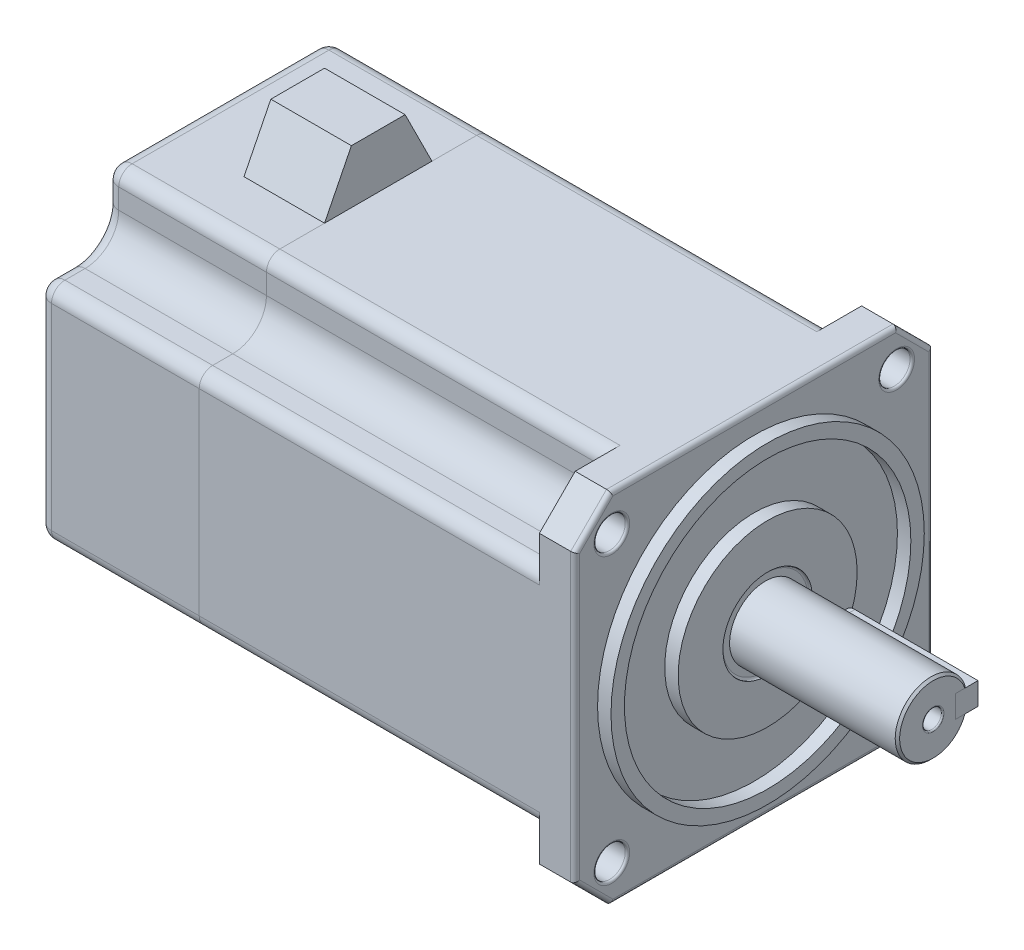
ISO-10303-21;
HEADER;
FILE_DESCRIPTION(('STEP AP214'),'2;1');
FILE_NAME('part.step','',(''),(''),'','','');
FILE_SCHEMA(('AUTOMOTIVE_DESIGN { 1 0 10303 214 1 1 1 1 }'));
ENDSEC;
DATA;
#1=APPLICATION_CONTEXT('core data for automotive mechanical design processes');
#2=APPLICATION_PROTOCOL_DEFINITION('international standard','automotive_design',2000,#1);
#3=PRODUCT_CONTEXT('',#1,'mechanical');
#4=PRODUCT('Part','Part','',(#3));
#5=PRODUCT_RELATED_PRODUCT_CATEGORY('part','',(#4));
#6=PRODUCT_DEFINITION_FORMATION('','',#4);
#7=PRODUCT_DEFINITION_CONTEXT('part definition',#1,'design');
#8=PRODUCT_DEFINITION('design','',#6,#7);
#9=PRODUCT_DEFINITION_SHAPE('','',#8);
#10=(LENGTH_UNIT() NAMED_UNIT(*) SI_UNIT(.MILLI.,.METRE.));
#11=(NAMED_UNIT(*) PLANE_ANGLE_UNIT() SI_UNIT($,.RADIAN.));
#12=(NAMED_UNIT(*) SI_UNIT($,.STERADIAN.) SOLID_ANGLE_UNIT());
#13=UNCERTAINTY_MEASURE_WITH_UNIT(LENGTH_MEASURE(1.E-05),#10,'distance_accuracy_value','');
#14=(GEOMETRIC_REPRESENTATION_CONTEXT(3) GLOBAL_UNCERTAINTY_ASSIGNED_CONTEXT((#13)) GLOBAL_UNIT_ASSIGNED_CONTEXT((#10,
#11,#12)) REPRESENTATION_CONTEXT('',''));
#15=CARTESIAN_POINT('',(0.,0.,0.));
#16=DIRECTION('',(0.,0.,1.));
#17=DIRECTION('',(1.,0.,0.));
#18=AXIS2_PLACEMENT_3D('',#15,#16,#17);
#19=CARTESIAN_POINT('',(12.5,0.,-10.));
#20=DIRECTION('',(0.,0.,1.));
#21=DIRECTION('',(1.,0.,0.));
#22=AXIS2_PLACEMENT_3D('',#19,#20,#21);
#23=CYLINDRICAL_SURFACE('',#22,2.5);
#24=CARTESIAN_POINT('',(12.5,0.,-5.));
#25=DIRECTION('',(0.,0.,-1.));
#26=DIRECTION('',(-1.,0.,0.));
#27=AXIS2_PLACEMENT_3D('',#24,#25,#26);
#28=CIRCLE('',#27,2.5);
#29=CARTESIAN_POINT('',(12.5,-2.5,-5.));
#30=VERTEX_POINT('',#29);
#31=CARTESIAN_POINT('',(12.5,2.5,-5.));
#32=VERTEX_POINT('',#31);
#33=EDGE_CURVE('E113',#30,#32,#28,.T.);
#34=ORIENTED_EDGE('',*,*,#33,.T.);
#35=DIRECTION('',(0.,0.,1.));
#36=VECTOR('',#35,1.);
#37=CARTESIAN_POINT('',(12.5,2.5,-10.));
#38=LINE('',#37,#36);
#39=CARTESIAN_POINT('',(12.5,2.5,-10.));
#40=VERTEX_POINT('',#39);
#41=EDGE_CURVE('E12',#40,#32,#38,.T.);
#42=ORIENTED_EDGE('',*,*,#41,.F.);
#43=CARTESIAN_POINT('',(12.5,0.,-10.));
#44=DIRECTION('',(0.,0.,-1.));
#45=DIRECTION('',(-1.,0.,0.));
#46=AXIS2_PLACEMENT_3D('',#43,#44,#45);
#47=CIRCLE('',#46,2.5);
#48=CARTESIAN_POINT('',(12.5,-2.5,-10.));
#49=VERTEX_POINT('',#48);
#50=EDGE_CURVE('E101',#49,#40,#47,.T.);
#51=ORIENTED_EDGE('',*,*,#50,.F.);
#52=DIRECTION('',(0.,0.,1.));
#53=VECTOR('',#52,1.);
#54=CARTESIAN_POINT('',(12.5,-2.5,-10.));
#55=LINE('',#54,#53);
#56=EDGE_CURVE('E109',#49,#30,#55,.T.);
#57=ORIENTED_EDGE('',*,*,#56,.T.);
#58=EDGE_LOOP('',(#34,#42,#51,#57));
#59=FACE_BOUND('',#58,.T.);
#60=ADVANCED_FACE('F50',(#59),#23,.T.);
#61=CARTESIAN_POINT('',(12.5,2.5,-10.));
#62=DIRECTION('',(0.,-1.,0.));
#63=DIRECTION('',(1.,0.,0.));
#64=AXIS2_PLACEMENT_3D('',#61,#62,#63);
#65=PLANE('',#64);
#66=DIRECTION('',(1.,0.,0.));
#67=VECTOR('',#66,1.);
#68=CARTESIAN_POINT('',(12.5,2.5,-5.));
#69=LINE('',#68,#67);
#70=CARTESIAN_POINT('',(40.,2.5,-5.));
#71=VERTEX_POINT('',#70);
#72=EDGE_CURVE('E105',#32,#71,#69,.T.);
#73=ORIENTED_EDGE('',*,*,#72,.T.);
#74=DIRECTION('',(0.,0.,1.));
#75=VECTOR('',#74,1.);
#76=CARTESIAN_POINT('',(40.,2.5,-10.));
#77=LINE('',#76,#75);
#78=CARTESIAN_POINT('',(40.,2.5,-10.));
#79=VERTEX_POINT('',#78);
#80=EDGE_CURVE('E58',#79,#71,#77,.T.);
#81=ORIENTED_EDGE('',*,*,#80,.F.);
#82=DIRECTION('',(1.,0.,0.));
#83=VECTOR('',#82,1.);
#84=CARTESIAN_POINT('',(12.5,2.5,-10.));
#85=LINE('',#84,#83);
#86=EDGE_CURVE('E96',#40,#79,#85,.T.);
#87=ORIENTED_EDGE('',*,*,#86,.F.);
#88=ORIENTED_EDGE('',*,*,#41,.T.);
#89=EDGE_LOOP('',(#73,#81,#87,#88));
#90=FACE_BOUND('',#89,.T.);
#91=ADVANCED_FACE('F104',(#90),#65,.F.);
#92=CARTESIAN_POINT('',(40.,2.5,-10.));
#93=DIRECTION('',(-1.,0.,0.));
#94=DIRECTION('',(0.,0.,1.));
#95=AXIS2_PLACEMENT_3D('',#92,#93,#94);
#96=PLANE('',#95);
#97=DIRECTION('',(0.,-1.,0.));
#98=VECTOR('',#97,1.);
#99=CARTESIAN_POINT('',(40.,2.5,-5.));
#100=LINE('',#99,#98);
#101=CARTESIAN_POINT('',(40.,-2.5,-5.));
#102=VERTEX_POINT('',#101);
#103=EDGE_CURVE('E83',#71,#102,#100,.T.);
#104=ORIENTED_EDGE('',*,*,#103,.T.);
#105=DIRECTION('',(0.,0.,1.));
#106=VECTOR('',#105,1.);
#107=CARTESIAN_POINT('',(40.,-2.5,-10.));
#108=LINE('',#107,#106);
#109=CARTESIAN_POINT('',(40.,-2.5,-10.));
#110=VERTEX_POINT('',#109);
#111=EDGE_CURVE('E106',#110,#102,#108,.T.);
#112=ORIENTED_EDGE('',*,*,#111,.F.);
#113=DIRECTION('',(0.,-1.,0.));
#114=VECTOR('',#113,1.);
#115=CARTESIAN_POINT('',(40.,2.5,-10.));
#116=LINE('',#115,#114);
#117=EDGE_CURVE('E99',#79,#110,#116,.T.);
#118=ORIENTED_EDGE('',*,*,#117,.F.);
#119=ORIENTED_EDGE('',*,*,#80,.T.);
#120=EDGE_LOOP('',(#104,#112,#118,#119));
#121=FACE_BOUND('',#120,.T.);
#122=ADVANCED_FACE('F107',(#121),#96,.F.);
#123=CARTESIAN_POINT('',(40.,-2.5,-10.));
#124=DIRECTION('',(0.,1.,0.));
#125=DIRECTION('',(-1.,0.,0.));
#126=AXIS2_PLACEMENT_3D('',#123,#124,#125);
#127=PLANE('',#126);
#128=DIRECTION('',(-1.,0.,0.));
#129=VECTOR('',#128,1.);
#130=CARTESIAN_POINT('',(40.,-2.5,-5.));
#131=LINE('',#130,#129);
#132=EDGE_CURVE('E89',#102,#30,#131,.T.);
#133=ORIENTED_EDGE('',*,*,#132,.T.);
#134=ORIENTED_EDGE('',*,*,#56,.F.);
#135=DIRECTION('',(-1.,0.,0.));
#136=VECTOR('',#135,1.);
#137=CARTESIAN_POINT('',(40.,-2.5,-10.));
#138=LINE('',#137,#136);
#139=EDGE_CURVE('E66',#110,#49,#138,.T.);
#140=ORIENTED_EDGE('',*,*,#139,.F.);
#141=ORIENTED_EDGE('',*,*,#111,.T.);
#142=EDGE_LOOP('',(#133,#134,#140,#141));
#143=FACE_BOUND('',#142,.T.);
#144=ADVANCED_FACE('F120',(#143),#127,.F.);
#145=CARTESIAN_POINT('',(12.5,0.,-10.));
#146=DIRECTION('',(0.,0.,-1.));
#147=DIRECTION('',(-1.,0.,0.));
#148=AXIS2_PLACEMENT_3D('',#145,#146,#147);
#149=PLANE('',#148);
#150=ORIENTED_EDGE('',*,*,#50,.T.);
#151=ORIENTED_EDGE('',*,*,#86,.T.);
#152=ORIENTED_EDGE('',*,*,#117,.T.);
#153=ORIENTED_EDGE('',*,*,#139,.T.);
#154=EDGE_LOOP('',(#150,#151,#152,#153));
#155=FACE_BOUND('',#154,.T.);
#156=ADVANCED_FACE('F97',(#155),#149,.T.);
#157=CARTESIAN_POINT('',(12.5,0.,-5.));
#158=DIRECTION('',(0.,0.,-1.));
#159=DIRECTION('',(-1.,0.,0.));
#160=AXIS2_PLACEMENT_3D('',#157,#158,#159);
#161=PLANE('',#160);
#162=ORIENTED_EDGE('',*,*,#33,.F.);
#163=ORIENTED_EDGE('',*,*,#132,.F.);
#164=ORIENTED_EDGE('',*,*,#103,.F.);
#165=ORIENTED_EDGE('',*,*,#72,.F.);
#166=EDGE_LOOP('',(#162,#163,#164,#165));
#167=FACE_BOUND('',#166,.T.);
#168=ADVANCED_FACE('F123',(#167),#161,.F.);
#169=CLOSED_SHELL('',(#60,#91,#122,#144,#156,#168));
#170=MANIFOLD_SOLID_BREP('B2',#169);
#171=CARTESIAN_POINT('',(-84.,52.,12.));
#172=DIRECTION('',(-1.,0.,0.));
#173=DIRECTION('',(0.,0.,1.));
#174=AXIS2_PLACEMENT_3D('',#171,#172,#173);
#175=PLANE('',#174);
#176=DIRECTION('',(0.,0.,-1.));
#177=VECTOR('',#176,1.);
#178=CARTESIAN_POINT('',(-84.,52.,12.));
#179=LINE('',#178,#177);
#180=CARTESIAN_POINT('',(-84.,52.,6.00000000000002));
#181=VERTEX_POINT('',#180);
#182=CARTESIAN_POINT('',(-84.,52.,-5.99999999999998));
#183=VERTEX_POINT('',#182);
#184=EDGE_CURVE('E192',#181,#183,#179,.T.);
#185=ORIENTED_EDGE('',*,*,#184,.F.);
#186=DIRECTION('',(0.,0.894427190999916,-0.447213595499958));
#187=VECTOR('',#186,1.);
#188=CARTESIAN_POINT('',(-84.,52.,6.00000000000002));
#189=LINE('',#188,#187);
#190=CARTESIAN_POINT('',(-84.,40.,12.));
#191=VERTEX_POINT('',#190);
#192=EDGE_CURVE('E224',#191,#181,#189,.T.);
#193=ORIENTED_EDGE('',*,*,#192,.F.);
#194=DIRECTION('',(0.,0.,-1.));
#195=VECTOR('',#194,1.);
#196=CARTESIAN_POINT('',(-84.,40.,12.));
#197=LINE('',#196,#195);
#198=CARTESIAN_POINT('',(-84.,40.,-12.));
#199=VERTEX_POINT('',#198);
#200=EDGE_CURVE('E240',#191,#199,#197,.T.);
#201=ORIENTED_EDGE('',*,*,#200,.T.);
#202=DIRECTION('',(0.,-0.894427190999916,-0.447213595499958));
#203=VECTOR('',#202,1.);
#204=CARTESIAN_POINT('',(-84.,52.,-5.99999999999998));
#205=LINE('',#204,#203);
#206=EDGE_CURVE('E208',#183,#199,#205,.T.);
#207=ORIENTED_EDGE('',*,*,#206,.F.);
#208=EDGE_LOOP('',(#185,#193,#201,#207));
#209=FACE_BOUND('',#208,.T.);
#210=ADVANCED_FACE('F184',(#209),#175,.F.);
#211=CARTESIAN_POINT('',(-102.,52.,12.));
#212=DIRECTION('',(1.,0.,0.));
#213=DIRECTION('',(0.,0.,-1.));
#214=AXIS2_PLACEMENT_3D('',#211,#212,#213);
#215=PLANE('',#214);
#216=DIRECTION('',(0.,0.,1.));
#217=VECTOR('',#216,1.);
#218=CARTESIAN_POINT('',(-102.,40.,12.));
#219=LINE('',#218,#217);
#220=CARTESIAN_POINT('',(-102.,40.,-12.));
#221=VERTEX_POINT('',#220);
#222=CARTESIAN_POINT('',(-102.,40.,12.));
#223=VERTEX_POINT('',#222);
#224=EDGE_CURVE('E243',#221,#223,#219,.T.);
#225=ORIENTED_EDGE('',*,*,#224,.T.);
#226=DIRECTION('',(0.,0.894427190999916,-0.447213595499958));
#227=VECTOR('',#226,1.);
#228=CARTESIAN_POINT('',(-102.,52.,6.00000000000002));
#229=LINE('',#228,#227);
#230=CARTESIAN_POINT('',(-102.,52.,6.00000000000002));
#231=VERTEX_POINT('',#230);
#232=EDGE_CURVE('E200',#223,#231,#229,.T.);
#233=ORIENTED_EDGE('',*,*,#232,.T.);
#234=DIRECTION('',(0.,0.,1.));
#235=VECTOR('',#234,1.);
#236=CARTESIAN_POINT('',(-102.,52.,12.));
#237=LINE('',#236,#235);
#238=CARTESIAN_POINT('',(-102.,52.,-5.99999999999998));
#239=VERTEX_POINT('',#238);
#240=EDGE_CURVE('E48',#239,#231,#237,.T.);
#241=ORIENTED_EDGE('',*,*,#240,.F.);
#242=DIRECTION('',(0.,-0.894427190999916,-0.447213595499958));
#243=VECTOR('',#242,1.);
#244=CARTESIAN_POINT('',(-102.,52.,-5.99999999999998));
#245=LINE('',#244,#243);
#246=EDGE_CURVE('E253',#239,#221,#245,.T.);
#247=ORIENTED_EDGE('',*,*,#246,.T.);
#248=EDGE_LOOP('',(#225,#233,#241,#247));
#249=FACE_BOUND('',#248,.T.);
#250=ADVANCED_FACE('F252',(#249),#215,.F.);
#251=CARTESIAN_POINT('',(0.,52.,0.));
#252=DIRECTION('',(0.,-1.,0.));
#253=DIRECTION('',(0.,0.,-1.));
#254=AXIS2_PLACEMENT_3D('',#251,#252,#253);
#255=PLANE('',#254);
#256=ORIENTED_EDGE('',*,*,#240,.T.);
#257=DIRECTION('',(1.,0.,0.));
#258=VECTOR('',#257,1.);
#259=CARTESIAN_POINT('',(-102.,52.,6.00000000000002));
#260=LINE('',#259,#258);
#261=EDGE_CURVE('E227',#231,#181,#260,.T.);
#262=ORIENTED_EDGE('',*,*,#261,.T.);
#263=ORIENTED_EDGE('',*,*,#184,.T.);
#264=DIRECTION('',(1.,0.,0.));
#265=VECTOR('',#264,1.);
#266=CARTESIAN_POINT('',(-102.,52.,-5.99999999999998));
#267=LINE('',#266,#265);
#268=EDGE_CURVE('E233',#239,#183,#267,.T.);
#269=ORIENTED_EDGE('',*,*,#268,.F.);
#270=EDGE_LOOP('',(#256,#262,#263,#269));
#271=FACE_BOUND('',#270,.T.);
#272=ADVANCED_FACE('F237',(#271),#255,.F.);
#273=CARTESIAN_POINT('',(0.,40.,0.));
#274=DIRECTION('',(0.,-1.,0.));
#275=DIRECTION('',(0.,0.,-1.));
#276=AXIS2_PLACEMENT_3D('',#273,#274,#275);
#277=PLANE('',#276);
#278=ORIENTED_EDGE('',*,*,#200,.F.);
#279=DIRECTION('',(1.,0.,0.));
#280=VECTOR('',#279,1.);
#281=CARTESIAN_POINT('',(-102.,40.,12.));
#282=LINE('',#281,#280);
#283=EDGE_CURVE('E187',#223,#191,#282,.T.);
#284=ORIENTED_EDGE('',*,*,#283,.F.);
#285=ORIENTED_EDGE('',*,*,#224,.F.);
#286=DIRECTION('',(-1.,0.,0.));
#287=VECTOR('',#286,1.);
#288=CARTESIAN_POINT('',(-102.,40.,-12.));
#289=LINE('',#288,#287);
#290=EDGE_CURVE('E248',#199,#221,#289,.T.);
#291=ORIENTED_EDGE('',*,*,#290,.F.);
#292=EDGE_LOOP('',(#278,#284,#285,#291));
#293=FACE_BOUND('',#292,.T.);
#294=ADVANCED_FACE('F255',(#293),#277,.T.);
#295=CARTESIAN_POINT('',(-102.,52.,-5.99999999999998));
#296=DIRECTION('',(0.,-0.447213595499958,0.894427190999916));
#297=DIRECTION('',(0.,-0.894427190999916,-0.447213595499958));
#298=AXIS2_PLACEMENT_3D('',#295,#296,#297);
#299=PLANE('',#298);
#300=ORIENTED_EDGE('',*,*,#206,.T.);
#301=ORIENTED_EDGE('',*,*,#290,.T.);
#302=ORIENTED_EDGE('',*,*,#246,.F.);
#303=ORIENTED_EDGE('',*,*,#268,.T.);
#304=EDGE_LOOP('',(#300,#301,#302,#303));
#305=FACE_BOUND('',#304,.T.);
#306=ADVANCED_FACE('F256',(#305),#299,.F.);
#307=CARTESIAN_POINT('',(-102.,52.,6.00000000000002));
#308=DIRECTION('',(0.,-0.447213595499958,-0.894427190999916));
#309=DIRECTION('',(0.,0.894427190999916,-0.447213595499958));
#310=AXIS2_PLACEMENT_3D('',#307,#308,#309);
#311=PLANE('',#310);
#312=ORIENTED_EDGE('',*,*,#192,.T.);
#313=ORIENTED_EDGE('',*,*,#261,.F.);
#314=ORIENTED_EDGE('',*,*,#232,.F.);
#315=ORIENTED_EDGE('',*,*,#283,.T.);
#316=EDGE_LOOP('',(#312,#313,#314,#315));
#317=FACE_BOUND('',#316,.T.);
#318=ADVANCED_FACE('F226',(#317),#311,.F.);
#319=CLOSED_SHELL('',(#210,#250,#272,#294,#306,#318));
#320=MANIFOLD_SOLID_BREP('B6',#319);
#321=CARTESIAN_POINT('',(-120.,-32.,-40.));
#322=DIRECTION('',(0.,0.,1.));
#323=DIRECTION('',(1.,0.,0.));
#324=AXIS2_PLACEMENT_3D('',#321,#322,#323);
#325=PLANE('',#324);
#326=DIRECTION('',(-1.,0.,0.));
#327=VECTOR('',#326,1.);
#328=CARTESIAN_POINT('',(-7.99999999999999,-21.9833518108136,-40.));
#329=LINE('',#328,#327);
#330=CARTESIAN_POINT('',(-84.,-21.9833518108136,-40.));
#331=VERTEX_POINT('',#330);
#332=CARTESIAN_POINT('',(-117.,-21.9833518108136,-40.));
#333=VERTEX_POINT('',#332);
#334=EDGE_CURVE('E795',#331,#333,#329,.T.);
#335=ORIENTED_EDGE('',*,*,#334,.T.);
#336=DIRECTION('',(0.,-1.,0.));
#337=VECTOR('',#336,1.);
#338=CARTESIAN_POINT('',(-117.,21.983351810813,-40.));
#339=LINE('',#338,#337);
#340=CARTESIAN_POINT('',(-117.,21.983351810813,-40.));
#341=VERTEX_POINT('',#340);
#342=EDGE_CURVE('E326',#333,#341,#339,.F.);
#343=ORIENTED_EDGE('',*,*,#342,.T.);
#344=DIRECTION('',(-1.,0.,0.));
#345=VECTOR('',#344,1.);
#346=CARTESIAN_POINT('',(-7.99999999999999,21.983351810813,-40.));
#347=LINE('',#346,#345);
#348=CARTESIAN_POINT('',(-84.,21.983351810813,-40.));
#349=VERTEX_POINT('',#348);
#350=EDGE_CURVE('E839',#349,#341,#347,.T.);
#351=ORIENTED_EDGE('',*,*,#350,.F.);
#352=DIRECTION('',(0.,-1.,0.));
#353=VECTOR('',#352,1.);
#354=CARTESIAN_POINT('',(-84.,-32.,-40.));
#355=LINE('',#354,#353);
#356=EDGE_CURVE('E835',#349,#331,#355,.T.);
#357=ORIENTED_EDGE('',*,*,#356,.T.);
#358=EDGE_LOOP('',(#335,#343,#351,#357));
#359=FACE_BOUND('',#358,.T.);
#360=ADVANCED_FACE('F317',(#359),#325,.F.);
#361=CARTESIAN_POINT('',(-120.,-40.,-32.));
#362=DIRECTION('',(0.,1.,0.));
#363=DIRECTION('',(0.,0.,1.));
#364=AXIS2_PLACEMENT_3D('',#361,#362,#363);
#365=PLANE('',#364);
#366=DIRECTION('',(-1.,0.,0.));
#367=VECTOR('',#366,1.);
#368=CARTESIAN_POINT('',(-7.99999999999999,-40.,21.983351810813));
#369=LINE('',#368,#367);
#370=CARTESIAN_POINT('',(-84.,-40.,21.983351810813));
#371=VERTEX_POINT('',#370);
#372=CARTESIAN_POINT('',(-117.,-40.,21.983351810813));
#373=VERTEX_POINT('',#372);
#374=EDGE_CURVE('E789',#371,#373,#369,.T.);
#375=ORIENTED_EDGE('',*,*,#374,.T.);
#376=DIRECTION('',(0.,0.,1.));
#377=VECTOR('',#376,1.);
#378=CARTESIAN_POINT('',(-117.,-40.,-21.9833518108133));
#379=LINE('',#378,#377);
#380=CARTESIAN_POINT('',(-117.,-40.,-21.9833518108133));
#381=VERTEX_POINT('',#380);
#382=EDGE_CURVE('E671',#373,#381,#379,.F.);
#383=ORIENTED_EDGE('',*,*,#382,.T.);
#384=DIRECTION('',(-1.,0.,0.));
#385=VECTOR('',#384,1.);
#386=CARTESIAN_POINT('',(-7.99999999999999,-40.,-21.9833518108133));
#387=LINE('',#386,#385);
#388=CARTESIAN_POINT('',(-84.,-40.,-21.9833518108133));
#389=VERTEX_POINT('',#388);
#390=EDGE_CURVE('E787',#389,#381,#387,.T.);
#391=ORIENTED_EDGE('',*,*,#390,.F.);
#392=DIRECTION('',(0.,0.,1.));
#393=VECTOR('',#392,1.);
#394=CARTESIAN_POINT('',(-84.,-40.,-32.));
#395=LINE('',#394,#393);
#396=EDGE_CURVE('E838',#389,#371,#395,.T.);
#397=ORIENTED_EDGE('',*,*,#396,.T.);
#398=EDGE_LOOP('',(#375,#383,#391,#397));
#399=FACE_BOUND('',#398,.T.);
#400=ADVANCED_FACE('F785',(#399),#365,.F.);
#401=CARTESIAN_POINT('',(-120.,-32.,40.));
#402=DIRECTION('',(0.,0.,-1.));
#403=DIRECTION('',(-1.,0.,0.));
#404=AXIS2_PLACEMENT_3D('',#401,#402,#403);
#405=PLANE('',#404);
#406=DIRECTION('',(-1.,0.,0.));
#407=VECTOR('',#406,1.);
#408=CARTESIAN_POINT('',(-7.99999999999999,21.9833518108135,40.));
#409=LINE('',#408,#407);
#410=CARTESIAN_POINT('',(-84.,21.9833518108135,40.));
#411=VERTEX_POINT('',#410);
#412=CARTESIAN_POINT('',(-117.,21.9833518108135,40.));
#413=VERTEX_POINT('',#412);
#414=EDGE_CURVE('E831',#411,#413,#409,.T.);
#415=ORIENTED_EDGE('',*,*,#414,.T.);
#416=DIRECTION('',(0.,1.,0.));
#417=VECTOR('',#416,1.);
#418=CARTESIAN_POINT('',(-117.,-21.9833518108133,40.));
#419=LINE('',#418,#417);
#420=CARTESIAN_POINT('',(-117.,-21.9833518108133,40.));
#421=VERTEX_POINT('',#420);
#422=EDGE_CURVE('E659',#413,#421,#419,.F.);
#423=ORIENTED_EDGE('',*,*,#422,.T.);
#424=DIRECTION('',(-1.,0.,0.));
#425=VECTOR('',#424,1.);
#426=CARTESIAN_POINT('',(-7.99999999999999,-21.9833518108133,40.));
#427=LINE('',#426,#425);
#428=CARTESIAN_POINT('',(-84.,-21.9833518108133,40.));
#429=VERTEX_POINT('',#428);
#430=EDGE_CURVE('E813',#429,#421,#427,.T.);
#431=ORIENTED_EDGE('',*,*,#430,.F.);
#432=DIRECTION('',(0.,1.,0.));
#433=VECTOR('',#432,1.);
#434=CARTESIAN_POINT('',(-84.,-32.,40.));
#435=LINE('',#434,#433);
#436=EDGE_CURVE('E841',#429,#411,#435,.T.);
#437=ORIENTED_EDGE('',*,*,#436,.T.);
#438=EDGE_LOOP('',(#415,#423,#431,#437));
#439=FACE_BOUND('',#438,.T.);
#440=ADVANCED_FACE('F923',(#439),#405,.F.);
#441=CARTESIAN_POINT('',(-120.,40.,-32.));
#442=DIRECTION('',(0.,-1.,0.));
#443=DIRECTION('',(0.,0.,-1.));
#444=AXIS2_PLACEMENT_3D('',#441,#442,#443);
#445=PLANE('',#444);
#446=DIRECTION('',(0.,0.,-1.));
#447=VECTOR('',#446,1.);
#448=CARTESIAN_POINT('',(-84.,40.,-32.));
#449=LINE('',#448,#447);
#450=CARTESIAN_POINT('',(-84.,40.,21.9833518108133));
#451=VERTEX_POINT('',#450);
#452=CARTESIAN_POINT('',(-84.,40.,-21.9833518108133));
#453=VERTEX_POINT('',#452);
#454=EDGE_CURVE('E540',#451,#453,#449,.T.);
#455=ORIENTED_EDGE('',*,*,#454,.T.);
#456=DIRECTION('',(-1.,0.,0.));
#457=VECTOR('',#456,1.);
#458=CARTESIAN_POINT('',(-7.99999999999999,40.,-21.9833518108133));
#459=LINE('',#458,#457);
#460=CARTESIAN_POINT('',(-117.,40.,-21.9833518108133));
#461=VERTEX_POINT('',#460);
#462=EDGE_CURVE('E850',#453,#461,#459,.T.);
#463=ORIENTED_EDGE('',*,*,#462,.T.);
#464=DIRECTION('',(0.,0.,-1.));
#465=VECTOR('',#464,1.);
#466=CARTESIAN_POINT('',(-117.,40.,21.9833518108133));
#467=LINE('',#466,#465);
#468=CARTESIAN_POINT('',(-117.,40.,21.9833518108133));
#469=VERTEX_POINT('',#468);
#470=EDGE_CURVE('E648',#461,#469,#467,.F.);
#471=ORIENTED_EDGE('',*,*,#470,.T.);
#472=DIRECTION('',(-1.,0.,0.));
#473=VECTOR('',#472,1.);
#474=CARTESIAN_POINT('',(-7.99999999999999,40.,21.9833518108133));
#475=LINE('',#474,#473);
#476=EDGE_CURVE('E828',#451,#469,#475,.T.);
#477=ORIENTED_EDGE('',*,*,#476,.F.);
#478=EDGE_LOOP('',(#455,#463,#471,#477));
#479=FACE_BOUND('',#478,.T.);
#480=ADVANCED_FACE('F849',(#479),#445,.F.);
#481=CARTESIAN_POINT('',(-120.,0.,0.));
#482=DIRECTION('',(-1.,0.,0.));
#483=DIRECTION('',(0.,0.,1.));
#484=AXIS2_PLACEMENT_3D('',#481,#482,#483);
#485=PLANE('',#484);
#486=CARTESIAN_POINT('',(-120.,32.5,-32.4999999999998));
#487=DIRECTION('',(-1.,0.,0.));
#488=DIRECTION('',(0.,0.,1.));
#489=AXIS2_PLACEMENT_3D('',#486,#487,#488);
#490=CIRCLE('',#489,10.5166481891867);
#491=CARTESIAN_POINT('',(-120.,32.5,-21.9833518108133));
#492=VERTEX_POINT('',#491);
#493=CARTESIAN_POINT('',(-120.,21.9833518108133,-32.4999999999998));
#494=VERTEX_POINT('',#493);
#495=EDGE_CURVE('E637',#492,#494,#490,.F.);
#496=ORIENTED_EDGE('',*,*,#495,.T.);
#497=DIRECTION('',(0.,0.,1.));
#498=VECTOR('',#497,1.);
#499=CARTESIAN_POINT('',(-120.,21.9833518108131,-37.));
#500=LINE('',#499,#498);
#501=CARTESIAN_POINT('',(-120.,21.983351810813,-37.));
#502=VERTEX_POINT('',#501);
#503=EDGE_CURVE('E639',#494,#502,#500,.F.);
#504=ORIENTED_EDGE('',*,*,#503,.T.);
#505=DIRECTION('',(0.,-1.,0.));
#506=VECTOR('',#505,1.);
#507=CARTESIAN_POINT('',(-120.,-21.9833518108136,-37.));
#508=LINE('',#507,#506);
#509=CARTESIAN_POINT('',(-120.,-21.9833518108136,-37.));
#510=VERTEX_POINT('',#509);
#511=EDGE_CURVE('E609',#502,#510,#508,.T.);
#512=ORIENTED_EDGE('',*,*,#511,.T.);
#513=DIRECTION('',(0.,0.,-1.));
#514=VECTOR('',#513,1.);
#515=CARTESIAN_POINT('',(-120.,-21.9833518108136,-32.4999999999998));
#516=LINE('',#515,#514);
#517=CARTESIAN_POINT('',(-120.,-21.9833518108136,-32.4999999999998));
#518=VERTEX_POINT('',#517);
#519=EDGE_CURVE('E611',#510,#518,#516,.F.);
#520=ORIENTED_EDGE('',*,*,#519,.T.);
#521=CARTESIAN_POINT('',(-120.,-32.5,-32.4999999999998));
#522=DIRECTION('',(-1.,0.,0.));
#523=DIRECTION('',(0.,0.,1.));
#524=AXIS2_PLACEMENT_3D('',#521,#522,#523);
#525=CIRCLE('',#524,10.5166481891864);
#526=CARTESIAN_POINT('',(-120.,-32.5,-21.9833518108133));
#527=VERTEX_POINT('',#526);
#528=EDGE_CURVE('E613',#518,#527,#525,.F.);
#529=ORIENTED_EDGE('',*,*,#528,.T.);
#530=DIRECTION('',(0.,1.,0.));
#531=VECTOR('',#530,1.);
#532=CARTESIAN_POINT('',(-120.,-37.,-21.9833518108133));
#533=LINE('',#532,#531);
#534=CARTESIAN_POINT('',(-120.,-37.,-21.9833518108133));
#535=VERTEX_POINT('',#534);
#536=EDGE_CURVE('E615',#527,#535,#533,.F.);
#537=ORIENTED_EDGE('',*,*,#536,.T.);
#538=DIRECTION('',(0.,0.,1.));
#539=VECTOR('',#538,1.);
#540=CARTESIAN_POINT('',(-120.,-37.,21.983351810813));
#541=LINE('',#540,#539);
#542=CARTESIAN_POINT('',(-120.,-37.,21.983351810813));
#543=VERTEX_POINT('',#542);
#544=EDGE_CURVE('E617',#535,#543,#541,.T.);
#545=ORIENTED_EDGE('',*,*,#544,.T.);
#546=DIRECTION('',(0.,-1.,0.));
#547=VECTOR('',#546,1.);
#548=CARTESIAN_POINT('',(-120.,-32.5,21.983351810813));
#549=LINE('',#548,#547);
#550=CARTESIAN_POINT('',(-120.,-32.5,21.983351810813));
#551=VERTEX_POINT('',#550);
#552=EDGE_CURVE('E619',#543,#551,#549,.F.);
#553=ORIENTED_EDGE('',*,*,#552,.T.);
#554=CARTESIAN_POINT('',(-120.,-32.5,32.4999999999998));
#555=DIRECTION('',(-1.,0.,0.));
#556=DIRECTION('',(0.,0.,1.));
#557=AXIS2_PLACEMENT_3D('',#554,#555,#556);
#558=CIRCLE('',#557,10.5166481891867);
#559=CARTESIAN_POINT('',(-120.,-21.9833518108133,32.4999999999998));
#560=VERTEX_POINT('',#559);
#561=EDGE_CURVE('E621',#551,#560,#558,.F.);
#562=ORIENTED_EDGE('',*,*,#561,.T.);
#563=DIRECTION('',(0.,0.,-1.));
#564=VECTOR('',#563,1.);
#565=CARTESIAN_POINT('',(-120.,-21.9833518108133,37.));
#566=LINE('',#565,#564);
#567=CARTESIAN_POINT('',(-120.,-21.9833518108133,37.));
#568=VERTEX_POINT('',#567);
#569=EDGE_CURVE('E623',#560,#568,#566,.F.);
#570=ORIENTED_EDGE('',*,*,#569,.T.);
#571=DIRECTION('',(0.,1.,0.));
#572=VECTOR('',#571,1.);
#573=CARTESIAN_POINT('',(-120.,21.9833518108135,37.));
#574=LINE('',#573,#572);
#575=CARTESIAN_POINT('',(-120.,21.9833518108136,37.));
#576=VERTEX_POINT('',#575);
#577=EDGE_CURVE('E625',#568,#576,#574,.T.);
#578=ORIENTED_EDGE('',*,*,#577,.T.);
#579=DIRECTION('',(0.,0.,1.));
#580=VECTOR('',#579,1.);
#581=CARTESIAN_POINT('',(-120.,21.9833518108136,32.4999999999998));
#582=LINE('',#581,#580);
#583=CARTESIAN_POINT('',(-120.,21.9833518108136,32.4999999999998));
#584=VERTEX_POINT('',#583);
#585=EDGE_CURVE('E627',#576,#584,#582,.F.);
#586=ORIENTED_EDGE('',*,*,#585,.T.);
#587=CARTESIAN_POINT('',(-120.,32.5,32.4999999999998));
#588=DIRECTION('',(-1.,0.,0.));
#589=DIRECTION('',(0.,0.,1.));
#590=AXIS2_PLACEMENT_3D('',#587,#588,#589);
#591=CIRCLE('',#590,10.5166481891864);
#592=CARTESIAN_POINT('',(-120.,32.5,21.9833518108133));
#593=VERTEX_POINT('',#592);
#594=EDGE_CURVE('E629',#584,#593,#591,.F.);
#595=ORIENTED_EDGE('',*,*,#594,.T.);
#596=DIRECTION('',(0.,-1.,0.));
#597=VECTOR('',#596,1.);
#598=CARTESIAN_POINT('',(-120.,37.,21.9833518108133));
#599=LINE('',#598,#597);
#600=CARTESIAN_POINT('',(-120.,37.,21.9833518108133));
#601=VERTEX_POINT('',#600);
#602=EDGE_CURVE('E631',#593,#601,#599,.F.);
#603=ORIENTED_EDGE('',*,*,#602,.T.);
#604=DIRECTION('',(0.,0.,-1.));
#605=VECTOR('',#604,1.);
#606=CARTESIAN_POINT('',(-120.,37.,-21.9833518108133));
#607=LINE('',#606,#605);
#608=CARTESIAN_POINT('',(-120.,37.,-21.9833518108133));
#609=VERTEX_POINT('',#608);
#610=EDGE_CURVE('E633',#601,#609,#607,.T.);
#611=ORIENTED_EDGE('',*,*,#610,.T.);
#612=DIRECTION('',(0.,1.,0.));
#613=VECTOR('',#612,1.);
#614=CARTESIAN_POINT('',(-120.,32.5,-21.9833518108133));
#615=LINE('',#614,#613);
#616=EDGE_CURVE('E635',#609,#492,#615,.F.);
#617=ORIENTED_EDGE('',*,*,#616,.T.);
#618=EDGE_LOOP('',(#496,#504,#512,#520,#529,#537,#545,#553,#562,#570,#578,#586,#595,#603,#611,#617));
#619=FACE_BOUND('',#618,.T.);
#620=ADVANCED_FACE('F763',(#619),#485,.T.);
#621=CARTESIAN_POINT('',(-84.,0.,0.));
#622=DIRECTION('',(-1.,0.,0.));
#623=DIRECTION('',(0.,0.,1.));
#624=AXIS2_PLACEMENT_3D('',#621,#622,#623);
#625=PLANE('',#624);
#626=ORIENTED_EDGE('',*,*,#356,.F.);
#627=CARTESIAN_POINT('',(-84.,21.9833518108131,-37.));
#628=DIRECTION('',(-1.,0.,0.));
#629=DIRECTION('',(0.,0.,1.));
#630=AXIS2_PLACEMENT_3D('',#627,#628,#629);
#631=CIRCLE('',#630,3.);
#632=CARTESIAN_POINT('',(-84.,24.9833518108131,-37.));
#633=VERTEX_POINT('',#632);
#634=EDGE_CURVE('E603',#349,#633,#631,.F.);
#635=ORIENTED_EDGE('',*,*,#634,.T.);
#636=DIRECTION('',(0.,0.,1.));
#637=VECTOR('',#636,1.);
#638=CARTESIAN_POINT('',(-84.,24.9833518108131,0.));
#639=LINE('',#638,#637);
#640=CARTESIAN_POINT('',(-84.,24.9833518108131,-32.4999999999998));
#641=VERTEX_POINT('',#640);
#642=EDGE_CURVE('E591',#633,#641,#639,.T.);
#643=ORIENTED_EDGE('',*,*,#642,.T.);
#644=CARTESIAN_POINT('',(-84.,32.5,-32.4999999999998));
#645=DIRECTION('',(-1.,0.,0.));
#646=DIRECTION('',(0.,0.,1.));
#647=AXIS2_PLACEMENT_3D('',#644,#645,#646);
#648=CIRCLE('',#647,7.51664818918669);
#649=CARTESIAN_POINT('',(-84.,32.5,-24.9833518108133));
#650=VERTEX_POINT('',#649);
#651=EDGE_CURVE('E594',#641,#650,#648,.T.);
#652=ORIENTED_EDGE('',*,*,#651,.T.);
#653=DIRECTION('',(0.,1.,0.));
#654=VECTOR('',#653,1.);
#655=CARTESIAN_POINT('',(-84.,0.,-24.9833518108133));
#656=LINE('',#655,#654);
#657=CARTESIAN_POINT('',(-84.,37.,-24.9833518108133));
#658=VERTEX_POINT('',#657);
#659=EDGE_CURVE('E597',#650,#658,#656,.T.);
#660=ORIENTED_EDGE('',*,*,#659,.T.);
#661=CARTESIAN_POINT('',(-84.,37.,-21.9833518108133));
#662=DIRECTION('',(-1.,0.,0.));
#663=DIRECTION('',(0.,0.,1.));
#664=AXIS2_PLACEMENT_3D('',#661,#662,#663);
#665=CIRCLE('',#664,3.);
#666=EDGE_CURVE('E600',#658,#453,#665,.F.);
#667=ORIENTED_EDGE('',*,*,#666,.T.);
#668=ORIENTED_EDGE('',*,*,#454,.F.);
#669=CARTESIAN_POINT('',(-84.,37.,21.9833518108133));
#670=DIRECTION('',(-1.,0.,0.));
#671=DIRECTION('',(0.,0.,1.));
#672=AXIS2_PLACEMENT_3D('',#669,#670,#671);
#673=CIRCLE('',#672,3.);
#674=CARTESIAN_POINT('',(-84.,37.,24.9833518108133));
#675=VERTEX_POINT('',#674);
#676=EDGE_CURVE('E556',#451,#675,#673,.F.);
#677=ORIENTED_EDGE('',*,*,#676,.T.);
#678=DIRECTION('',(0.,-1.,0.));
#679=VECTOR('',#678,1.);
#680=CARTESIAN_POINT('',(-84.,0.,24.9833518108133));
#681=LINE('',#680,#679);
#682=CARTESIAN_POINT('',(-84.,32.5,24.9833518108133));
#683=VERTEX_POINT('',#682);
#684=EDGE_CURVE('E554',#675,#683,#681,.T.);
#685=ORIENTED_EDGE('',*,*,#684,.T.);
#686=CARTESIAN_POINT('',(-84.,32.5,32.4999999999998));
#687=DIRECTION('',(-1.,0.,0.));
#688=DIRECTION('',(0.,0.,1.));
#689=AXIS2_PLACEMENT_3D('',#686,#687,#688);
#690=CIRCLE('',#689,7.51664818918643);
#691=CARTESIAN_POINT('',(-84.,24.9833518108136,32.4999999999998));
#692=VERTEX_POINT('',#691);
#693=EDGE_CURVE('E545',#683,#692,#690,.T.);
#694=ORIENTED_EDGE('',*,*,#693,.T.);
#695=DIRECTION('',(0.,0.,1.));
#696=VECTOR('',#695,1.);
#697=CARTESIAN_POINT('',(-84.,24.9833518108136,0.));
#698=LINE('',#697,#696);
#699=CARTESIAN_POINT('',(-84.,24.9833518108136,37.));
#700=VERTEX_POINT('',#699);
#701=EDGE_CURVE('E528',#692,#700,#698,.T.);
#702=ORIENTED_EDGE('',*,*,#701,.T.);
#703=CARTESIAN_POINT('',(-84.,21.9833518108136,37.));
#704=DIRECTION('',(-1.,0.,0.));
#705=DIRECTION('',(0.,0.,1.));
#706=AXIS2_PLACEMENT_3D('',#703,#704,#705);
#707=CIRCLE('',#706,3.);
#708=EDGE_CURVE('E539',#700,#411,#707,.F.);
#709=ORIENTED_EDGE('',*,*,#708,.T.);
#710=ORIENTED_EDGE('',*,*,#436,.F.);
#711=CARTESIAN_POINT('',(-84.,-21.9833518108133,37.));
#712=DIRECTION('',(-1.,0.,0.));
#713=DIRECTION('',(0.,0.,1.));
#714=AXIS2_PLACEMENT_3D('',#711,#712,#713);
#715=CIRCLE('',#714,3.);
#716=CARTESIAN_POINT('',(-84.,-24.9833518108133,37.));
#717=VERTEX_POINT('',#716);
#718=EDGE_CURVE('E573',#429,#717,#715,.F.);
#719=ORIENTED_EDGE('',*,*,#718,.T.);
#720=DIRECTION('',(0.,0.,-1.));
#721=VECTOR('',#720,1.);
#722=CARTESIAN_POINT('',(-84.,-24.9833518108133,0.));
#723=LINE('',#722,#721);
#724=CARTESIAN_POINT('',(-84.,-24.9833518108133,32.4999999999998));
#725=VERTEX_POINT('',#724);
#726=EDGE_CURVE('E570',#717,#725,#723,.T.);
#727=ORIENTED_EDGE('',*,*,#726,.T.);
#728=CARTESIAN_POINT('',(-84.,-32.5,32.4999999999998));
#729=DIRECTION('',(-1.,0.,0.));
#730=DIRECTION('',(0.,0.,1.));
#731=AXIS2_PLACEMENT_3D('',#728,#729,#730);
#732=CIRCLE('',#731,7.51664818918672);
#733=CARTESIAN_POINT('',(-84.,-32.5,24.983351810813));
#734=VERTEX_POINT('',#733);
#735=EDGE_CURVE('E567',#725,#734,#732,.T.);
#736=ORIENTED_EDGE('',*,*,#735,.T.);
#737=DIRECTION('',(0.,-1.,0.));
#738=VECTOR('',#737,1.);
#739=CARTESIAN_POINT('',(-84.,0.,24.983351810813));
#740=LINE('',#739,#738);
#741=CARTESIAN_POINT('',(-84.,-37.,24.983351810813));
#742=VERTEX_POINT('',#741);
#743=EDGE_CURVE('E561',#734,#742,#740,.T.);
#744=ORIENTED_EDGE('',*,*,#743,.T.);
#745=CARTESIAN_POINT('',(-84.,-37.,21.983351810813));
#746=DIRECTION('',(-1.,0.,0.));
#747=DIRECTION('',(0.,0.,1.));
#748=AXIS2_PLACEMENT_3D('',#745,#746,#747);
#749=CIRCLE('',#748,3.);
#750=EDGE_CURVE('E564',#742,#371,#749,.F.);
#751=ORIENTED_EDGE('',*,*,#750,.T.);
#752=ORIENTED_EDGE('',*,*,#396,.F.);
#753=CARTESIAN_POINT('',(-84.,-37.,-21.9833518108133));
#754=DIRECTION('',(-1.,0.,0.));
#755=DIRECTION('',(0.,0.,1.));
#756=AXIS2_PLACEMENT_3D('',#753,#754,#755);
#757=CIRCLE('',#756,3.);
#758=CARTESIAN_POINT('',(-84.,-37.,-24.9833518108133));
#759=VERTEX_POINT('',#758);
#760=EDGE_CURVE('E588',#389,#759,#757,.F.);
#761=ORIENTED_EDGE('',*,*,#760,.T.);
#762=DIRECTION('',(0.,1.,0.));
#763=VECTOR('',#762,1.);
#764=CARTESIAN_POINT('',(-84.,0.,-24.9833518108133));
#765=LINE('',#764,#763);
#766=CARTESIAN_POINT('',(-84.,-32.5,-24.9833518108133));
#767=VERTEX_POINT('',#766);
#768=EDGE_CURVE('E585',#759,#767,#765,.T.);
#769=ORIENTED_EDGE('',*,*,#768,.T.);
#770=CARTESIAN_POINT('',(-84.,-32.5,-32.4999999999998));
#771=DIRECTION('',(-1.,0.,0.));
#772=DIRECTION('',(0.,0.,1.));
#773=AXIS2_PLACEMENT_3D('',#770,#771,#772);
#774=CIRCLE('',#773,7.51664818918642);
#775=CARTESIAN_POINT('',(-84.,-24.9833518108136,-32.4999999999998));
#776=VERTEX_POINT('',#775);
#777=EDGE_CURVE('E582',#767,#776,#774,.T.);
#778=ORIENTED_EDGE('',*,*,#777,.T.);
#779=DIRECTION('',(0.,0.,-1.));
#780=VECTOR('',#779,1.);
#781=CARTESIAN_POINT('',(-84.,-24.9833518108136,0.));
#782=LINE('',#781,#780);
#783=CARTESIAN_POINT('',(-84.,-24.9833518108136,-37.));
#784=VERTEX_POINT('',#783);
#785=EDGE_CURVE('E576',#776,#784,#782,.T.);
#786=ORIENTED_EDGE('',*,*,#785,.T.);
#787=CARTESIAN_POINT('',(-84.,-21.9833518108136,-37.));
#788=DIRECTION('',(-1.,0.,0.));
#789=DIRECTION('',(0.,0.,1.));
#790=AXIS2_PLACEMENT_3D('',#787,#788,#789);
#791=CIRCLE('',#790,3.);
#792=EDGE_CURVE('E579',#784,#331,#791,.F.);
#793=ORIENTED_EDGE('',*,*,#792,.T.);
#794=EDGE_LOOP('',(#626,#635,#643,#652,#660,#667,#668,#677,#685,#694,#702,#709,#710,#719,#727,
#736,#744,#751,#752,#761,#769,#778,#786,#793));
#795=FACE_BOUND('',#794,.T.);
#796=ADVANCED_FACE('F552',(#795),#625,.F.);
#797=CARTESIAN_POINT('',(-7.99999999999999,32.5,32.4999999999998));
#798=DIRECTION('',(-1.,0.,0.));
#799=DIRECTION('',(0.,0.,1.));
#800=AXIS2_PLACEMENT_3D('',#797,#798,#799);
#801=CYLINDRICAL_SURFACE('',#800,7.51664818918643);
#802=DIRECTION('',(-1.,0.,0.));
#803=VECTOR('',#802,1.);
#804=CARTESIAN_POINT('',(-7.99999999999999,32.5,24.9833518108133));
#805=LINE('',#804,#803);
#806=CARTESIAN_POINT('',(-117.,32.5,24.9833518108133));
#807=VERTEX_POINT('',#806);
#808=EDGE_CURVE('E823',#683,#807,#805,.T.);
#809=ORIENTED_EDGE('',*,*,#808,.T.);
#810=CARTESIAN_POINT('',(-117.,32.5,32.4999999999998));
#811=DIRECTION('',(-1.,0.,0.));
#812=DIRECTION('',(0.,0.,1.));
#813=AXIS2_PLACEMENT_3D('',#810,#811,#812);
#814=CIRCLE('',#813,7.51664818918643);
#815=CARTESIAN_POINT('',(-117.,24.9833518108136,32.4999999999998));
#816=VERTEX_POINT('',#815);
#817=EDGE_CURVE('E548',#807,#816,#814,.T.);
#818=ORIENTED_EDGE('',*,*,#817,.T.);
#819=DIRECTION('',(-1.,0.,0.));
#820=VECTOR('',#819,1.);
#821=CARTESIAN_POINT('',(-7.99999999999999,24.9833518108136,32.4999999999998));
#822=LINE('',#821,#820);
#823=EDGE_CURVE('E531',#692,#816,#822,.T.);
#824=ORIENTED_EDGE('',*,*,#823,.F.);
#825=ORIENTED_EDGE('',*,*,#693,.F.);
#826=EDGE_LOOP('',(#809,#818,#824,#825));
#827=FACE_BOUND('',#826,.T.);
#828=ADVANCED_FACE('F544',(#827),#801,.F.);
#829=CARTESIAN_POINT('',(-7.99999999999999,32.5,24.9833518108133));
#830=DIRECTION('',(0.,0.,-1.));
#831=DIRECTION('',(-1.,0.,0.));
#832=AXIS2_PLACEMENT_3D('',#829,#830,#831);
#833=PLANE('',#832);
#834=DIRECTION('',(-1.,0.,0.));
#835=VECTOR('',#834,1.);
#836=CARTESIAN_POINT('',(-7.99999999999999,37.,24.9833518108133));
#837=LINE('',#836,#835);
#838=CARTESIAN_POINT('',(-117.,37.,24.9833518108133));
#839=VERTEX_POINT('',#838);
#840=EDGE_CURVE('E825',#675,#839,#837,.T.);
#841=ORIENTED_EDGE('',*,*,#840,.T.);
#842=DIRECTION('',(0.,-1.,0.));
#843=VECTOR('',#842,1.);
#844=CARTESIAN_POINT('',(-117.,32.5,24.9833518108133));
#845=LINE('',#844,#843);
#846=EDGE_CURVE('E652',#839,#807,#845,.T.);
#847=ORIENTED_EDGE('',*,*,#846,.T.);
#848=ORIENTED_EDGE('',*,*,#808,.F.);
#849=ORIENTED_EDGE('',*,*,#684,.F.);
#850=EDGE_LOOP('',(#841,#847,#848,#849));
#851=FACE_BOUND('',#850,.T.);
#852=ADVANCED_FACE('F1266',(#851),#833,.F.);
#853=CARTESIAN_POINT('',(-7.99999999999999,37.,21.9833518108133));
#854=DIRECTION('',(-1.,0.,0.));
#855=DIRECTION('',(0.,0.,1.));
#856=AXIS2_PLACEMENT_3D('',#853,#854,#855);
#857=CYLINDRICAL_SURFACE('',#856,3.);
#858=ORIENTED_EDGE('',*,*,#476,.T.);
#859=CARTESIAN_POINT('',(-117.,37.,21.9833518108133));
#860=DIRECTION('',(-1.,0.,0.));
#861=DIRECTION('',(0.,0.,1.));
#862=AXIS2_PLACEMENT_3D('',#859,#860,#861);
#863=CIRCLE('',#862,3.);
#864=EDGE_CURVE('E650',#469,#839,#863,.F.);
#865=ORIENTED_EDGE('',*,*,#864,.T.);
#866=ORIENTED_EDGE('',*,*,#840,.F.);
#867=ORIENTED_EDGE('',*,*,#676,.F.);
#868=EDGE_LOOP('',(#858,#865,#866,#867));
#869=FACE_BOUND('',#868,.T.);
#870=ADVANCED_FACE('F1257',(#869),#857,.T.);
#871=CARTESIAN_POINT('',(-7.99999999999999,21.9833518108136,37.));
#872=DIRECTION('',(-1.,0.,0.));
#873=DIRECTION('',(0.,0.,1.));
#874=AXIS2_PLACEMENT_3D('',#871,#872,#873);
#875=CYLINDRICAL_SURFACE('',#874,3.);
#876=DIRECTION('',(-1.,0.,0.));
#877=VECTOR('',#876,1.);
#878=CARTESIAN_POINT('',(-7.99999999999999,24.9833518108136,37.));
#879=LINE('',#878,#877);
#880=CARTESIAN_POINT('',(-117.,24.9833518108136,37.));
#881=VERTEX_POINT('',#880);
#882=EDGE_CURVE('E534',#700,#881,#879,.T.);
#883=ORIENTED_EDGE('',*,*,#882,.T.);
#884=CARTESIAN_POINT('',(-117.,21.9833518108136,37.));
#885=DIRECTION('',(-1.,0.,0.));
#886=DIRECTION('',(0.,0.,1.));
#887=AXIS2_PLACEMENT_3D('',#884,#885,#886);
#888=CIRCLE('',#887,3.);
#889=EDGE_CURVE('E657',#881,#413,#888,.F.);
#890=ORIENTED_EDGE('',*,*,#889,.T.);
#891=ORIENTED_EDGE('',*,*,#414,.F.);
#892=ORIENTED_EDGE('',*,*,#708,.F.);
#893=EDGE_LOOP('',(#883,#890,#891,#892));
#894=FACE_BOUND('',#893,.T.);
#895=ADVANCED_FACE('F1249',(#894),#875,.T.);
#896=CARTESIAN_POINT('',(-7.99999999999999,24.9833518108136,37.));
#897=DIRECTION('',(0.,-1.,0.));
#898=DIRECTION('',(0.,0.,-1.));
#899=AXIS2_PLACEMENT_3D('',#896,#897,#898);
#900=PLANE('',#899);
#901=ORIENTED_EDGE('',*,*,#823,.T.);
#902=DIRECTION('',(0.,0.,1.));
#903=VECTOR('',#902,1.);
#904=CARTESIAN_POINT('',(-117.,24.9833518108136,37.));
#905=LINE('',#904,#903);
#906=EDGE_CURVE('E655',#816,#881,#905,.T.);
#907=ORIENTED_EDGE('',*,*,#906,.T.);
#908=ORIENTED_EDGE('',*,*,#882,.F.);
#909=ORIENTED_EDGE('',*,*,#701,.F.);
#910=EDGE_LOOP('',(#901,#907,#908,#909));
#911=FACE_BOUND('',#910,.T.);
#912=ADVANCED_FACE('F530',(#911),#900,.F.);
#913=CARTESIAN_POINT('',(-7.99999999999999,-32.5,32.4999999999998));
#914=DIRECTION('',(-1.,0.,0.));
#915=DIRECTION('',(0.,0.,1.));
#916=AXIS2_PLACEMENT_3D('',#913,#914,#915);
#917=CYLINDRICAL_SURFACE('',#916,7.51664818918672);
#918=DIRECTION('',(-1.,0.,0.));
#919=VECTOR('',#918,1.);
#920=CARTESIAN_POINT('',(-7.99999999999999,-24.9833518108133,32.4999999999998));
#921=LINE('',#920,#919);
#922=CARTESIAN_POINT('',(-117.,-24.9833518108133,32.4999999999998));
#923=VERTEX_POINT('',#922);
#924=EDGE_CURVE('E807',#725,#923,#921,.T.);
#925=ORIENTED_EDGE('',*,*,#924,.T.);
#926=CARTESIAN_POINT('',(-117.,-32.5,32.4999999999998));
#927=DIRECTION('',(-1.,0.,0.));
#928=DIRECTION('',(0.,0.,1.));
#929=AXIS2_PLACEMENT_3D('',#926,#927,#928);
#930=CIRCLE('',#929,7.51664818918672);
#931=CARTESIAN_POINT('',(-117.,-32.5,24.983351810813));
#932=VERTEX_POINT('',#931);
#933=EDGE_CURVE('E665',#923,#932,#930,.T.);
#934=ORIENTED_EDGE('',*,*,#933,.T.);
#935=DIRECTION('',(-1.,0.,0.));
#936=VECTOR('',#935,1.);
#937=CARTESIAN_POINT('',(-7.99999999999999,-32.5,24.983351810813));
#938=LINE('',#937,#936);
#939=EDGE_CURVE('E820',#734,#932,#938,.T.);
#940=ORIENTED_EDGE('',*,*,#939,.F.);
#941=ORIENTED_EDGE('',*,*,#735,.F.);
#942=EDGE_LOOP('',(#925,#934,#940,#941));
#943=FACE_BOUND('',#942,.T.);
#944=ADVANCED_FACE('F1232',(#943),#917,.F.);
#945=CARTESIAN_POINT('',(-7.99999999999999,-24.9833518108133,32.4999999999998));
#946=DIRECTION('',(0.,1.,0.));
#947=DIRECTION('',(0.,0.,1.));
#948=AXIS2_PLACEMENT_3D('',#945,#946,#947);
#949=PLANE('',#948);
#950=DIRECTION('',(-1.,0.,0.));
#951=VECTOR('',#950,1.);
#952=CARTESIAN_POINT('',(-7.99999999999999,-24.9833518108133,37.));
#953=LINE('',#952,#951);
#954=CARTESIAN_POINT('',(-117.,-24.9833518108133,37.));
#955=VERTEX_POINT('',#954);
#956=EDGE_CURVE('E810',#717,#955,#953,.T.);
#957=ORIENTED_EDGE('',*,*,#956,.T.);
#958=DIRECTION('',(0.,0.,-1.));
#959=VECTOR('',#958,1.);
#960=CARTESIAN_POINT('',(-117.,-24.9833518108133,32.4999999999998));
#961=LINE('',#960,#959);
#962=EDGE_CURVE('E663',#955,#923,#961,.T.);
#963=ORIENTED_EDGE('',*,*,#962,.T.);
#964=ORIENTED_EDGE('',*,*,#924,.F.);
#965=ORIENTED_EDGE('',*,*,#726,.F.);
#966=EDGE_LOOP('',(#957,#963,#964,#965));
#967=FACE_BOUND('',#966,.T.);
#968=ADVANCED_FACE('F1223',(#967),#949,.F.);
#969=CARTESIAN_POINT('',(-7.99999999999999,-21.9833518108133,37.));
#970=DIRECTION('',(-1.,0.,0.));
#971=DIRECTION('',(0.,0.,1.));
#972=AXIS2_PLACEMENT_3D('',#969,#970,#971);
#973=CYLINDRICAL_SURFACE('',#972,3.);
#974=ORIENTED_EDGE('',*,*,#430,.T.);
#975=CARTESIAN_POINT('',(-117.,-21.9833518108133,37.));
#976=DIRECTION('',(-1.,0.,0.));
#977=DIRECTION('',(0.,0.,1.));
#978=AXIS2_PLACEMENT_3D('',#975,#976,#977);
#979=CIRCLE('',#978,3.);
#980=EDGE_CURVE('E661',#421,#955,#979,.F.);
#981=ORIENTED_EDGE('',*,*,#980,.T.);
#982=ORIENTED_EDGE('',*,*,#956,.F.);
#983=ORIENTED_EDGE('',*,*,#718,.F.);
#984=EDGE_LOOP('',(#974,#981,#982,#983));
#985=FACE_BOUND('',#984,.T.);
#986=ADVANCED_FACE('F1214',(#985),#973,.T.);
#987=CARTESIAN_POINT('',(-7.99999999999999,-37.,21.983351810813));
#988=DIRECTION('',(-1.,0.,0.));
#989=DIRECTION('',(0.,0.,1.));
#990=AXIS2_PLACEMENT_3D('',#987,#988,#989);
#991=CYLINDRICAL_SURFACE('',#990,3.);
#992=DIRECTION('',(-1.,0.,0.));
#993=VECTOR('',#992,1.);
#994=CARTESIAN_POINT('',(-7.99999999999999,-37.,24.983351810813));
#995=LINE('',#994,#993);
#996=CARTESIAN_POINT('',(-117.,-37.,24.983351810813));
#997=VERTEX_POINT('',#996);
#998=EDGE_CURVE('E817',#742,#997,#995,.T.);
#999=ORIENTED_EDGE('',*,*,#998,.T.);
#1000=CARTESIAN_POINT('',(-117.,-37.,21.983351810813));
#1001=DIRECTION('',(-1.,0.,0.));
#1002=DIRECTION('',(0.,0.,1.));
#1003=AXIS2_PLACEMENT_3D('',#1000,#1001,#1002);
#1004=CIRCLE('',#1003,3.);
#1005=EDGE_CURVE('E669',#997,#373,#1004,.F.);
#1006=ORIENTED_EDGE('',*,*,#1005,.T.);
#1007=ORIENTED_EDGE('',*,*,#374,.F.);
#1008=ORIENTED_EDGE('',*,*,#750,.F.);
#1009=EDGE_LOOP('',(#999,#1006,#1007,#1008));
#1010=FACE_BOUND('',#1009,.T.);
#1011=ADVANCED_FACE('F1205',(#1010),#991,.T.);
#1012=CARTESIAN_POINT('',(-7.99999999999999,-37.,24.983351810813));
#1013=DIRECTION('',(0.,0.,-1.));
#1014=DIRECTION('',(-1.,0.,0.));
#1015=AXIS2_PLACEMENT_3D('',#1012,#1013,#1014);
#1016=PLANE('',#1015);
#1017=ORIENTED_EDGE('',*,*,#939,.T.);
#1018=DIRECTION('',(0.,-1.,0.));
#1019=VECTOR('',#1018,1.);
#1020=CARTESIAN_POINT('',(-117.,-37.,24.983351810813));
#1021=LINE('',#1020,#1019);
#1022=EDGE_CURVE('E667',#932,#997,#1021,.T.);
#1023=ORIENTED_EDGE('',*,*,#1022,.T.);
#1024=ORIENTED_EDGE('',*,*,#998,.F.);
#1025=ORIENTED_EDGE('',*,*,#743,.F.);
#1026=EDGE_LOOP('',(#1017,#1023,#1024,#1025));
#1027=FACE_BOUND('',#1026,.T.);
#1028=ADVANCED_FACE('F1197',(#1027),#1016,.F.);
#1029=CARTESIAN_POINT('',(-7.99999999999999,-32.5,-32.4999999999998));
#1030=DIRECTION('',(-1.,0.,0.));
#1031=DIRECTION('',(0.,0.,1.));
#1032=AXIS2_PLACEMENT_3D('',#1029,#1030,#1031);
#1033=CYLINDRICAL_SURFACE('',#1032,7.51664818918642);
#1034=DIRECTION('',(-1.,0.,0.));
#1035=VECTOR('',#1034,1.);
#1036=CARTESIAN_POINT('',(-7.99999999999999,-32.5,-24.9833518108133));
#1037=LINE('',#1036,#1035);
#1038=CARTESIAN_POINT('',(-117.,-32.5,-24.9833518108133));
#1039=VERTEX_POINT('',#1038);
#1040=EDGE_CURVE('E797',#767,#1039,#1037,.T.);
#1041=ORIENTED_EDGE('',*,*,#1040,.T.);
#1042=CARTESIAN_POINT('',(-117.,-32.5,-32.4999999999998));
#1043=DIRECTION('',(-1.,0.,0.));
#1044=DIRECTION('',(0.,0.,1.));
#1045=AXIS2_PLACEMENT_3D('',#1042,#1043,#1044);
#1046=CIRCLE('',#1045,7.51664818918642);
#1047=CARTESIAN_POINT('',(-117.,-24.9833518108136,-32.4999999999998));
#1048=VERTEX_POINT('',#1047);
#1049=EDGE_CURVE('E677',#1039,#1048,#1046,.T.);
#1050=ORIENTED_EDGE('',*,*,#1049,.T.);
#1051=DIRECTION('',(-1.,0.,0.));
#1052=VECTOR('',#1051,1.);
#1053=CARTESIAN_POINT('',(-7.99999999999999,-24.9833518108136,-32.4999999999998));
#1054=LINE('',#1053,#1052);
#1055=EDGE_CURVE('E804',#776,#1048,#1054,.T.);
#1056=ORIENTED_EDGE('',*,*,#1055,.F.);
#1057=ORIENTED_EDGE('',*,*,#777,.F.);
#1058=EDGE_LOOP('',(#1041,#1050,#1056,#1057));
#1059=FACE_BOUND('',#1058,.T.);
#1060=ADVANCED_FACE('F881',(#1059),#1033,.F.);
#1061=CARTESIAN_POINT('',(-7.99999999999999,-32.5,-24.9833518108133));
#1062=DIRECTION('',(0.,0.,1.));
#1063=DIRECTION('',(1.,0.,0.));
#1064=AXIS2_PLACEMENT_3D('',#1061,#1062,#1063);
#1065=PLANE('',#1064);
#1066=DIRECTION('',(-1.,0.,0.));
#1067=VECTOR('',#1066,1.);
#1068=CARTESIAN_POINT('',(-7.99999999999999,-37.,-24.9833518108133));
#1069=LINE('',#1068,#1067);
#1070=CARTESIAN_POINT('',(-117.,-37.,-24.9833518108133));
#1071=VERTEX_POINT('',#1070);
#1072=EDGE_CURVE('E794',#759,#1071,#1069,.T.);
#1073=ORIENTED_EDGE('',*,*,#1072,.T.);
#1074=DIRECTION('',(0.,1.,0.));
#1075=VECTOR('',#1074,1.);
#1076=CARTESIAN_POINT('',(-117.,-32.5,-24.9833518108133));
#1077=LINE('',#1076,#1075);
#1078=EDGE_CURVE('E675',#1071,#1039,#1077,.T.);
#1079=ORIENTED_EDGE('',*,*,#1078,.T.);
#1080=ORIENTED_EDGE('',*,*,#1040,.F.);
#1081=ORIENTED_EDGE('',*,*,#768,.F.);
#1082=EDGE_LOOP('',(#1073,#1079,#1080,#1081));
#1083=FACE_BOUND('',#1082,.T.);
#1084=ADVANCED_FACE('F902',(#1083),#1065,.F.);
#1085=CARTESIAN_POINT('',(-7.99999999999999,-37.,-21.9833518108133));
#1086=DIRECTION('',(-1.,0.,0.));
#1087=DIRECTION('',(0.,0.,1.));
#1088=AXIS2_PLACEMENT_3D('',#1085,#1086,#1087);
#1089=CYLINDRICAL_SURFACE('',#1088,3.);
#1090=ORIENTED_EDGE('',*,*,#390,.T.);
#1091=CARTESIAN_POINT('',(-117.,-37.,-21.9833518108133));
#1092=DIRECTION('',(-1.,0.,0.));
#1093=DIRECTION('',(0.,0.,1.));
#1094=AXIS2_PLACEMENT_3D('',#1091,#1092,#1093);
#1095=CIRCLE('',#1094,3.);
#1096=EDGE_CURVE('E673',#381,#1071,#1095,.F.);
#1097=ORIENTED_EDGE('',*,*,#1096,.T.);
#1098=ORIENTED_EDGE('',*,*,#1072,.F.);
#1099=ORIENTED_EDGE('',*,*,#760,.F.);
#1100=EDGE_LOOP('',(#1090,#1097,#1098,#1099));
#1101=FACE_BOUND('',#1100,.T.);
#1102=ADVANCED_FACE('F791',(#1101),#1089,.T.);
#1103=CARTESIAN_POINT('',(-7.99999999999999,-21.9833518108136,-37.));
#1104=DIRECTION('',(-1.,0.,0.));
#1105=DIRECTION('',(0.,0.,1.));
#1106=AXIS2_PLACEMENT_3D('',#1103,#1104,#1105);
#1107=CYLINDRICAL_SURFACE('',#1106,3.);
#1108=DIRECTION('',(-1.,0.,0.));
#1109=VECTOR('',#1108,1.);
#1110=CARTESIAN_POINT('',(-7.99999999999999,-24.9833518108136,-37.));
#1111=LINE('',#1110,#1109);
#1112=CARTESIAN_POINT('',(-117.,-24.9833518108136,-37.));
#1113=VERTEX_POINT('',#1112);
#1114=EDGE_CURVE('E799',#784,#1113,#1111,.T.);
#1115=ORIENTED_EDGE('',*,*,#1114,.T.);
#1116=CARTESIAN_POINT('',(-117.,-21.9833518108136,-37.));
#1117=DIRECTION('',(-1.,0.,0.));
#1118=DIRECTION('',(0.,0.,1.));
#1119=AXIS2_PLACEMENT_3D('',#1116,#1117,#1118);
#1120=CIRCLE('',#1119,3.);
#1121=EDGE_CURVE('E341',#1113,#333,#1120,.F.);
#1122=ORIENTED_EDGE('',*,*,#1121,.T.);
#1123=ORIENTED_EDGE('',*,*,#334,.F.);
#1124=ORIENTED_EDGE('',*,*,#792,.F.);
#1125=EDGE_LOOP('',(#1115,#1122,#1123,#1124));
#1126=FACE_BOUND('',#1125,.T.);
#1127=ADVANCED_FACE('F901',(#1126),#1107,.T.);
#1128=CARTESIAN_POINT('',(-7.99999999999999,-24.9833518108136,-37.));
#1129=DIRECTION('',(0.,1.,0.));
#1130=DIRECTION('',(0.,0.,1.));
#1131=AXIS2_PLACEMENT_3D('',#1128,#1129,#1130);
#1132=PLANE('',#1131);
#1133=ORIENTED_EDGE('',*,*,#1055,.T.);
#1134=DIRECTION('',(0.,0.,-1.));
#1135=VECTOR('',#1134,1.);
#1136=CARTESIAN_POINT('',(-117.,-24.9833518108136,-37.));
#1137=LINE('',#1136,#1135);
#1138=EDGE_CURVE('E679',#1048,#1113,#1137,.T.);
#1139=ORIENTED_EDGE('',*,*,#1138,.T.);
#1140=ORIENTED_EDGE('',*,*,#1114,.F.);
#1141=ORIENTED_EDGE('',*,*,#785,.F.);
#1142=EDGE_LOOP('',(#1133,#1139,#1140,#1141));
#1143=FACE_BOUND('',#1142,.T.);
#1144=ADVANCED_FACE('F899',(#1143),#1132,.F.);
#1145=CARTESIAN_POINT('',(-7.99999999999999,21.9833518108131,-37.));
#1146=DIRECTION('',(-1.,0.,0.));
#1147=DIRECTION('',(0.,0.,1.));
#1148=AXIS2_PLACEMENT_3D('',#1145,#1146,#1147);
#1149=CYLINDRICAL_SURFACE('',#1148,3.);
#1150=ORIENTED_EDGE('',*,*,#350,.T.);
#1151=CARTESIAN_POINT('',(-117.,21.9833518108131,-37.));
#1152=DIRECTION('',(-1.,0.,0.));
#1153=DIRECTION('',(0.,0.,1.));
#1154=AXIS2_PLACEMENT_3D('',#1151,#1152,#1153);
#1155=CIRCLE('',#1154,3.);
#1156=CARTESIAN_POINT('',(-117.,24.9833518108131,-37.));
#1157=VERTEX_POINT('',#1156);
#1158=EDGE_CURVE('E182',#341,#1157,#1155,.F.);
#1159=ORIENTED_EDGE('',*,*,#1158,.T.);
#1160=DIRECTION('',(-1.,0.,0.));
#1161=VECTOR('',#1160,1.);
#1162=CARTESIAN_POINT('',(-7.99999999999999,24.9833518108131,-37.));
#1163=LINE('',#1162,#1161);
#1164=EDGE_CURVE('E873',#633,#1157,#1163,.T.);
#1165=ORIENTED_EDGE('',*,*,#1164,.F.);
#1166=ORIENTED_EDGE('',*,*,#634,.F.);
#1167=EDGE_LOOP('',(#1150,#1159,#1165,#1166));
#1168=FACE_BOUND('',#1167,.T.);
#1169=ADVANCED_FACE('F1153',(#1168),#1149,.T.);
#1170=CARTESIAN_POINT('',(-7.99999999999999,37.,-21.9833518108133));
#1171=DIRECTION('',(-1.,0.,0.));
#1172=DIRECTION('',(0.,0.,1.));
#1173=AXIS2_PLACEMENT_3D('',#1170,#1171,#1172);
#1174=CYLINDRICAL_SURFACE('',#1173,3.);
#1175=DIRECTION('',(-1.,0.,0.));
#1176=VECTOR('',#1175,1.);
#1177=CARTESIAN_POINT('',(-7.99999999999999,37.,-24.9833518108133));
#1178=LINE('',#1177,#1176);
#1179=CARTESIAN_POINT('',(-117.,37.,-24.9833518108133));
#1180=VERTEX_POINT('',#1179);
#1181=EDGE_CURVE('E857',#658,#1180,#1178,.T.);
#1182=ORIENTED_EDGE('',*,*,#1181,.T.);
#1183=CARTESIAN_POINT('',(-117.,37.,-21.9833518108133));
#1184=DIRECTION('',(-1.,0.,0.));
#1185=DIRECTION('',(0.,0.,1.));
#1186=AXIS2_PLACEMENT_3D('',#1183,#1184,#1185);
#1187=CIRCLE('',#1186,3.);
#1188=EDGE_CURVE('E646',#1180,#461,#1187,.F.);
#1189=ORIENTED_EDGE('',*,*,#1188,.T.);
#1190=ORIENTED_EDGE('',*,*,#462,.F.);
#1191=ORIENTED_EDGE('',*,*,#666,.F.);
#1192=EDGE_LOOP('',(#1182,#1189,#1190,#1191));
#1193=FACE_BOUND('',#1192,.T.);
#1194=ADVANCED_FACE('F854',(#1193),#1174,.T.);
#1195=CARTESIAN_POINT('',(-7.99999999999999,37.,-24.9833518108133));
#1196=DIRECTION('',(0.,0.,1.));
#1197=DIRECTION('',(1.,0.,0.));
#1198=AXIS2_PLACEMENT_3D('',#1195,#1196,#1197);
#1199=PLANE('',#1198);
#1200=DIRECTION('',(-1.,0.,0.));
#1201=VECTOR('',#1200,1.);
#1202=CARTESIAN_POINT('',(-7.99999999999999,32.5,-24.9833518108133));
#1203=LINE('',#1202,#1201);
#1204=CARTESIAN_POINT('',(-117.,32.5,-24.9833518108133));
#1205=VERTEX_POINT('',#1204);
#1206=EDGE_CURVE('E864',#650,#1205,#1203,.T.);
#1207=ORIENTED_EDGE('',*,*,#1206,.T.);
#1208=DIRECTION('',(0.,1.,0.));
#1209=VECTOR('',#1208,1.);
#1210=CARTESIAN_POINT('',(-117.,37.,-24.9833518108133));
#1211=LINE('',#1210,#1209);
#1212=EDGE_CURVE('E644',#1205,#1180,#1211,.T.);
#1213=ORIENTED_EDGE('',*,*,#1212,.T.);
#1214=ORIENTED_EDGE('',*,*,#1181,.F.);
#1215=ORIENTED_EDGE('',*,*,#659,.F.);
#1216=EDGE_LOOP('',(#1207,#1213,#1214,#1215));
#1217=FACE_BOUND('',#1216,.T.);
#1218=ADVANCED_FACE('F863',(#1217),#1199,.F.);
#1219=CARTESIAN_POINT('',(-7.99999999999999,32.5,-32.4999999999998));
#1220=DIRECTION('',(-1.,0.,0.));
#1221=DIRECTION('',(0.,0.,1.));
#1222=AXIS2_PLACEMENT_3D('',#1219,#1220,#1221);
#1223=CYLINDRICAL_SURFACE('',#1222,7.51664818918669);
#1224=DIRECTION('',(-1.,0.,0.));
#1225=VECTOR('',#1224,1.);
#1226=CARTESIAN_POINT('',(-7.99999999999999,24.9833518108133,-32.4999999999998));
#1227=LINE('',#1226,#1225);
#1228=CARTESIAN_POINT('',(-117.,24.9833518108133,-32.4999999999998));
#1229=VERTEX_POINT('',#1228);
#1230=EDGE_CURVE('E870',#641,#1229,#1227,.T.);
#1231=ORIENTED_EDGE('',*,*,#1230,.T.);
#1232=CARTESIAN_POINT('',(-117.,32.5,-32.4999999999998));
#1233=DIRECTION('',(-1.,0.,0.));
#1234=DIRECTION('',(0.,0.,1.));
#1235=AXIS2_PLACEMENT_3D('',#1232,#1233,#1234);
#1236=CIRCLE('',#1235,7.51664818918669);
#1237=EDGE_CURVE('E642',#1229,#1205,#1236,.T.);
#1238=ORIENTED_EDGE('',*,*,#1237,.T.);
#1239=ORIENTED_EDGE('',*,*,#1206,.F.);
#1240=ORIENTED_EDGE('',*,*,#651,.F.);
#1241=EDGE_LOOP('',(#1231,#1238,#1239,#1240));
#1242=FACE_BOUND('',#1241,.T.);
#1243=ADVANCED_FACE('F868',(#1242),#1223,.F.);
#1244=CARTESIAN_POINT('',(-7.99999999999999,24.9833518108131,-32.4999999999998));
#1245=DIRECTION('',(0.,-1.,0.));
#1246=DIRECTION('',(0.,0.,-1.));
#1247=AXIS2_PLACEMENT_3D('',#1244,#1245,#1246);
#1248=PLANE('',#1247);
#1249=ORIENTED_EDGE('',*,*,#1164,.T.);
#1250=DIRECTION('',(0.,0.,1.));
#1251=VECTOR('',#1250,1.);
#1252=CARTESIAN_POINT('',(-117.,24.9833518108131,-32.4999999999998));
#1253=LINE('',#1252,#1251);
#1254=EDGE_CURVE('E606',#1157,#1229,#1253,.T.);
#1255=ORIENTED_EDGE('',*,*,#1254,.T.);
#1256=ORIENTED_EDGE('',*,*,#1230,.F.);
#1257=ORIENTED_EDGE('',*,*,#642,.F.);
#1258=EDGE_LOOP('',(#1249,#1255,#1256,#1257));
#1259=FACE_BOUND('',#1258,.T.);
#1260=ADVANCED_FACE('F1124',(#1259),#1248,.F.);
#1261=CARTESIAN_POINT('',(-117.,-21.9833518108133,32.4999999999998));
#1262=DIRECTION('',(0.,0.,1.));
#1263=DIRECTION('',(1.,0.,0.));
#1264=AXIS2_PLACEMENT_3D('',#1261,#1262,#1263);
#1265=CYLINDRICAL_SURFACE('',#1264,3.);
#1266=CARTESIAN_POINT('',(-117.,-21.9833518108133,37.));
#1267=DIRECTION('',(0.,0.,1.));
#1268=DIRECTION('',(0.,-1.,0.));
#1269=AXIS2_PLACEMENT_3D('',#1266,#1267,#1268);
#1270=CIRCLE('',#1269,3.);
#1271=EDGE_CURVE('E746',#568,#955,#1270,.T.);
#1272=ORIENTED_EDGE('',*,*,#1271,.F.);
#1273=ORIENTED_EDGE('',*,*,#569,.F.);
#1274=CARTESIAN_POINT('',(-117.,-21.9833518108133,32.4999999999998));
#1275=DIRECTION('',(0.,0.,-1.));
#1276=DIRECTION('',(-1.,0.,0.));
#1277=AXIS2_PLACEMENT_3D('',#1274,#1275,#1276);
#1278=CIRCLE('',#1277,3.);
#1279=EDGE_CURVE('E321',#923,#560,#1278,.T.);
#1280=ORIENTED_EDGE('',*,*,#1279,.F.);
#1281=ORIENTED_EDGE('',*,*,#962,.F.);
#1282=EDGE_LOOP('',(#1272,#1273,#1280,#1281));
#1283=FACE_BOUND('',#1282,.T.);
#1284=ADVANCED_FACE('F319',(#1283),#1265,.T.);
#1285=CARTESIAN_POINT('',(-117.,-32.5,32.4999999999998));
#1286=DIRECTION('',(-1.,0.,0.));
#1287=DIRECTION('',(0.,0.,1.));
#1288=AXIS2_PLACEMENT_3D('',#1285,#1286,#1287);
#1289=TOROIDAL_SURFACE('',#1288,10.5166481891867,3.);
#1290=ORIENTED_EDGE('',*,*,#1279,.T.);
#1291=ORIENTED_EDGE('',*,*,#561,.F.);
#1292=CARTESIAN_POINT('',(-117.,-32.5,21.983351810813));
#1293=DIRECTION('',(0.,-1.,0.));
#1294=DIRECTION('',(0.,0.,-1.));
#1295=AXIS2_PLACEMENT_3D('',#1292,#1293,#1294);
#1296=CIRCLE('',#1295,3.);
#1297=EDGE_CURVE('E744',#932,#551,#1296,.T.);
#1298=ORIENTED_EDGE('',*,*,#1297,.F.);
#1299=ORIENTED_EDGE('',*,*,#933,.F.);
#1300=EDGE_LOOP('',(#1290,#1291,#1298,#1299));
#1301=FACE_BOUND('',#1300,.T.);
#1302=ADVANCED_FACE('F757',(#1301),#1289,.T.);
#1303=CARTESIAN_POINT('',(-117.,-21.9833518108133,37.));
#1304=DIRECTION('',(0.,0.,1.));
#1305=DIRECTION('',(1.,0.,0.));
#1306=AXIS2_PLACEMENT_3D('',#1303,#1304,#1305);
#1307=SPHERICAL_SURFACE('',#1306,3.);
#1308=ORIENTED_EDGE('',*,*,#1271,.T.);
#1309=ORIENTED_EDGE('',*,*,#980,.F.);
#1310=CARTESIAN_POINT('',(-117.,-21.9833518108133,37.));
#1311=DIRECTION('',(0.,1.,0.));
#1312=DIRECTION('',(0.,0.,1.));
#1313=AXIS2_PLACEMENT_3D('',#1310,#1311,#1312);
#1314=CIRCLE('',#1313,3.);
#1315=EDGE_CURVE('E741',#568,#421,#1314,.T.);
#1316=ORIENTED_EDGE('',*,*,#1315,.F.);
#1317=EDGE_LOOP('',(#1308,#1309,#1316));
#1318=FACE_BOUND('',#1317,.T.);
#1319=ADVANCED_FACE('F1103',(#1318),#1307,.T.);
#1320=CARTESIAN_POINT('',(-117.,-37.,21.983351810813));
#1321=DIRECTION('',(0.,1.,0.));
#1322=DIRECTION('',(0.,0.,1.));
#1323=AXIS2_PLACEMENT_3D('',#1320,#1321,#1322);
#1324=CYLINDRICAL_SURFACE('',#1323,3.);
#1325=ORIENTED_EDGE('',*,*,#1297,.T.);
#1326=ORIENTED_EDGE('',*,*,#552,.F.);
#1327=CARTESIAN_POINT('',(-117.,-37.,21.983351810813));
#1328=DIRECTION('',(0.,-1.,0.));
#1329=DIRECTION('',(0.,0.,-1.));
#1330=AXIS2_PLACEMENT_3D('',#1327,#1328,#1329);
#1331=CIRCLE('',#1330,3.);
#1332=EDGE_CURVE('E738',#997,#543,#1331,.T.);
#1333=ORIENTED_EDGE('',*,*,#1332,.F.);
#1334=ORIENTED_EDGE('',*,*,#1022,.F.);
#1335=EDGE_LOOP('',(#1325,#1326,#1333,#1334));
#1336=FACE_BOUND('',#1335,.T.);
#1337=ADVANCED_FACE('F770',(#1336),#1324,.T.);
#1338=CARTESIAN_POINT('',(-117.,0.,37.));
#1339=DIRECTION('',(0.,-1.,0.));
#1340=DIRECTION('',(0.,0.,-1.));
#1341=AXIS2_PLACEMENT_3D('',#1338,#1339,#1340);
#1342=CYLINDRICAL_SURFACE('',#1341,3.);
#1343=ORIENTED_EDGE('',*,*,#1315,.T.);
#1344=ORIENTED_EDGE('',*,*,#422,.F.);
#1345=CARTESIAN_POINT('',(-117.,21.9833518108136,37.));
#1346=DIRECTION('',(0.,1.,0.));
#1347=DIRECTION('',(0.,0.,1.));
#1348=AXIS2_PLACEMENT_3D('',#1345,#1346,#1347);
#1349=CIRCLE('',#1348,3.);
#1350=EDGE_CURVE('E735',#576,#413,#1349,.T.);
#1351=ORIENTED_EDGE('',*,*,#1350,.F.);
#1352=ORIENTED_EDGE('',*,*,#577,.F.);
#1353=EDGE_LOOP('',(#1343,#1344,#1351,#1352));
#1354=FACE_BOUND('',#1353,.T.);
#1355=ADVANCED_FACE('F1087',(#1354),#1342,.T.);
#1356=CARTESIAN_POINT('',(-117.,-37.,21.983351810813));
#1357=DIRECTION('',(0.,0.,1.));
#1358=DIRECTION('',(1.,0.,0.));
#1359=AXIS2_PLACEMENT_3D('',#1356,#1357,#1358);
#1360=SPHERICAL_SURFACE('',#1359,3.);
#1361=ORIENTED_EDGE('',*,*,#1005,.F.);
#1362=ORIENTED_EDGE('',*,*,#1332,.T.);
#1363=CARTESIAN_POINT('',(-117.,-37.,21.983351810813));
#1364=DIRECTION('',(0.,0.,-1.));
#1365=DIRECTION('',(0.,1.,0.));
#1366=AXIS2_PLACEMENT_3D('',#1363,#1364,#1365);
#1367=CIRCLE('',#1366,3.);
#1368=EDGE_CURVE('E732',#373,#543,#1367,.T.);
#1369=ORIENTED_EDGE('',*,*,#1368,.F.);
#1370=EDGE_LOOP('',(#1361,#1362,#1369));
#1371=FACE_BOUND('',#1370,.T.);
#1372=ADVANCED_FACE('F775',(#1371),#1360,.T.);
#1373=CARTESIAN_POINT('',(-117.,21.9833518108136,37.));
#1374=DIRECTION('',(0.,0.,1.));
#1375=DIRECTION('',(1.,0.,0.));
#1376=AXIS2_PLACEMENT_3D('',#1373,#1374,#1375);
#1377=SPHERICAL_SURFACE('',#1376,3.);
#1378=ORIENTED_EDGE('',*,*,#1350,.T.);
#1379=ORIENTED_EDGE('',*,*,#889,.F.);
#1380=CARTESIAN_POINT('',(-117.,21.9833518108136,37.));
#1381=DIRECTION('',(0.,0.,-1.));
#1382=DIRECTION('',(0.,1.,0.));
#1383=AXIS2_PLACEMENT_3D('',#1380,#1381,#1382);
#1384=CIRCLE('',#1383,3.);
#1385=EDGE_CURVE('E729',#576,#881,#1384,.T.);
#1386=ORIENTED_EDGE('',*,*,#1385,.F.);
#1387=EDGE_LOOP('',(#1378,#1379,#1386));
#1388=FACE_BOUND('',#1387,.T.);
#1389=ADVANCED_FACE('F1071',(#1388),#1377,.T.);
#1390=CARTESIAN_POINT('',(-117.,-37.,0.));
#1391=DIRECTION('',(0.,0.,-1.));
#1392=DIRECTION('',(-1.,0.,0.));
#1393=AXIS2_PLACEMENT_3D('',#1390,#1391,#1392);
#1394=CYLINDRICAL_SURFACE('',#1393,3.);
#1395=ORIENTED_EDGE('',*,*,#1368,.T.);
#1396=ORIENTED_EDGE('',*,*,#544,.F.);
#1397=CARTESIAN_POINT('',(-117.,-37.,-21.9833518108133));
#1398=DIRECTION('',(0.,0.,-1.));
#1399=DIRECTION('',(-1.,0.,0.));
#1400=AXIS2_PLACEMENT_3D('',#1397,#1398,#1399);
#1401=CIRCLE('',#1400,3.);
#1402=EDGE_CURVE('E726',#381,#535,#1401,.T.);
#1403=ORIENTED_EDGE('',*,*,#1402,.F.);
#1404=ORIENTED_EDGE('',*,*,#382,.F.);
#1405=EDGE_LOOP('',(#1395,#1396,#1403,#1404));
#1406=FACE_BOUND('',#1405,.T.);
#1407=ADVANCED_FACE('F778',(#1406),#1394,.T.);
#1408=CARTESIAN_POINT('',(-117.,21.9833518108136,37.));
#1409=DIRECTION('',(0.,0.,-1.));
#1410=DIRECTION('',(-1.,0.,0.));
#1411=AXIS2_PLACEMENT_3D('',#1408,#1409,#1410);
#1412=CYLINDRICAL_SURFACE('',#1411,3.);
#1413=ORIENTED_EDGE('',*,*,#1385,.T.);
#1414=ORIENTED_EDGE('',*,*,#906,.F.);
#1415=CARTESIAN_POINT('',(-117.,21.9833518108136,32.4999999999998));
#1416=DIRECTION('',(0.,0.,-1.));
#1417=DIRECTION('',(-1.,0.,0.));
#1418=AXIS2_PLACEMENT_3D('',#1415,#1416,#1417);
#1419=CIRCLE('',#1418,3.);
#1420=EDGE_CURVE('E723',#584,#816,#1419,.T.);
#1421=ORIENTED_EDGE('',*,*,#1420,.F.);
#1422=ORIENTED_EDGE('',*,*,#585,.F.);
#1423=EDGE_LOOP('',(#1413,#1414,#1421,#1422));
#1424=FACE_BOUND('',#1423,.T.);
#1425=ADVANCED_FACE('F908',(#1424),#1412,.T.);
#1426=CARTESIAN_POINT('',(-117.,-37.,-21.9833518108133));
#1427=DIRECTION('',(0.,0.,1.));
#1428=DIRECTION('',(1.,0.,0.));
#1429=AXIS2_PLACEMENT_3D('',#1426,#1427,#1428);
#1430=SPHERICAL_SURFACE('',#1429,3.);
#1431=ORIENTED_EDGE('',*,*,#1096,.F.);
#1432=ORIENTED_EDGE('',*,*,#1402,.T.);
#1433=CARTESIAN_POINT('',(-117.,-37.,-21.9833518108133));
#1434=DIRECTION('',(0.,1.,0.));
#1435=DIRECTION('',(0.,0.,1.));
#1436=AXIS2_PLACEMENT_3D('',#1433,#1434,#1435);
#1437=CIRCLE('',#1436,3.);
#1438=EDGE_CURVE('E720',#1071,#535,#1437,.T.);
#1439=ORIENTED_EDGE('',*,*,#1438,.F.);
#1440=EDGE_LOOP('',(#1431,#1432,#1439));
#1441=FACE_BOUND('',#1440,.T.);
#1442=ADVANCED_FACE('F905',(#1441),#1430,.T.);
#1443=CARTESIAN_POINT('',(-117.,32.5,32.4999999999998));
#1444=DIRECTION('',(-1.,0.,0.));
#1445=DIRECTION('',(0.,0.,1.));
#1446=AXIS2_PLACEMENT_3D('',#1443,#1444,#1445);
#1447=TOROIDAL_SURFACE('',#1446,10.5166481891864,3.);
#1448=ORIENTED_EDGE('',*,*,#1420,.T.);
#1449=ORIENTED_EDGE('',*,*,#817,.F.);
#1450=CARTESIAN_POINT('',(-117.,32.5,21.9833518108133));
#1451=DIRECTION('',(0.,1.,0.));
#1452=DIRECTION('',(0.,0.,1.));
#1453=AXIS2_PLACEMENT_3D('',#1450,#1451,#1452);
#1454=CIRCLE('',#1453,3.);
#1455=EDGE_CURVE('E717',#593,#807,#1454,.T.);
#1456=ORIENTED_EDGE('',*,*,#1455,.F.);
#1457=ORIENTED_EDGE('',*,*,#594,.F.);
#1458=EDGE_LOOP('',(#1448,#1449,#1456,#1457));
#1459=FACE_BOUND('',#1458,.T.);
#1460=ADVANCED_FACE('F907',(#1459),#1447,.T.);
#1461=CARTESIAN_POINT('',(-117.,-32.5,-21.9833518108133));
#1462=DIRECTION('',(0.,-1.,0.));
#1463=DIRECTION('',(0.,0.,-1.));
#1464=AXIS2_PLACEMENT_3D('',#1461,#1462,#1463);
#1465=CYLINDRICAL_SURFACE('',#1464,3.);
#1466=ORIENTED_EDGE('',*,*,#1438,.T.);
#1467=ORIENTED_EDGE('',*,*,#536,.F.);
#1468=CARTESIAN_POINT('',(-117.,-32.5,-21.9833518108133));
#1469=DIRECTION('',(0.,1.,0.));
#1470=DIRECTION('',(0.,0.,1.));
#1471=AXIS2_PLACEMENT_3D('',#1468,#1469,#1470);
#1472=CIRCLE('',#1471,3.);
#1473=EDGE_CURVE('E714',#1039,#527,#1472,.T.);
#1474=ORIENTED_EDGE('',*,*,#1473,.F.);
#1475=ORIENTED_EDGE('',*,*,#1078,.F.);
#1476=EDGE_LOOP('',(#1466,#1467,#1474,#1475));
#1477=FACE_BOUND('',#1476,.T.);
#1478=ADVANCED_FACE('F888',(#1477),#1465,.T.);
#1479=CARTESIAN_POINT('',(-117.,32.5,21.9833518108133));
#1480=DIRECTION('',(0.,1.,0.));
#1481=DIRECTION('',(0.,0.,1.));
#1482=AXIS2_PLACEMENT_3D('',#1479,#1480,#1481);
#1483=CYLINDRICAL_SURFACE('',#1482,3.);
#1484=ORIENTED_EDGE('',*,*,#1455,.T.);
#1485=ORIENTED_EDGE('',*,*,#846,.F.);
#1486=CARTESIAN_POINT('',(-117.,37.,21.9833518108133));
#1487=DIRECTION('',(0.,1.,0.));
#1488=DIRECTION('',(0.,0.,1.));
#1489=AXIS2_PLACEMENT_3D('',#1486,#1487,#1488);
#1490=CIRCLE('',#1489,3.);
#1491=EDGE_CURVE('E711',#601,#839,#1490,.T.);
#1492=ORIENTED_EDGE('',*,*,#1491,.F.);
#1493=ORIENTED_EDGE('',*,*,#602,.F.);
#1494=EDGE_LOOP('',(#1484,#1485,#1492,#1493));
#1495=FACE_BOUND('',#1494,.T.);
#1496=ADVANCED_FACE('F967',(#1495),#1483,.T.);
#1497=CARTESIAN_POINT('',(-117.,-32.5,-32.4999999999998));
#1498=DIRECTION('',(-1.,0.,0.));
#1499=DIRECTION('',(0.,0.,1.));
#1500=AXIS2_PLACEMENT_3D('',#1497,#1498,#1499);
#1501=TOROIDAL_SURFACE('',#1500,10.5166481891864,3.);
#1502=ORIENTED_EDGE('',*,*,#1473,.T.);
#1503=ORIENTED_EDGE('',*,*,#528,.F.);
#1504=CARTESIAN_POINT('',(-117.,-21.9833518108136,-32.4999999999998));
#1505=DIRECTION('',(0.,0.,-1.));
#1506=DIRECTION('',(-1.,0.,0.));
#1507=AXIS2_PLACEMENT_3D('',#1504,#1505,#1506);
#1508=CIRCLE('',#1507,3.);
#1509=EDGE_CURVE('E708',#1048,#518,#1508,.T.);
#1510=ORIENTED_EDGE('',*,*,#1509,.F.);
#1511=ORIENTED_EDGE('',*,*,#1049,.F.);
#1512=EDGE_LOOP('',(#1502,#1503,#1510,#1511));
#1513=FACE_BOUND('',#1512,.T.);
#1514=ADVANCED_FACE('F892',(#1513),#1501,.T.);
#1515=CARTESIAN_POINT('',(-117.,37.,21.9833518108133));
#1516=DIRECTION('',(0.,0.,1.));
#1517=DIRECTION('',(1.,0.,0.));
#1518=AXIS2_PLACEMENT_3D('',#1515,#1516,#1517);
#1519=SPHERICAL_SURFACE('',#1518,3.);
#1520=ORIENTED_EDGE('',*,*,#1491,.T.);
#1521=ORIENTED_EDGE('',*,*,#864,.F.);
#1522=CARTESIAN_POINT('',(-117.,37.,21.9833518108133));
#1523=DIRECTION('',(0.,0.,-1.));
#1524=DIRECTION('',(0.,1.,0.));
#1525=AXIS2_PLACEMENT_3D('',#1522,#1523,#1524);
#1526=CIRCLE('',#1525,3.);
#1527=EDGE_CURVE('E705',#601,#469,#1526,.T.);
#1528=ORIENTED_EDGE('',*,*,#1527,.F.);
#1529=EDGE_LOOP('',(#1520,#1521,#1528));
#1530=FACE_BOUND('',#1529,.T.);
#1531=ADVANCED_FACE('F961',(#1530),#1519,.T.);
#1532=CARTESIAN_POINT('',(-117.,-21.9833518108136,-37.));
#1533=DIRECTION('',(0.,0.,1.));
#1534=DIRECTION('',(1.,0.,0.));
#1535=AXIS2_PLACEMENT_3D('',#1532,#1533,#1534);
#1536=CYLINDRICAL_SURFACE('',#1535,3.);
#1537=ORIENTED_EDGE('',*,*,#1509,.T.);
#1538=ORIENTED_EDGE('',*,*,#519,.F.);
#1539=CARTESIAN_POINT('',(-117.,-21.9833518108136,-37.));
#1540=DIRECTION('',(0.,0.,-1.));
#1541=DIRECTION('',(-1.,0.,0.));
#1542=AXIS2_PLACEMENT_3D('',#1539,#1540,#1541);
#1543=CIRCLE('',#1542,3.);
#1544=EDGE_CURVE('E702',#1113,#510,#1543,.T.);
#1545=ORIENTED_EDGE('',*,*,#1544,.F.);
#1546=ORIENTED_EDGE('',*,*,#1138,.F.);
#1547=EDGE_LOOP('',(#1537,#1538,#1545,#1546));
#1548=FACE_BOUND('',#1547,.T.);
#1549=ADVANCED_FACE('F897',(#1548),#1536,.T.);
#1550=CARTESIAN_POINT('',(-117.,37.,0.));
#1551=DIRECTION('',(0.,0.,1.));
#1552=DIRECTION('',(0.,-1.,0.));
#1553=AXIS2_PLACEMENT_3D('',#1550,#1551,#1552);
#1554=CYLINDRICAL_SURFACE('',#1553,3.);
#1555=ORIENTED_EDGE('',*,*,#1527,.T.);
#1556=ORIENTED_EDGE('',*,*,#470,.F.);
#1557=CARTESIAN_POINT('',(-117.,37.,-21.9833518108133));
#1558=DIRECTION('',(0.,0.,-1.));
#1559=DIRECTION('',(0.,1.,0.));
#1560=AXIS2_PLACEMENT_3D('',#1557,#1558,#1559);
#1561=CIRCLE('',#1560,3.);
#1562=EDGE_CURVE('E699',#609,#461,#1561,.T.);
#1563=ORIENTED_EDGE('',*,*,#1562,.F.);
#1564=ORIENTED_EDGE('',*,*,#610,.F.);
#1565=EDGE_LOOP('',(#1555,#1556,#1563,#1564));
#1566=FACE_BOUND('',#1565,.T.);
#1567=ADVANCED_FACE('F954',(#1566),#1554,.T.);
#1568=CARTESIAN_POINT('',(-117.,-21.9833518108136,-37.));
#1569=DIRECTION('',(0.,0.,1.));
#1570=DIRECTION('',(1.,0.,0.));
#1571=AXIS2_PLACEMENT_3D('',#1568,#1569,#1570);
#1572=SPHERICAL_SURFACE('',#1571,3.);
#1573=ORIENTED_EDGE('',*,*,#1121,.F.);
#1574=ORIENTED_EDGE('',*,*,#1544,.T.);
#1575=CARTESIAN_POINT('',(-117.,-21.9833518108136,-37.));
#1576=DIRECTION('',(0.,1.,0.));
#1577=DIRECTION('',(0.,0.,1.));
#1578=AXIS2_PLACEMENT_3D('',#1575,#1576,#1577);
#1579=CIRCLE('',#1578,3.);
#1580=EDGE_CURVE('E696',#333,#510,#1579,.T.);
#1581=ORIENTED_EDGE('',*,*,#1580,.F.);
#1582=EDGE_LOOP('',(#1573,#1574,#1581));
#1583=FACE_BOUND('',#1582,.T.);
#1584=ADVANCED_FACE('F950',(#1583),#1572,.T.);
#1585=CARTESIAN_POINT('',(-117.,37.,-21.9833518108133));
#1586=DIRECTION('',(0.,0.,1.));
#1587=DIRECTION('',(1.,0.,0.));
#1588=AXIS2_PLACEMENT_3D('',#1585,#1586,#1587);
#1589=SPHERICAL_SURFACE('',#1588,3.);
#1590=ORIENTED_EDGE('',*,*,#1562,.T.);
#1591=ORIENTED_EDGE('',*,*,#1188,.F.);
#1592=CARTESIAN_POINT('',(-117.,37.,-21.9833518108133));
#1593=DIRECTION('',(0.,-1.,0.));
#1594=DIRECTION('',(0.,0.,-1.));
#1595=AXIS2_PLACEMENT_3D('',#1592,#1593,#1594);
#1596=CIRCLE('',#1595,3.);
#1597=EDGE_CURVE('E693',#609,#1180,#1596,.T.);
#1598=ORIENTED_EDGE('',*,*,#1597,.F.);
#1599=EDGE_LOOP('',(#1590,#1591,#1598));
#1600=FACE_BOUND('',#1599,.T.);
#1601=ADVANCED_FACE('F946',(#1600),#1589,.T.);
#1602=CARTESIAN_POINT('',(-117.,0.,-37.));
#1603=DIRECTION('',(0.,1.,0.));
#1604=DIRECTION('',(0.,0.,1.));
#1605=AXIS2_PLACEMENT_3D('',#1602,#1603,#1604);
#1606=CYLINDRICAL_SURFACE('',#1605,3.);
#1607=ORIENTED_EDGE('',*,*,#1580,.T.);
#1608=ORIENTED_EDGE('',*,*,#511,.F.);
#1609=CARTESIAN_POINT('',(-117.,21.983351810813,-37.));
#1610=DIRECTION('',(0.,1.,0.));
#1611=DIRECTION('',(0.,0.,1.));
#1612=AXIS2_PLACEMENT_3D('',#1609,#1610,#1611);
#1613=CIRCLE('',#1612,3.);
#1614=EDGE_CURVE('E690',#341,#502,#1613,.T.);
#1615=ORIENTED_EDGE('',*,*,#1614,.F.);
#1616=ORIENTED_EDGE('',*,*,#342,.F.);
#1617=EDGE_LOOP('',(#1607,#1608,#1615,#1616));
#1618=FACE_BOUND('',#1617,.T.);
#1619=ADVANCED_FACE('F942',(#1618),#1606,.T.);
#1620=CARTESIAN_POINT('',(-117.,37.,-21.9833518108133));
#1621=DIRECTION('',(0.,-1.,0.));
#1622=DIRECTION('',(0.,0.,-1.));
#1623=AXIS2_PLACEMENT_3D('',#1620,#1621,#1622);
#1624=CYLINDRICAL_SURFACE('',#1623,3.);
#1625=ORIENTED_EDGE('',*,*,#1597,.T.);
#1626=ORIENTED_EDGE('',*,*,#1212,.F.);
#1627=CARTESIAN_POINT('',(-117.,32.5,-21.9833518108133));
#1628=DIRECTION('',(0.,-1.,0.));
#1629=DIRECTION('',(0.,0.,-1.));
#1630=AXIS2_PLACEMENT_3D('',#1627,#1628,#1629);
#1631=CIRCLE('',#1630,3.);
#1632=EDGE_CURVE('E687',#492,#1205,#1631,.T.);
#1633=ORIENTED_EDGE('',*,*,#1632,.F.);
#1634=ORIENTED_EDGE('',*,*,#616,.F.);
#1635=EDGE_LOOP('',(#1625,#1626,#1633,#1634));
#1636=FACE_BOUND('',#1635,.T.);
#1637=ADVANCED_FACE('F938',(#1636),#1624,.T.);
#1638=CARTESIAN_POINT('',(-117.,21.9833518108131,-37.));
#1639=DIRECTION('',(0.,0.,1.));
#1640=DIRECTION('',(1.,0.,0.));
#1641=AXIS2_PLACEMENT_3D('',#1638,#1639,#1640);
#1642=SPHERICAL_SURFACE('',#1641,3.);
#1643=ORIENTED_EDGE('',*,*,#1158,.F.);
#1644=ORIENTED_EDGE('',*,*,#1614,.T.);
#1645=CARTESIAN_POINT('',(-117.,21.9833518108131,-37.));
#1646=DIRECTION('',(0.,0.,1.));
#1647=DIRECTION('',(0.,-1.,0.));
#1648=AXIS2_PLACEMENT_3D('',#1645,#1646,#1647);
#1649=CIRCLE('',#1648,3.);
#1650=EDGE_CURVE('E685',#1157,#502,#1649,.T.);
#1651=ORIENTED_EDGE('',*,*,#1650,.F.);
#1652=EDGE_LOOP('',(#1643,#1644,#1651));
#1653=FACE_BOUND('',#1652,.T.);
#1654=ADVANCED_FACE('F934',(#1653),#1642,.T.);
#1655=CARTESIAN_POINT('',(-117.,32.5,-32.4999999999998));
#1656=DIRECTION('',(-1.,0.,0.));
#1657=DIRECTION('',(0.,0.,1.));
#1658=AXIS2_PLACEMENT_3D('',#1655,#1656,#1657);
#1659=TOROIDAL_SURFACE('',#1658,10.5166481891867,3.);
#1660=ORIENTED_EDGE('',*,*,#1632,.T.);
#1661=ORIENTED_EDGE('',*,*,#1237,.F.);
#1662=CARTESIAN_POINT('',(-117.,21.9833518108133,-32.4999999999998));
#1663=DIRECTION('',(0.,0.,-1.));
#1664=DIRECTION('',(-1.,0.,0.));
#1665=AXIS2_PLACEMENT_3D('',#1662,#1663,#1664);
#1666=CIRCLE('',#1665,3.);
#1667=EDGE_CURVE('E683',#494,#1229,#1666,.T.);
#1668=ORIENTED_EDGE('',*,*,#1667,.F.);
#1669=ORIENTED_EDGE('',*,*,#495,.F.);
#1670=EDGE_LOOP('',(#1660,#1661,#1668,#1669));
#1671=FACE_BOUND('',#1670,.T.);
#1672=ADVANCED_FACE('F930',(#1671),#1659,.T.);
#1673=CARTESIAN_POINT('',(-117.,21.9833518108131,-32.4999999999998));
#1674=DIRECTION('',(0.,0.,-1.));
#1675=DIRECTION('',(-1.,0.,0.));
#1676=AXIS2_PLACEMENT_3D('',#1673,#1674,#1675);
#1677=CYLINDRICAL_SURFACE('',#1676,3.);
#1678=ORIENTED_EDGE('',*,*,#1650,.T.);
#1679=ORIENTED_EDGE('',*,*,#503,.F.);
#1680=ORIENTED_EDGE('',*,*,#1667,.T.);
#1681=ORIENTED_EDGE('',*,*,#1254,.F.);
#1682=EDGE_LOOP('',(#1678,#1679,#1680,#1681));
#1683=FACE_BOUND('',#1682,.T.);
#1684=ADVANCED_FACE('F927',(#1683),#1677,.T.);
#1685=CLOSED_SHELL('',(#360,#400,#440,#480,#620,#796,#828,#852,#870,#895,#912,#944,#968,#986,
#1011,#1028,#1060,#1084,#1102,#1127,#1144,#1169,#1194,#1218,#1243,#1260,#1284,#1302,#1319,#1337,
#1355,#1372,#1389,#1407,#1425,#1442,#1460,#1478,#1496,#1514,#1531,#1549,#1567,#1584,#1601,#1619,
#1637,#1654,#1672,#1684));
#1686=MANIFOLD_SOLID_BREP('B42',#1685);
#1687=CARTESIAN_POINT('',(40.,0.,0.));
#1688=DIRECTION('',(-1.,0.,0.));
#1689=DIRECTION('',(0.,0.,1.));
#1690=AXIS2_PLACEMENT_3D('',#1687,#1688,#1689);
#1691=CYLINDRICAL_SURFACE('',#1690,8.);
#1692=CARTESIAN_POINT('',(2.5,0.,0.));
#1693=DIRECTION('',(1.,0.,0.));
#1694=DIRECTION('',(0.,0.,-1.));
#1695=AXIS2_PLACEMENT_3D('',#1692,#1693,#1694);
#1696=CIRCLE('',#1695,8.);
#1697=CARTESIAN_POINT('',(2.5,0.,-8.));
#1698=VERTEX_POINT('',#1697);
#1699=EDGE_CURVE('E1696',#1698,#1698,#1696,.T.);
#1700=ORIENTED_EDGE('',*,*,#1699,.T.);
#1701=EDGE_LOOP('',(#1700));
#1702=FACE_BOUND('',#1701,.T.);
#1703=CARTESIAN_POINT('',(12.5,-2.5,-7.59934207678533));
#1704=CARTESIAN_POINT('',(12.431533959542,-2.50000871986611,-7.59933203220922));
#1705=CARTESIAN_POINT('',(12.3630736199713,-2.4971876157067,-7.60026710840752));
#1706=CARTESIAN_POINT('',(12.2266785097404,-2.48595363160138,-7.60395280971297));
#1707=CARTESIAN_POINT('',(12.1587436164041,-2.47754209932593,-7.60670299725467));
#1708=CARTESIAN_POINT('',(12.0240610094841,-2.45522504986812,-7.61393458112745));
#1709=CARTESIAN_POINT('',(11.9573105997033,-2.44133433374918,-7.61841131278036));
#1710=CARTESIAN_POINT('',(11.8252980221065,-2.40819742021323,-7.6289504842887));
#1711=CARTESIAN_POINT('',(11.7600358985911,-2.38895106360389,-7.63501297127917));
#1712=CARTESIAN_POINT('',(11.5672122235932,-2.32342181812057,-7.65531370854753));
#1713=CARTESIAN_POINT('',(11.4424319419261,-2.26931834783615,-7.67167572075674));
#1714=CARTESIAN_POINT('',(11.2037124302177,-2.1419585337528,-7.70820192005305));
#1715=CARTESIAN_POINT('',(11.0897788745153,-2.06869223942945,-7.72836808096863));
#1716=CARTESIAN_POINT('',(10.8720500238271,-1.90239488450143,-7.77100200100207));
#1717=CARTESIAN_POINT('',(10.7686777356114,-1.80882220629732,-7.79352168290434));
#1718=CARTESIAN_POINT('',(10.5788091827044,-1.60572727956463,-7.83788426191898));
#1719=CARTESIAN_POINT('',(10.4923158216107,-1.49620229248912,-7.85972704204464));
#1720=CARTESIAN_POINT('',(10.3367767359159,-1.26124953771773,-7.90087147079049));
#1721=CARTESIAN_POINT('',(10.2681699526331,-1.13551807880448,-7.92010445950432));
#1722=CARTESIAN_POINT('',(10.1532459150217,-0.873602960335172,-7.95325160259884));
#1723=CARTESIAN_POINT('',(10.106922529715,-0.737422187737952,-7.96716721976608));
#1724=CARTESIAN_POINT('',(10.0392981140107,-0.462930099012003,-7.98774341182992));
#1725=CARTESIAN_POINT('',(10.0172689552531,-0.324814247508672,-7.99461464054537));
#1726=CARTESIAN_POINT('',(9.9965512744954,-0.0466844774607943,-8.00107192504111));
#1727=CARTESIAN_POINT('',(9.99785792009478,0.0933290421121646,-8.00065948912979));
#1728=CARTESIAN_POINT('',(10.0232966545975,0.366149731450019,-7.99274230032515));
#1729=CARTESIAN_POINT('',(10.0466390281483,0.499038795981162,-7.98548293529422));
#1730=CARTESIAN_POINT('',(10.1141904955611,0.758907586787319,-7.96498949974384));
#1731=CARTESIAN_POINT('',(10.1584007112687,0.885886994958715,-7.95175510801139));
#1732=CARTESIAN_POINT('',(10.2669406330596,1.13215685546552,-7.92046911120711));
#1733=CARTESIAN_POINT('',(10.33151017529,1.2513340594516,-7.90236047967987));
#1734=CARTESIAN_POINT('',(10.478743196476,1.47740616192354,-7.86323423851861));
#1735=CARTESIAN_POINT('',(10.5614110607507,1.58429807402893,-7.84221592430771));
#1736=CARTESIAN_POINT('',(10.7465381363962,1.78746586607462,-7.79847545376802));
#1737=CARTESIAN_POINT('',(10.8496774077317,1.88311543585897,-7.77571879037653));
#1738=CARTESIAN_POINT('',(11.0707703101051,2.05596538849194,-7.73181622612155));
#1739=CARTESIAN_POINT('',(11.1887283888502,2.13316021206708,-7.71067081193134));
#1740=CARTESIAN_POINT('',(11.4379029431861,2.26764925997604,-7.67220528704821));
#1741=CARTESIAN_POINT('',(11.5692583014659,2.32470027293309,-7.65493278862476));
#1742=CARTESIAN_POINT('',(11.8403118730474,2.41560912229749,-7.62673815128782));
#1743=CARTESIAN_POINT('',(11.9799968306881,2.4495027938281,-7.61580620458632));
#1744=CARTESIAN_POINT('',(12.1841751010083,2.48078343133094,-7.60564225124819));
#1745=CARTESIAN_POINT('',(12.2471449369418,2.48798807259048,-7.60328541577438));
#1746=CARTESIAN_POINT('',(12.3733989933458,2.49759244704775,-7.60013482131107));
#1747=CARTESIAN_POINT('',(12.4366826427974,2.4999989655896,-7.59933885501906));
#1748=CARTESIAN_POINT('',(12.5,2.5,-7.59934207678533));
#1749=B_SPLINE_CURVE_WITH_KNOTS('',3,(#1703,#1704,#1705,#1706,#1707,#1708,#1709,#1710,#1711,
#1712,#1713,#1714,#1715,#1716,#1717,#1718,#1719,#1720,#1721,#1722,#1723,#1724,#1725,#1726,#1727,
#1728,#1729,#1730,#1731,#1732,#1733,#1734,#1735,#1736,#1737,#1738,#1739,#1740,#1741,#1742,#1743,
#1744,#1745,#1746,#1747,#1748),.UNSPECIFIED.,.F.,.F.,(4,2,2,2,2,2,2,2,2,2,2,2,2,2,2,2,2,2,2,2,2,
2,4),(0.,0.20532395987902,0.410598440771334,0.615322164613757,0.820051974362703,
1.22896577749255,1.63809233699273,2.05988351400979,2.48174718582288,2.91315381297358,
3.34444167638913,3.76241894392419,4.18030965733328,4.58377069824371,4.98725343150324,
5.39567896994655,5.80420358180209,6.2297165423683,6.6553575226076,7.0859747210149,
7.51592403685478,7.70602799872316,7.89586293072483),.UNSPECIFIED.);
#1750=CARTESIAN_POINT('',(12.5,-2.5,-7.59934207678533));
#1751=VERTEX_POINT('',#1750);
#1752=CARTESIAN_POINT('',(12.5,2.5,-7.59934207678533));
#1753=VERTEX_POINT('',#1752);
#1754=EDGE_CURVE('E2080',#1751,#1753,#1749,.T.);
#1755=ORIENTED_EDGE('',*,*,#1754,.F.);
#1756=DIRECTION('',(-1.,0.,0.));
#1757=VECTOR('',#1756,1.);
#1758=CARTESIAN_POINT('',(40.,-2.5,-7.59934207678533));
#1759=LINE('',#1758,#1757);
#1760=CARTESIAN_POINT('',(39.5,-2.5,-7.59934207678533));
#1761=VERTEX_POINT('',#1760);
#1762=EDGE_CURVE('E1693',#1761,#1751,#1759,.T.);
#1763=ORIENTED_EDGE('',*,*,#1762,.F.);
#1764=CARTESIAN_POINT('',(39.5,0.,0.));
#1765=DIRECTION('',(1.,0.,0.));
#1766=DIRECTION('',(0.,0.,-1.));
#1767=AXIS2_PLACEMENT_3D('',#1764,#1765,#1766);
#1768=CIRCLE('',#1767,8.);
#1769=CARTESIAN_POINT('',(39.5,2.5,-7.59934207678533));
#1770=VERTEX_POINT('',#1769);
#1771=EDGE_CURVE('E2043',#1761,#1770,#1768,.F.);
#1772=ORIENTED_EDGE('',*,*,#1771,.T.);
#1773=DIRECTION('',(-1.,0.,0.));
#1774=VECTOR('',#1773,1.);
#1775=CARTESIAN_POINT('',(40.,2.5,-7.59934207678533));
#1776=LINE('',#1775,#1774);
#1777=EDGE_CURVE('E1404',#1753,#1770,#1776,.F.);
#1778=ORIENTED_EDGE('',*,*,#1777,.F.);
#1779=EDGE_LOOP('',(#1755,#1763,#1772,#1778));
#1780=FACE_BOUND('',#1779,.T.);
#1781=ADVANCED_FACE('F1389',(#1702,#1780),#1691,.T.);
#1782=CARTESIAN_POINT('',(40.,0.,0.));
#1783=DIRECTION('',(1.,0.,0.));
#1784=DIRECTION('',(0.,0.,-1.));
#1785=AXIS2_PLACEMENT_3D('',#1782,#1783,#1784);
#1786=PLANE('',#1785);
#1787=CARTESIAN_POINT('',(40.,0.,0.));
#1788=DIRECTION('',(1.,0.,0.));
#1789=DIRECTION('',(0.,0.,-1.));
#1790=AXIS2_PLACEMENT_3D('',#1787,#1788,#1789);
#1791=CIRCLE('',#1790,2.39999999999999);
#1792=CARTESIAN_POINT('',(40.,0.,-2.39999999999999));
#1793=VERTEX_POINT('',#1792);
#1794=EDGE_CURVE('E315',#1793,#1793,#1791,.F.);
#1795=ORIENTED_EDGE('',*,*,#1794,.T.);
#1796=EDGE_LOOP('',(#1795));
#1797=FACE_BOUND('',#1796,.T.);
#1798=CARTESIAN_POINT('',(40.,0.,0.));
#1799=DIRECTION('',(1.,0.,0.));
#1800=DIRECTION('',(0.,0.,-1.));
#1801=AXIS2_PLACEMENT_3D('',#1798,#1799,#1800);
#1802=CIRCLE('',#1801,7.50000000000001);
#1803=CARTESIAN_POINT('',(40.,2.5,-7.07106781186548));
#1804=VERTEX_POINT('',#1803);
#1805=CARTESIAN_POINT('',(40.,-2.5,-7.07106781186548));
#1806=VERTEX_POINT('',#1805);
#1807=EDGE_CURVE('E2040',#1804,#1806,#1802,.T.);
#1808=ORIENTED_EDGE('',*,*,#1807,.T.);
#1809=DIRECTION('',(0.,0.,-1.));
#1810=VECTOR('',#1809,1.);
#1811=CARTESIAN_POINT('',(40.,-2.5,-5.));
#1812=LINE('',#1811,#1810);
#1813=CARTESIAN_POINT('',(40.,-2.5,-5.));
#1814=VERTEX_POINT('',#1813);
#1815=EDGE_CURVE('E1687',#1814,#1806,#1812,.T.);
#1816=ORIENTED_EDGE('',*,*,#1815,.F.);
#1817=DIRECTION('',(0.,1.,0.));
#1818=VECTOR('',#1817,1.);
#1819=CARTESIAN_POINT('',(40.,2.5,-5.));
#1820=LINE('',#1819,#1818);
#1821=CARTESIAN_POINT('',(40.,2.5,-5.));
#1822=VERTEX_POINT('',#1821);
#1823=EDGE_CURVE('E1677',#1814,#1822,#1820,.T.);
#1824=ORIENTED_EDGE('',*,*,#1823,.T.);
#1825=DIRECTION('',(0.,0.,-1.));
#1826=VECTOR('',#1825,1.);
#1827=CARTESIAN_POINT('',(40.,2.5,-5.));
#1828=LINE('',#1827,#1826);
#1829=EDGE_CURVE('E1684',#1822,#1804,#1828,.T.);
#1830=ORIENTED_EDGE('',*,*,#1829,.T.);
#1831=EDGE_LOOP('',(#1808,#1816,#1824,#1830));
#1832=FACE_BOUND('',#1831,.T.);
#1833=ADVANCED_FACE('F2078',(#1797,#1832),#1786,.T.);
#1834=CARTESIAN_POINT('',(40.,0.,0.));
#1835=DIRECTION('',(-1.,0.,0.));
#1836=DIRECTION('',(0.,0.,1.));
#1837=AXIS2_PLACEMENT_3D('',#1834,#1835,#1836);
#1838=CONICAL_SURFACE('',#1837,7.50000000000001,0.785398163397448);
#1839=ORIENTED_EDGE('',*,*,#1771,.F.);
#1840=CARTESIAN_POINT('',(35.7123074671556,-2.5,-11.5195353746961));
#1841=CARTESIAN_POINT('',(36.0387963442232,-2.5,-11.1854151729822));
#1842=CARTESIAN_POINT('',(36.3649886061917,-2.5,-10.8510038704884));
#1843=CARTESIAN_POINT('',(37.0164983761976,-2.5,-10.1813546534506));
#1844=CARTESIAN_POINT('',(37.3418159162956,-2.5,-9.84611677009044));
#1845=CARTESIAN_POINT('',(37.9912050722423,-2.5,-9.17466301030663));
#1846=CARTESIAN_POINT('',(38.3152770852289,-2.5,-8.8384475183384));
#1847=CARTESIAN_POINT('',(38.961859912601,-2.5,-8.16448966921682));
#1848=CARTESIAN_POINT('',(39.2843706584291,-2.5,-7.82674724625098));
#1849=CARTESIAN_POINT('',(39.927299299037,-2.5,-7.14894524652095));
#1850=CARTESIAN_POINT('',(40.2477160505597,-2.5,-6.80888458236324));
#1851=CARTESIAN_POINT('',(40.7257276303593,-2.5,-6.29638852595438));
#1852=CARTESIAN_POINT('',(40.8846209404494,-2.5,-6.12516473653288));
#1853=CARTESIAN_POINT('',(41.2013054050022,-2.5,-5.78169456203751));
#1854=CARTESIAN_POINT('',(41.3590965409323,-2.5,-5.6094481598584));
#1855=CARTESIAN_POINT('',(41.6733293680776,-2.5,-5.26358405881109));
#1856=CARTESIAN_POINT('',(41.8297704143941,-2.5,-5.0899657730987));
#1857=CARTESIAN_POINT('',(42.1407660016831,-2.5,-4.74105995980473));
#1858=CARTESIAN_POINT('',(42.2953206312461,-2.5,-4.56577251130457));
#1859=CARTESIAN_POINT('',(42.6019392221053,-2.5,-4.21291523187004));
#1860=CARTESIAN_POINT('',(42.7540022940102,-2.5,-4.0353446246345));
#1861=CARTESIAN_POINT('',(42.9794103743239,-2.5,-3.76670856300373));
#1862=CARTESIAN_POINT('',(43.0541045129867,-2.5,-3.67677590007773));
#1863=CARTESIAN_POINT('',(43.2023960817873,-2.5,-3.49600472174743));
#1864=CARTESIAN_POINT('',(43.2759934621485,-2.5,-3.40516616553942));
#1865=CARTESIAN_POINT('',(43.3489406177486,-2.5,-3.31380355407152));
#1866=B_SPLINE_CURVE_WITH_KNOTS('',3,(#1840,#1841,#1842,#1843,#1844,#1845,#1846,#1847,#1848,
#1849,#1850,#1851,#1852,#1853,#1854,#1855,#1856,#1857,#1858,#1859,#1860,#1861,#1862,#1863,#1864,
#1865),.UNSPECIFIED.,.F.,.F.,(4,2,2,2,2,2,2,2,2,2,2,2,4),(0.,1.40145812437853,2.80286416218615,
4.20377844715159,5.60475370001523,7.00643883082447,7.70720765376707,8.40798823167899,
9.10908683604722,9.81015238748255,10.5114629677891,10.8621743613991,11.2129016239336),.UNSPECIFIED.);
#1867=EDGE_CURVE('E2053',#1761,#1806,#1866,.T.);
#1868=ORIENTED_EDGE('',*,*,#1867,.T.);
#1869=ORIENTED_EDGE('',*,*,#1807,.F.);
#1870=CARTESIAN_POINT('',(43.3489406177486,2.5,-3.31380355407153));
#1871=CARTESIAN_POINT('',(43.2855841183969,2.5,-3.3931586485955));
#1872=CARTESIAN_POINT('',(43.2217341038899,2.5,-3.47211669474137));
#1873=CARTESIAN_POINT('',(43.0931856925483,2.5,-3.629335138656));
#1874=CARTESIAN_POINT('',(43.0284873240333,2.5,-3.70759555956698));
#1875=CARTESIAN_POINT('',(42.8333380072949,2.5,-3.94146286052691));
#1876=CARTESIAN_POINT('',(42.7018164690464,2.5,-4.09617615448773));
#1877=CARTESIAN_POINT('',(42.4367125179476,2.5,-4.40374211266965));
#1878=CARTESIAN_POINT('',(42.3031307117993,2.5,-4.55659530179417));
#1879=CARTESIAN_POINT('',(42.0343618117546,2.5,-4.86089192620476));
#1880=CARTESIAN_POINT('',(41.8991746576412,2.5,-5.01233530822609));
#1881=CARTESIAN_POINT('',(41.4918902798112,2.5,-5.46486950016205));
#1882=CARTESIAN_POINT('',(41.2179511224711,2.5,-5.76430101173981));
#1883=CARTESIAN_POINT('',(40.6669483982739,2.5,-6.36029632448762));
#1884=CARTESIAN_POINT('',(40.3898846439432,2.5,-6.65685995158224));
#1885=CARTESIAN_POINT('',(40.0276068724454,2.5,-7.04184360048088));
#1886=CARTESIAN_POINT('',(39.9433599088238,2.5,-7.13117534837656));
#1887=CARTESIAN_POINT('',(39.7746860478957,2.5,-7.30967363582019));
#1888=CARTESIAN_POINT('',(39.690259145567,2.5,-7.39884017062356));
#1889=CARTESIAN_POINT('',(39.2842996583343,2.5,-7.82683207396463));
#1890=CARTESIAN_POINT('',(38.9617071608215,2.5,-8.16465231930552));
#1891=CARTESIAN_POINT('',(38.3149494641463,2.5,-8.83878557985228));
#1892=CARTESIAN_POINT('',(37.9907842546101,2.5,-9.17509858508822));
#1893=CARTESIAN_POINT('',(37.3413779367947,2.5,-9.84656916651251));
#1894=CARTESIAN_POINT('',(37.0161370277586,2.5,-10.1817269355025));
#1895=CARTESIAN_POINT('',(36.3647984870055,2.5,-10.8511984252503));
#1896=CARTESIAN_POINT('',(36.0387008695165,2.5,-11.185512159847));
#1897=CARTESIAN_POINT('',(35.7123074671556,2.5,-11.5195353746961));
#1898=B_SPLINE_CURVE_WITH_KNOTS('',3,(#1870,#1871,#1872,#1873,#1874,#1875,#1876,#1877,#1878,
#1879,#1880,#1881,#1882,#1883,#1884,#1885,#1886,#1887,#1888,#1889,#1890,#1891,#1892,#1893,#1894,
#1895,#1896,#1897),.UNSPECIFIED.,.F.,.F.,(4,2,2,2,2,2,2,2,2,2,2,2,2,4),(0.,0.304627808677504,
0.609245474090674,1.21840239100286,1.82738322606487,2.43638697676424,3.65385090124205,
4.87138826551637,5.23976214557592,5.60814644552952,7.00945693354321,8.41077667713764,
9.81184997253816,11.2129001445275),.UNSPECIFIED.);
#1899=EDGE_CURVE('E2046',#1804,#1770,#1898,.T.);
#1900=ORIENTED_EDGE('',*,*,#1899,.T.);
#1901=EDGE_LOOP('',(#1839,#1868,#1869,#1900));
#1902=FACE_BOUND('',#1901,.T.);
#1903=ADVANCED_FACE('F2059',(#1902),#1838,.T.);
#1904=CARTESIAN_POINT('',(2.5,0.,0.));
#1905=DIRECTION('',(1.,0.,0.));
#1906=DIRECTION('',(0.,0.,-1.));
#1907=AXIS2_PLACEMENT_3D('',#1904,#1905,#1906);
#1908=PLANE('',#1907);
#1909=CARTESIAN_POINT('',(2.5,0.,0.));
#1910=DIRECTION('',(1.,0.,0.));
#1911=DIRECTION('',(0.,0.,-1.));
#1912=AXIS2_PLACEMENT_3D('',#1909,#1910,#1911);
#1913=CIRCLE('',#1912,9.5);
#1914=CARTESIAN_POINT('',(2.5,0.,-9.5));
#1915=VERTEX_POINT('',#1914);
#1916=EDGE_CURVE('E2037',#1915,#1915,#1913,.T.);
#1917=ORIENTED_EDGE('',*,*,#1916,.T.);
#1918=EDGE_LOOP('',(#1917));
#1919=FACE_BOUND('',#1918,.T.);
#1920=ORIENTED_EDGE('',*,*,#1699,.F.);
#1921=EDGE_LOOP('',(#1920));
#1922=FACE_BOUND('',#1921,.T.);
#1923=ADVANCED_FACE('F2091',(#1919,#1922),#1908,.T.);
#1924=CARTESIAN_POINT('',(0.,0.,0.));
#1925=DIRECTION('',(1.,0.,0.));
#1926=DIRECTION('',(0.,0.,-1.));
#1927=AXIS2_PLACEMENT_3D('',#1924,#1925,#1926);
#1928=PLANE('',#1927);
#1929=CARTESIAN_POINT('',(0.,-31.8198051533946,31.8198051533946));
#1930=DIRECTION('',(1.,0.,0.));
#1931=DIRECTION('',(0.,0.,-1.));
#1932=AXIS2_PLACEMENT_3D('',#1929,#1930,#1931);
#1933=CIRCLE('',#1932,4.);
#1934=CARTESIAN_POINT('',(0.,-31.8198051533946,27.8198051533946));
#1935=VERTEX_POINT('',#1934);
#1936=EDGE_CURVE('E2344',#1935,#1935,#1933,.F.);
#1937=ORIENTED_EDGE('',*,*,#1936,.T.);
#1938=EDGE_LOOP('',(#1937));
#1939=FACE_BOUND('',#1938,.T.);
#1940=CARTESIAN_POINT('',(0.,-31.8198051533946,-31.8198051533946));
#1941=DIRECTION('',(1.,0.,0.));
#1942=DIRECTION('',(0.,0.,-1.));
#1943=AXIS2_PLACEMENT_3D('',#1940,#1941,#1942);
#1944=CIRCLE('',#1943,4.);
#1945=CARTESIAN_POINT('',(0.,-31.8198051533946,-35.8198051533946));
#1946=VERTEX_POINT('',#1945);
#1947=EDGE_CURVE('E2347',#1946,#1946,#1944,.F.);
#1948=ORIENTED_EDGE('',*,*,#1947,.T.);
#1949=EDGE_LOOP('',(#1948));
#1950=FACE_BOUND('',#1949,.T.);
#1951=CARTESIAN_POINT('',(0.,31.8198051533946,-31.8198051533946));
#1952=DIRECTION('',(1.,0.,0.));
#1953=DIRECTION('',(0.,0.,-1.));
#1954=AXIS2_PLACEMENT_3D('',#1951,#1952,#1953);
#1955=CIRCLE('',#1954,4.);
#1956=CARTESIAN_POINT('',(0.,31.8198051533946,-35.8198051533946));
#1957=VERTEX_POINT('',#1956);
#1958=EDGE_CURVE('E2350',#1957,#1957,#1955,.F.);
#1959=ORIENTED_EDGE('',*,*,#1958,.T.);
#1960=EDGE_LOOP('',(#1959));
#1961=FACE_BOUND('',#1960,.T.);
#1962=CARTESIAN_POINT('',(0.,31.8198051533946,31.8198051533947));
#1963=DIRECTION('',(1.,0.,0.));
#1964=DIRECTION('',(0.,0.,-1.));
#1965=AXIS2_PLACEMENT_3D('',#1962,#1963,#1964);
#1966=CIRCLE('',#1965,4.);
#1967=CARTESIAN_POINT('',(0.,31.8198051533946,27.8198051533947));
#1968=VERTEX_POINT('',#1967);
#1969=EDGE_CURVE('E2352',#1968,#1968,#1966,.F.);
#1970=ORIENTED_EDGE('',*,*,#1969,.T.);
#1971=EDGE_LOOP('',(#1970));
#1972=FACE_BOUND('',#1971,.T.);
#1973=DIRECTION('',(0.,1.,0.));
#1974=VECTOR('',#1973,1.);
#1975=CARTESIAN_POINT('',(0.,0.,-39.));
#1976=LINE('',#1975,#1974);
#1977=CARTESIAN_POINT('',(0.,-31.5857864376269,-39.));
#1978=VERTEX_POINT('',#1977);
#1979=CARTESIAN_POINT('',(0.,31.5857864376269,-39.));
#1980=VERTEX_POINT('',#1979);
#1981=EDGE_CURVE('E1992',#1978,#1980,#1976,.T.);
#1982=ORIENTED_EDGE('',*,*,#1981,.T.);
#1983=DIRECTION('',(0.,0.707106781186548,0.707106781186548));
#1984=VECTOR('',#1983,1.);
#1985=CARTESIAN_POINT('',(0.,35.2928932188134,-35.2928932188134));
#1986=LINE('',#1985,#1984);
#1987=CARTESIAN_POINT('',(0.,39.,-31.5857864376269));
#1988=VERTEX_POINT('',#1987);
#1989=EDGE_CURVE('E1994',#1980,#1988,#1986,.T.);
#1990=ORIENTED_EDGE('',*,*,#1989,.T.);
#1991=DIRECTION('',(0.,0.,1.));
#1992=VECTOR('',#1991,1.);
#1993=CARTESIAN_POINT('',(0.,39.,0.));
#1994=LINE('',#1993,#1992);
#1995=CARTESIAN_POINT('',(0.,39.,31.5857864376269));
#1996=VERTEX_POINT('',#1995);
#1997=EDGE_CURVE('E1980',#1988,#1996,#1994,.T.);
#1998=ORIENTED_EDGE('',*,*,#1997,.T.);
#1999=DIRECTION('',(0.,-0.707106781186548,0.707106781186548));
#2000=VECTOR('',#1999,1.);
#2001=CARTESIAN_POINT('',(0.,35.2928932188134,35.2928932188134));
#2002=LINE('',#2001,#2000);
#2003=CARTESIAN_POINT('',(0.,31.5857864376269,39.));
#2004=VERTEX_POINT('',#2003);
#2005=EDGE_CURVE('E1982',#1996,#2004,#2002,.T.);
#2006=ORIENTED_EDGE('',*,*,#2005,.T.);
#2007=DIRECTION('',(0.,-1.,0.));
#2008=VECTOR('',#2007,1.);
#2009=CARTESIAN_POINT('',(0.,0.,39.));
#2010=LINE('',#2009,#2008);
#2011=CARTESIAN_POINT('',(0.,-31.5857864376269,39.));
#2012=VERTEX_POINT('',#2011);
#2013=EDGE_CURVE('E1984',#2004,#2012,#2010,.T.);
#2014=ORIENTED_EDGE('',*,*,#2013,.T.);
#2015=DIRECTION('',(0.,-0.707106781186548,-0.707106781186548));
#2016=VECTOR('',#2015,1.);
#2017=CARTESIAN_POINT('',(0.,-35.2928932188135,35.2928932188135));
#2018=LINE('',#2017,#2016);
#2019=CARTESIAN_POINT('',(0.,-39.,31.5857864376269));
#2020=VERTEX_POINT('',#2019);
#2021=EDGE_CURVE('E1986',#2012,#2020,#2018,.T.);
#2022=ORIENTED_EDGE('',*,*,#2021,.T.);
#2023=DIRECTION('',(0.,0.,-1.));
#2024=VECTOR('',#2023,1.);
#2025=CARTESIAN_POINT('',(0.,-39.,0.));
#2026=LINE('',#2025,#2024);
#2027=CARTESIAN_POINT('',(0.,-39.,-31.5857864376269));
#2028=VERTEX_POINT('',#2027);
#2029=EDGE_CURVE('E1988',#2020,#2028,#2026,.T.);
#2030=ORIENTED_EDGE('',*,*,#2029,.T.);
#2031=DIRECTION('',(0.,0.707106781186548,-0.707106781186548));
#2032=VECTOR('',#2031,1.);
#2033=CARTESIAN_POINT('',(0.,-35.2928932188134,-35.2928932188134));
#2034=LINE('',#2033,#2032);
#2035=EDGE_CURVE('E1990',#2028,#1978,#2034,.T.);
#2036=ORIENTED_EDGE('',*,*,#2035,.T.);
#2037=EDGE_LOOP('',(#1982,#1990,#1998,#2006,#2014,#2022,#2030,#2036));
#2038=FACE_BOUND('',#2037,.T.);
#2039=CARTESIAN_POINT('',(0.,0.,0.));
#2040=DIRECTION('',(1.,0.,0.));
#2041=DIRECTION('',(0.,0.,-1.));
#2042=AXIS2_PLACEMENT_3D('',#2039,#2040,#2041);
#2043=CIRCLE('',#2042,35.);
#2044=CARTESIAN_POINT('',(0.,0.,-35.));
#2045=VERTEX_POINT('',#2044);
#2046=EDGE_CURVE('E1705',#2045,#2045,#2043,.T.);
#2047=ORIENTED_EDGE('',*,*,#2046,.F.);
#2048=EDGE_LOOP('',(#2047));
#2049=FACE_BOUND('',#2048,.T.);
#2050=ADVANCED_FACE('F2094',(#1939,#1950,#1961,#1972,#2038,#2049),#1928,.T.);
#2051=CARTESIAN_POINT('',(-84.,40.,32.));
#2052=DIRECTION('',(0.,1.,0.));
#2053=DIRECTION('',(0.,0.,1.));
#2054=AXIS2_PLACEMENT_3D('',#2051,#2052,#2053);
#2055=PLANE('',#2054);
#2056=DIRECTION('',(1.,0.,0.));
#2057=VECTOR('',#2056,1.);
#2058=CARTESIAN_POINT('',(-84.,40.,32.));
#2059=LINE('',#2058,#2057);
#2060=CARTESIAN_POINT('',(-7.99999999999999,40.,32.));
#2061=VERTEX_POINT('',#2060);
#2062=CARTESIAN_POINT('',(-1.00000000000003,40.,32.));
#2063=VERTEX_POINT('',#2062);
#2064=EDGE_CURVE('E1897',#2061,#2063,#2059,.T.);
#2065=ORIENTED_EDGE('',*,*,#2064,.T.);
#2066=DIRECTION('',(0.,0.,1.));
#2067=VECTOR('',#2066,1.);
#2068=CARTESIAN_POINT('',(-1.,40.,32.));
#2069=LINE('',#2068,#2067);
#2070=CARTESIAN_POINT('',(-1.00000000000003,40.,-32.));
#2071=VERTEX_POINT('',#2070);
#2072=EDGE_CURVE('E2012',#2063,#2071,#2069,.F.);
#2073=ORIENTED_EDGE('',*,*,#2072,.T.);
#2074=DIRECTION('',(1.,0.,0.));
#2075=VECTOR('',#2074,1.);
#2076=CARTESIAN_POINT('',(-84.,40.,-32.));
#2077=LINE('',#2076,#2075);
#2078=CARTESIAN_POINT('',(-7.99999999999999,40.,-32.));
#2079=VERTEX_POINT('',#2078);
#2080=EDGE_CURVE('E1898',#2079,#2071,#2077,.T.);
#2081=ORIENTED_EDGE('',*,*,#2080,.F.);
#2082=DIRECTION('',(0.,0.,-1.));
#2083=VECTOR('',#2082,1.);
#2084=CARTESIAN_POINT('',(-7.99999999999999,40.,-32.));
#2085=LINE('',#2084,#2083);
#2086=CARTESIAN_POINT('',(-7.99999999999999,40.,-21.9833518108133));
#2087=VERTEX_POINT('',#2086);
#2088=EDGE_CURVE('E1748',#2087,#2079,#2085,.T.);
#2089=ORIENTED_EDGE('',*,*,#2088,.F.);
#2090=DIRECTION('',(-1.,0.,0.));
#2091=VECTOR('',#2090,1.);
#2092=CARTESIAN_POINT('',(-7.99999999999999,40.,-21.9833518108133));
#2093=LINE('',#2092,#2091);
#2094=CARTESIAN_POINT('',(-84.,40.,-21.9833518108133));
#2095=VERTEX_POINT('',#2094);
#2096=EDGE_CURVE('E1758',#2087,#2095,#2093,.T.);
#2097=ORIENTED_EDGE('',*,*,#2096,.T.);
#2098=DIRECTION('',(0.,0.,1.));
#2099=VECTOR('',#2098,1.);
#2100=CARTESIAN_POINT('',(-84.,40.,32.));
#2101=LINE('',#2100,#2099);
#2102=CARTESIAN_POINT('',(-84.,40.,-12.));
#2103=VERTEX_POINT('',#2102);
#2104=EDGE_CURVE('E1884',#2095,#2103,#2101,.T.);
#2105=ORIENTED_EDGE('',*,*,#2104,.T.);
#2106=CARTESIAN_POINT('',(-84.,40.,12.));
#2107=VERTEX_POINT('',#2106);
#2108=EDGE_CURVE('E1888',#2103,#2107,#2101,.T.);
#2109=ORIENTED_EDGE('',*,*,#2108,.T.);
#2110=CARTESIAN_POINT('',(-84.,40.,21.9833518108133));
#2111=VERTEX_POINT('',#2110);
#2112=EDGE_CURVE('E1412',#2107,#2111,#2101,.T.);
#2113=ORIENTED_EDGE('',*,*,#2112,.T.);
#2114=DIRECTION('',(-1.,0.,0.));
#2115=VECTOR('',#2114,1.);
#2116=CARTESIAN_POINT('',(-7.99999999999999,40.,21.9833518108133));
#2117=LINE('',#2116,#2115);
#2118=CARTESIAN_POINT('',(-7.99999999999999,40.,21.9833518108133));
#2119=VERTEX_POINT('',#2118);
#2120=EDGE_CURVE('E1874',#2119,#2111,#2117,.T.);
#2121=ORIENTED_EDGE('',*,*,#2120,.F.);
#2122=DIRECTION('',(0.,0.,-1.));
#2123=VECTOR('',#2122,1.);
#2124=CARTESIAN_POINT('',(-7.99999999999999,40.,21.9833518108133));
#2125=LINE('',#2124,#2123);
#2126=EDGE_CURVE('E1859',#2061,#2119,#2125,.T.);
#2127=ORIENTED_EDGE('',*,*,#2126,.F.);
#2128=EDGE_LOOP('',(#2065,#2073,#2081,#2089,#2097,#2105,#2109,#2113,#2121,#2127));
#2129=FACE_BOUND('',#2128,.T.);
#2130=ADVANCED_FACE('F2246',(#2129),#2055,.T.);
#2131=CARTESIAN_POINT('',(-84.,-32.,-40.));
#2132=DIRECTION('',(0.,0.,-1.));
#2133=DIRECTION('',(0.,1.,0.));
#2134=AXIS2_PLACEMENT_3D('',#2131,#2132,#2133);
#2135=PLANE('',#2134);
#2136=DIRECTION('',(1.,0.,0.));
#2137=VECTOR('',#2136,1.);
#2138=CARTESIAN_POINT('',(-84.,32.,-40.));
#2139=LINE('',#2138,#2137);
#2140=CARTESIAN_POINT('',(-7.99999999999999,32.,-40.));
#2141=VERTEX_POINT('',#2140);
#2142=CARTESIAN_POINT('',(-1.00000000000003,32.,-40.));
#2143=VERTEX_POINT('',#2142);
#2144=EDGE_CURVE('E1902',#2141,#2143,#2139,.T.);
#2145=ORIENTED_EDGE('',*,*,#2144,.T.);
#2146=DIRECTION('',(0.,1.,0.));
#2147=VECTOR('',#2146,1.);
#2148=CARTESIAN_POINT('',(-1.,-32.,-40.));
#2149=LINE('',#2148,#2147);
#2150=CARTESIAN_POINT('',(-1.00000000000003,-32.,-40.));
#2151=VERTEX_POINT('',#2150);
#2152=EDGE_CURVE('E2000',#2143,#2151,#2149,.F.);
#2153=ORIENTED_EDGE('',*,*,#2152,.T.);
#2154=DIRECTION('',(1.,0.,0.));
#2155=VECTOR('',#2154,1.);
#2156=CARTESIAN_POINT('',(-84.,-32.,-40.));
#2157=LINE('',#2156,#2155);
#2158=CARTESIAN_POINT('',(-7.99999999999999,-32.,-40.));
#2159=VERTEX_POINT('',#2158);
#2160=EDGE_CURVE('E1905',#2159,#2151,#2157,.T.);
#2161=ORIENTED_EDGE('',*,*,#2160,.F.);
#2162=DIRECTION('',(0.,-1.,0.));
#2163=VECTOR('',#2162,1.);
#2164=CARTESIAN_POINT('',(-7.99999999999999,-32.,-40.));
#2165=LINE('',#2164,#2163);
#2166=CARTESIAN_POINT('',(-7.99999999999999,-21.9833518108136,-40.));
#2167=VERTEX_POINT('',#2166);
#2168=EDGE_CURVE('E1781',#2167,#2159,#2165,.T.);
#2169=ORIENTED_EDGE('',*,*,#2168,.F.);
#2170=DIRECTION('',(-1.,0.,0.));
#2171=VECTOR('',#2170,1.);
#2172=CARTESIAN_POINT('',(-7.99999999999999,-21.9833518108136,-40.));
#2173=LINE('',#2172,#2171);
#2174=CARTESIAN_POINT('',(-84.,-21.9833518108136,-40.));
#2175=VERTEX_POINT('',#2174);
#2176=EDGE_CURVE('E1802',#2167,#2175,#2173,.T.);
#2177=ORIENTED_EDGE('',*,*,#2176,.T.);
#2178=DIRECTION('',(0.,1.,0.));
#2179=VECTOR('',#2178,1.);
#2180=CARTESIAN_POINT('',(-84.,-32.,-40.));
#2181=LINE('',#2180,#2179);
#2182=CARTESIAN_POINT('',(-84.,21.983351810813,-40.));
#2183=VERTEX_POINT('',#2182);
#2184=EDGE_CURVE('E1894',#2175,#2183,#2181,.T.);
#2185=ORIENTED_EDGE('',*,*,#2184,.T.);
#2186=DIRECTION('',(-1.,0.,0.));
#2187=VECTOR('',#2186,1.);
#2188=CARTESIAN_POINT('',(-7.99999999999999,21.983351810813,-40.));
#2189=LINE('',#2188,#2187);
#2190=CARTESIAN_POINT('',(-7.99999999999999,21.983351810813,-40.));
#2191=VERTEX_POINT('',#2190);
#2192=EDGE_CURVE('E1756',#2191,#2183,#2189,.T.);
#2193=ORIENTED_EDGE('',*,*,#2192,.F.);
#2194=DIRECTION('',(0.,-1.,0.));
#2195=VECTOR('',#2194,1.);
#2196=CARTESIAN_POINT('',(-7.99999999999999,21.983351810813,-40.));
#2197=LINE('',#2196,#2195);
#2198=EDGE_CURVE('E1752',#2141,#2191,#2197,.T.);
#2199=ORIENTED_EDGE('',*,*,#2198,.F.);
#2200=EDGE_LOOP('',(#2145,#2153,#2161,#2169,#2177,#2185,#2193,#2199));
#2201=FACE_BOUND('',#2200,.T.);
#2202=ADVANCED_FACE('F2242',(#2201),#2135,.T.);
#2203=CARTESIAN_POINT('',(-84.,-40.,-32.));
#2204=DIRECTION('',(0.,-0.707106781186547,-0.707106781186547));
#2205=DIRECTION('',(0.,0.707106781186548,-0.707106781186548));
#2206=AXIS2_PLACEMENT_3D('',#2203,#2204,#2205);
#2207=PLANE('',#2206);
#2208=ORIENTED_EDGE('',*,*,#2160,.T.);
#2209=DIRECTION('',(0.,0.707106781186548,-0.707106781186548));
#2210=VECTOR('',#2209,1.);
#2211=CARTESIAN_POINT('',(-1.,-40.,-32.));
#2212=LINE('',#2211,#2210);
#2213=CARTESIAN_POINT('',(-1.00000000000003,-40.,-32.));
#2214=VERTEX_POINT('',#2213);
#2215=EDGE_CURVE('E2002',#2151,#2214,#2212,.F.);
#2216=ORIENTED_EDGE('',*,*,#2215,.T.);
#2217=DIRECTION('',(1.,0.,0.));
#2218=VECTOR('',#2217,1.);
#2219=CARTESIAN_POINT('',(-84.,-40.,-32.));
#2220=LINE('',#2219,#2218);
#2221=CARTESIAN_POINT('',(-7.99999999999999,-40.,-32.));
#2222=VERTEX_POINT('',#2221);
#2223=EDGE_CURVE('E1908',#2222,#2214,#2220,.T.);
#2224=ORIENTED_EDGE('',*,*,#2223,.F.);
#2225=DIRECTION('',(0.,-0.707106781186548,0.707106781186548));
#2226=VECTOR('',#2225,1.);
#2227=CARTESIAN_POINT('',(-7.99999999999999,-40.,-32.));
#2228=LINE('',#2227,#2226);
#2229=EDGE_CURVE('E1783',#2159,#2222,#2228,.T.);
#2230=ORIENTED_EDGE('',*,*,#2229,.F.);
#2231=EDGE_LOOP('',(#2208,#2216,#2224,#2230));
#2232=FACE_BOUND('',#2231,.T.);
#2233=ADVANCED_FACE('F2245',(#2232),#2207,.T.);
#2234=CARTESIAN_POINT('',(-84.,-40.,32.));
#2235=DIRECTION('',(0.,-1.,0.));
#2236=DIRECTION('',(0.,0.,-1.));
#2237=AXIS2_PLACEMENT_3D('',#2234,#2235,#2236);
#2238=PLANE('',#2237);
#2239=ORIENTED_EDGE('',*,*,#2223,.T.);
#2240=DIRECTION('',(0.,0.,-1.));
#2241=VECTOR('',#2240,1.);
#2242=CARTESIAN_POINT('',(-1.,-40.,32.));
#2243=LINE('',#2242,#2241);
#2244=CARTESIAN_POINT('',(-1.00000000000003,-40.,32.));
#2245=VERTEX_POINT('',#2244);
#2246=EDGE_CURVE('E2004',#2214,#2245,#2243,.F.);
#2247=ORIENTED_EDGE('',*,*,#2246,.T.);
#2248=DIRECTION('',(1.,0.,0.));
#2249=VECTOR('',#2248,1.);
#2250=CARTESIAN_POINT('',(-84.,-40.,32.));
#2251=LINE('',#2250,#2249);
#2252=CARTESIAN_POINT('',(-7.99999999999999,-40.,32.));
#2253=VERTEX_POINT('',#2252);
#2254=EDGE_CURVE('E1911',#2253,#2245,#2251,.T.);
#2255=ORIENTED_EDGE('',*,*,#2254,.F.);
#2256=DIRECTION('',(0.,0.,1.));
#2257=VECTOR('',#2256,1.);
#2258=CARTESIAN_POINT('',(-7.99999999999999,-40.,32.));
#2259=LINE('',#2258,#2257);
#2260=CARTESIAN_POINT('',(-7.99999999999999,-40.,21.983351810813));
#2261=VERTEX_POINT('',#2260);
#2262=EDGE_CURVE('E1819',#2261,#2253,#2259,.T.);
#2263=ORIENTED_EDGE('',*,*,#2262,.F.);
#2264=DIRECTION('',(-1.,0.,0.));
#2265=VECTOR('',#2264,1.);
#2266=CARTESIAN_POINT('',(-7.99999999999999,-40.,21.983351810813));
#2267=LINE('',#2266,#2265);
#2268=CARTESIAN_POINT('',(-84.,-40.,21.983351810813));
#2269=VERTEX_POINT('',#2268);
#2270=EDGE_CURVE('E1840',#2261,#2269,#2267,.T.);
#2271=ORIENTED_EDGE('',*,*,#2270,.T.);
#2272=DIRECTION('',(0.,0.,-1.));
#2273=VECTOR('',#2272,1.);
#2274=CARTESIAN_POINT('',(-84.,-40.,32.));
#2275=LINE('',#2274,#2273);
#2276=CARTESIAN_POINT('',(-84.,-40.,-21.9833518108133));
#2277=VERTEX_POINT('',#2276);
#2278=EDGE_CURVE('E1891',#2269,#2277,#2275,.T.);
#2279=ORIENTED_EDGE('',*,*,#2278,.T.);
#2280=DIRECTION('',(-1.,0.,0.));
#2281=VECTOR('',#2280,1.);
#2282=CARTESIAN_POINT('',(-7.99999999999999,-40.,-21.9833518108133));
#2283=LINE('',#2282,#2281);
#2284=CARTESIAN_POINT('',(-7.99999999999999,-40.,-21.9833518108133));
#2285=VERTEX_POINT('',#2284);
#2286=EDGE_CURVE('E1800',#2285,#2277,#2283,.T.);
#2287=ORIENTED_EDGE('',*,*,#2286,.F.);
#2288=DIRECTION('',(0.,0.,1.));
#2289=VECTOR('',#2288,1.);
#2290=CARTESIAN_POINT('',(-7.99999999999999,-40.,-21.9833518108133));
#2291=LINE('',#2290,#2289);
#2292=EDGE_CURVE('E1785',#2222,#2285,#2291,.T.);
#2293=ORIENTED_EDGE('',*,*,#2292,.F.);
#2294=EDGE_LOOP('',(#2239,#2247,#2255,#2263,#2271,#2279,#2287,#2293));
#2295=FACE_BOUND('',#2294,.T.);
#2296=ADVANCED_FACE('F2250',(#2295),#2238,.T.);
#2297=CARTESIAN_POINT('',(-84.,-32.,40.));
#2298=DIRECTION('',(0.,-0.707106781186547,0.707106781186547));
#2299=DIRECTION('',(0.,-0.707106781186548,-0.707106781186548));
#2300=AXIS2_PLACEMENT_3D('',#2297,#2298,#2299);
#2301=PLANE('',#2300);
#2302=ORIENTED_EDGE('',*,*,#2254,.T.);
#2303=DIRECTION('',(0.,-0.707106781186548,-0.707106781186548));
#2304=VECTOR('',#2303,1.);
#2305=CARTESIAN_POINT('',(-1.,-32.,40.));
#2306=LINE('',#2305,#2304);
#2307=CARTESIAN_POINT('',(-1.00000000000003,-32.,40.));
#2308=VERTEX_POINT('',#2307);
#2309=EDGE_CURVE('E2006',#2245,#2308,#2306,.F.);
#2310=ORIENTED_EDGE('',*,*,#2309,.T.);
#2311=DIRECTION('',(1.,0.,0.));
#2312=VECTOR('',#2311,1.);
#2313=CARTESIAN_POINT('',(-84.,-32.,40.));
#2314=LINE('',#2313,#2312);
#2315=CARTESIAN_POINT('',(-7.99999999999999,-32.,40.));
#2316=VERTEX_POINT('',#2315);
#2317=EDGE_CURVE('E1914',#2316,#2308,#2314,.T.);
#2318=ORIENTED_EDGE('',*,*,#2317,.F.);
#2319=DIRECTION('',(0.,0.707106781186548,0.707106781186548));
#2320=VECTOR('',#2319,1.);
#2321=CARTESIAN_POINT('',(-7.99999999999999,-32.,40.));
#2322=LINE('',#2321,#2320);
#2323=EDGE_CURVE('E1821',#2253,#2316,#2322,.T.);
#2324=ORIENTED_EDGE('',*,*,#2323,.F.);
#2325=EDGE_LOOP('',(#2302,#2310,#2318,#2324));
#2326=FACE_BOUND('',#2325,.T.);
#2327=ADVANCED_FACE('F2254',(#2326),#2301,.T.);
#2328=CARTESIAN_POINT('',(-84.,-32.,40.));
#2329=DIRECTION('',(0.,0.,1.));
#2330=DIRECTION('',(1.,0.,0.));
#2331=AXIS2_PLACEMENT_3D('',#2328,#2329,#2330);
#2332=PLANE('',#2331);
#2333=ORIENTED_EDGE('',*,*,#2317,.T.);
#2334=DIRECTION('',(0.,-1.,0.));
#2335=VECTOR('',#2334,1.);
#2336=CARTESIAN_POINT('',(-1.,-32.,40.));
#2337=LINE('',#2336,#2335);
#2338=CARTESIAN_POINT('',(-1.00000000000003,32.,40.));
#2339=VERTEX_POINT('',#2338);
#2340=EDGE_CURVE('E2008',#2308,#2339,#2337,.F.);
#2341=ORIENTED_EDGE('',*,*,#2340,.T.);
#2342=DIRECTION('',(1.,0.,0.));
#2343=VECTOR('',#2342,1.);
#2344=CARTESIAN_POINT('',(-84.,32.,40.));
#2345=LINE('',#2344,#2343);
#2346=CARTESIAN_POINT('',(-7.99999999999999,32.,40.));
#2347=VERTEX_POINT('',#2346);
#2348=EDGE_CURVE('E1917',#2347,#2339,#2345,.T.);
#2349=ORIENTED_EDGE('',*,*,#2348,.F.);
#2350=DIRECTION('',(0.,1.,0.));
#2351=VECTOR('',#2350,1.);
#2352=CARTESIAN_POINT('',(-7.99999999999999,32.,40.));
#2353=LINE('',#2352,#2351);
#2354=CARTESIAN_POINT('',(-7.99999999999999,21.9833518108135,40.));
#2355=VERTEX_POINT('',#2354);
#2356=EDGE_CURVE('E1855',#2355,#2347,#2353,.T.);
#2357=ORIENTED_EDGE('',*,*,#2356,.F.);
#2358=DIRECTION('',(-1.,0.,0.));
#2359=VECTOR('',#2358,1.);
#2360=CARTESIAN_POINT('',(-7.99999999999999,21.9833518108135,40.));
#2361=LINE('',#2360,#2359);
#2362=CARTESIAN_POINT('',(-84.,21.9833518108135,40.));
#2363=VERTEX_POINT('',#2362);
#2364=EDGE_CURVE('E1877',#2355,#2363,#2361,.T.);
#2365=ORIENTED_EDGE('',*,*,#2364,.T.);
#2366=DIRECTION('',(0.,-1.,0.));
#2367=VECTOR('',#2366,1.);
#2368=CARTESIAN_POINT('',(-84.,-32.,40.));
#2369=LINE('',#2368,#2367);
#2370=CARTESIAN_POINT('',(-84.,-21.9833518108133,40.));
#2371=VERTEX_POINT('',#2370);
#2372=EDGE_CURVE('E1887',#2363,#2371,#2369,.T.);
#2373=ORIENTED_EDGE('',*,*,#2372,.T.);
#2374=DIRECTION('',(-1.,0.,0.));
#2375=VECTOR('',#2374,1.);
#2376=CARTESIAN_POINT('',(-7.99999999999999,-21.9833518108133,40.));
#2377=LINE('',#2376,#2375);
#2378=CARTESIAN_POINT('',(-7.99999999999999,-21.9833518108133,40.));
#2379=VERTEX_POINT('',#2378);
#2380=EDGE_CURVE('E1838',#2379,#2371,#2377,.T.);
#2381=ORIENTED_EDGE('',*,*,#2380,.F.);
#2382=DIRECTION('',(0.,1.,0.));
#2383=VECTOR('',#2382,1.);
#2384=CARTESIAN_POINT('',(-7.99999999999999,-21.9833518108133,40.));
#2385=LINE('',#2384,#2383);
#2386=EDGE_CURVE('E1823',#2316,#2379,#2385,.T.);
#2387=ORIENTED_EDGE('',*,*,#2386,.F.);
#2388=EDGE_LOOP('',(#2333,#2341,#2349,#2357,#2365,#2373,#2381,#2387));
#2389=FACE_BOUND('',#2388,.T.);
#2390=ADVANCED_FACE('F2258',(#2389),#2332,.T.);
#2391=CARTESIAN_POINT('',(-84.,32.,40.));
#2392=DIRECTION('',(0.,0.707106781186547,0.707106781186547));
#2393=DIRECTION('',(0.,-0.707106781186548,0.707106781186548));
#2394=AXIS2_PLACEMENT_3D('',#2391,#2392,#2393);
#2395=PLANE('',#2394);
#2396=ORIENTED_EDGE('',*,*,#2348,.T.);
#2397=DIRECTION('',(0.,-0.707106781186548,0.707106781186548));
#2398=VECTOR('',#2397,1.);
#2399=CARTESIAN_POINT('',(-1.,32.,40.));
#2400=LINE('',#2399,#2398);
#2401=EDGE_CURVE('E2010',#2339,#2063,#2400,.F.);
#2402=ORIENTED_EDGE('',*,*,#2401,.T.);
#2403=ORIENTED_EDGE('',*,*,#2064,.F.);
#2404=DIRECTION('',(0.,0.707106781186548,-0.707106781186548));
#2405=VECTOR('',#2404,1.);
#2406=CARTESIAN_POINT('',(-7.99999999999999,40.,32.));
#2407=LINE('',#2406,#2405);
#2408=EDGE_CURVE('E1857',#2347,#2061,#2407,.T.);
#2409=ORIENTED_EDGE('',*,*,#2408,.F.);
#2410=EDGE_LOOP('',(#2396,#2402,#2403,#2409));
#2411=FACE_BOUND('',#2410,.T.);
#2412=ADVANCED_FACE('F2240',(#2411),#2395,.T.);
#2413=CARTESIAN_POINT('',(-84.,40.,-32.));
#2414=DIRECTION('',(0.,0.707106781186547,-0.707106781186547));
#2415=DIRECTION('',(0.,0.707106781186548,0.707106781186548));
#2416=AXIS2_PLACEMENT_3D('',#2413,#2414,#2415);
#2417=PLANE('',#2416);
#2418=ORIENTED_EDGE('',*,*,#2080,.T.);
#2419=DIRECTION('',(0.,0.707106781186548,0.707106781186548));
#2420=VECTOR('',#2419,1.);
#2421=CARTESIAN_POINT('',(-1.,40.,-32.));
#2422=LINE('',#2421,#2420);
#2423=EDGE_CURVE('E1997',#2071,#2143,#2422,.F.);
#2424=ORIENTED_EDGE('',*,*,#2423,.T.);
#2425=ORIENTED_EDGE('',*,*,#2144,.F.);
#2426=DIRECTION('',(0.,-0.707106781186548,-0.707106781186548));
#2427=VECTOR('',#2426,1.);
#2428=CARTESIAN_POINT('',(-7.99999999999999,32.,-40.));
#2429=LINE('',#2428,#2427);
#2430=EDGE_CURVE('E1750',#2079,#2141,#2429,.T.);
#2431=ORIENTED_EDGE('',*,*,#2430,.F.);
#2432=EDGE_LOOP('',(#2418,#2424,#2425,#2431));
#2433=FACE_BOUND('',#2432,.T.);
#2434=ADVANCED_FACE('F2234',(#2433),#2417,.T.);
#2435=CARTESIAN_POINT('',(-84.,0.,0.));
#2436=DIRECTION('',(1.,0.,0.));
#2437=DIRECTION('',(0.,0.,-1.));
#2438=AXIS2_PLACEMENT_3D('',#2435,#2436,#2437);
#2439=PLANE('',#2438);
#2440=DIRECTION('',(0.,0.,-1.));
#2441=VECTOR('',#2440,1.);
#2442=CARTESIAN_POINT('',(-84.,24.9833518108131,0.));
#2443=LINE('',#2442,#2441);
#2444=CARTESIAN_POINT('',(-84.,24.9833518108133,-32.4999999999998));
#2445=VERTEX_POINT('',#2444);
#2446=CARTESIAN_POINT('',(-84.,24.9833518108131,-37.));
#2447=VERTEX_POINT('',#2446);
#2448=EDGE_CURVE('E1965',#2445,#2447,#2443,.T.);
#2449=ORIENTED_EDGE('',*,*,#2448,.T.);
#2450=CARTESIAN_POINT('',(-84.,21.9833518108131,-37.));
#2451=DIRECTION('',(1.,0.,0.));
#2452=DIRECTION('',(0.,0.,-1.));
#2453=AXIS2_PLACEMENT_3D('',#2450,#2451,#2452);
#2454=CIRCLE('',#2453,3.);
#2455=EDGE_CURVE('E1977',#2447,#2183,#2454,.F.);
#2456=ORIENTED_EDGE('',*,*,#2455,.T.);
#2457=ORIENTED_EDGE('',*,*,#2184,.F.);
#2458=CARTESIAN_POINT('',(-84.,-21.9833518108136,-37.));
#2459=DIRECTION('',(1.,0.,0.));
#2460=DIRECTION('',(0.,0.,-1.));
#2461=AXIS2_PLACEMENT_3D('',#2458,#2459,#2460);
#2462=CIRCLE('',#2461,3.);
#2463=CARTESIAN_POINT('',(-84.,-24.9833518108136,-37.));
#2464=VERTEX_POINT('',#2463);
#2465=EDGE_CURVE('E1953',#2175,#2464,#2462,.F.);
#2466=ORIENTED_EDGE('',*,*,#2465,.T.);
#2467=DIRECTION('',(0.,0.,1.));
#2468=VECTOR('',#2467,1.);
#2469=CARTESIAN_POINT('',(-84.,-24.9833518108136,0.));
#2470=LINE('',#2469,#2468);
#2471=CARTESIAN_POINT('',(-84.,-24.9833518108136,-32.4999999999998));
#2472=VERTEX_POINT('',#2471);
#2473=EDGE_CURVE('E1950',#2464,#2472,#2470,.T.);
#2474=ORIENTED_EDGE('',*,*,#2473,.T.);
#2475=CARTESIAN_POINT('',(-84.,-32.5,-32.4999999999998));
#2476=DIRECTION('',(1.,0.,0.));
#2477=DIRECTION('',(0.,0.,-1.));
#2478=AXIS2_PLACEMENT_3D('',#2475,#2476,#2477);
#2479=CIRCLE('',#2478,7.51664818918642);
#2480=CARTESIAN_POINT('',(-84.,-32.5,-24.9833518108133));
#2481=VERTEX_POINT('',#2480);
#2482=EDGE_CURVE('E1956',#2472,#2481,#2479,.T.);
#2483=ORIENTED_EDGE('',*,*,#2482,.T.);
#2484=DIRECTION('',(0.,-1.,0.));
#2485=VECTOR('',#2484,1.);
#2486=CARTESIAN_POINT('',(-84.,0.,-24.9833518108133));
#2487=LINE('',#2486,#2485);
#2488=CARTESIAN_POINT('',(-84.,-37.,-24.9833518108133));
#2489=VERTEX_POINT('',#2488);
#2490=EDGE_CURVE('E1959',#2481,#2489,#2487,.T.);
#2491=ORIENTED_EDGE('',*,*,#2490,.T.);
#2492=CARTESIAN_POINT('',(-84.,-37.,-21.9833518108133));
#2493=DIRECTION('',(1.,0.,0.));
#2494=DIRECTION('',(0.,0.,-1.));
#2495=AXIS2_PLACEMENT_3D('',#2492,#2493,#2494);
#2496=CIRCLE('',#2495,3.);
#2497=EDGE_CURVE('E1962',#2489,#2277,#2496,.F.);
#2498=ORIENTED_EDGE('',*,*,#2497,.T.);
#2499=ORIENTED_EDGE('',*,*,#2278,.F.);
#2500=CARTESIAN_POINT('',(-84.,-37.,21.983351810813));
#2501=DIRECTION('',(1.,0.,0.));
#2502=DIRECTION('',(0.,0.,-1.));
#2503=AXIS2_PLACEMENT_3D('',#2500,#2501,#2502);
#2504=CIRCLE('',#2503,3.);
#2505=CARTESIAN_POINT('',(-84.,-37.,24.983351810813));
#2506=VERTEX_POINT('',#2505);
#2507=EDGE_CURVE('E1938',#2269,#2506,#2504,.F.);
#2508=ORIENTED_EDGE('',*,*,#2507,.T.);
#2509=DIRECTION('',(0.,1.,0.));
#2510=VECTOR('',#2509,1.);
#2511=CARTESIAN_POINT('',(-84.,0.,24.983351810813));
#2512=LINE('',#2511,#2510);
#2513=CARTESIAN_POINT('',(-84.,-32.5,24.983351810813));
#2514=VERTEX_POINT('',#2513);
#2515=EDGE_CURVE('E1935',#2506,#2514,#2512,.T.);
#2516=ORIENTED_EDGE('',*,*,#2515,.T.);
#2517=CARTESIAN_POINT('',(-84.,-32.5,32.4999999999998));
#2518=DIRECTION('',(1.,0.,0.));
#2519=DIRECTION('',(0.,0.,-1.));
#2520=AXIS2_PLACEMENT_3D('',#2517,#2518,#2519);
#2521=CIRCLE('',#2520,7.51664818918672);
#2522=CARTESIAN_POINT('',(-84.,-24.9833518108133,32.4999999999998));
#2523=VERTEX_POINT('',#2522);
#2524=EDGE_CURVE('E1941',#2514,#2523,#2521,.T.);
#2525=ORIENTED_EDGE('',*,*,#2524,.T.);
#2526=DIRECTION('',(0.,0.,1.));
#2527=VECTOR('',#2526,1.);
#2528=CARTESIAN_POINT('',(-84.,-24.9833518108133,0.));
#2529=LINE('',#2528,#2527);
#2530=CARTESIAN_POINT('',(-84.,-24.9833518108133,37.));
#2531=VERTEX_POINT('',#2530);
#2532=EDGE_CURVE('E1944',#2523,#2531,#2529,.T.);
#2533=ORIENTED_EDGE('',*,*,#2532,.T.);
#2534=CARTESIAN_POINT('',(-84.,-21.9833518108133,37.));
#2535=DIRECTION('',(1.,0.,0.));
#2536=DIRECTION('',(0.,0.,-1.));
#2537=AXIS2_PLACEMENT_3D('',#2534,#2535,#2536);
#2538=CIRCLE('',#2537,3.);
#2539=EDGE_CURVE('E1947',#2531,#2371,#2538,.F.);
#2540=ORIENTED_EDGE('',*,*,#2539,.T.);
#2541=ORIENTED_EDGE('',*,*,#2372,.F.);
#2542=CARTESIAN_POINT('',(-84.,21.9833518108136,37.));
#2543=DIRECTION('',(1.,0.,0.));
#2544=DIRECTION('',(0.,0.,-1.));
#2545=AXIS2_PLACEMENT_3D('',#2542,#2543,#2544);
#2546=CIRCLE('',#2545,3.);
#2547=CARTESIAN_POINT('',(-84.,24.9833518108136,37.));
#2548=VERTEX_POINT('',#2547);
#2549=EDGE_CURVE('E1924',#2363,#2548,#2546,.F.);
#2550=ORIENTED_EDGE('',*,*,#2549,.T.);
#2551=DIRECTION('',(0.,0.,-1.));
#2552=VECTOR('',#2551,1.);
#2553=CARTESIAN_POINT('',(-84.,24.9833518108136,0.));
#2554=LINE('',#2553,#2552);
#2555=CARTESIAN_POINT('',(-84.,24.9833518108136,32.4999999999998));
#2556=VERTEX_POINT('',#2555);
#2557=EDGE_CURVE('E1901',#2548,#2556,#2554,.T.);
#2558=ORIENTED_EDGE('',*,*,#2557,.T.);
#2559=CARTESIAN_POINT('',(-84.,32.5,32.4999999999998));
#2560=DIRECTION('',(1.,0.,0.));
#2561=DIRECTION('',(0.,0.,-1.));
#2562=AXIS2_PLACEMENT_3D('',#2559,#2560,#2561);
#2563=CIRCLE('',#2562,7.51664818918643);
#2564=CARTESIAN_POINT('',(-84.,32.5,24.9833518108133));
#2565=VERTEX_POINT('',#2564);
#2566=EDGE_CURVE('E1927',#2556,#2565,#2563,.T.);
#2567=ORIENTED_EDGE('',*,*,#2566,.T.);
#2568=DIRECTION('',(0.,1.,0.));
#2569=VECTOR('',#2568,1.);
#2570=CARTESIAN_POINT('',(-84.,0.,24.9833518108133));
#2571=LINE('',#2570,#2569);
#2572=CARTESIAN_POINT('',(-84.,37.,24.9833518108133));
#2573=VERTEX_POINT('',#2572);
#2574=EDGE_CURVE('E1930',#2565,#2573,#2571,.T.);
#2575=ORIENTED_EDGE('',*,*,#2574,.T.);
#2576=CARTESIAN_POINT('',(-84.,37.,21.9833518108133));
#2577=DIRECTION('',(1.,0.,0.));
#2578=DIRECTION('',(0.,0.,-1.));
#2579=AXIS2_PLACEMENT_3D('',#2576,#2577,#2578);
#2580=CIRCLE('',#2579,3.);
#2581=EDGE_CURVE('E1933',#2573,#2111,#2580,.F.);
#2582=ORIENTED_EDGE('',*,*,#2581,.T.);
#2583=ORIENTED_EDGE('',*,*,#2112,.F.);
#2584=ORIENTED_EDGE('',*,*,#2108,.F.);
#2585=ORIENTED_EDGE('',*,*,#2104,.F.);
#2586=CARTESIAN_POINT('',(-84.,37.,-21.9833518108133));
#2587=DIRECTION('',(1.,0.,0.));
#2588=DIRECTION('',(0.,0.,-1.));
#2589=AXIS2_PLACEMENT_3D('',#2586,#2587,#2588);
#2590=CIRCLE('',#2589,3.);
#2591=CARTESIAN_POINT('',(-84.,37.,-24.9833518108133));
#2592=VERTEX_POINT('',#2591);
#2593=EDGE_CURVE('E1974',#2095,#2592,#2590,.F.);
#2594=ORIENTED_EDGE('',*,*,#2593,.T.);
#2595=DIRECTION('',(0.,-1.,0.));
#2596=VECTOR('',#2595,1.);
#2597=CARTESIAN_POINT('',(-84.,0.,-24.9833518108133));
#2598=LINE('',#2597,#2596);
#2599=CARTESIAN_POINT('',(-84.,32.5,-24.9833518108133));
#2600=VERTEX_POINT('',#2599);
#2601=EDGE_CURVE('E1971',#2592,#2600,#2598,.T.);
#2602=ORIENTED_EDGE('',*,*,#2601,.T.);
#2603=CARTESIAN_POINT('',(-84.,32.5,-32.4999999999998));
#2604=DIRECTION('',(1.,0.,0.));
#2605=DIRECTION('',(0.,0.,-1.));
#2606=AXIS2_PLACEMENT_3D('',#2603,#2604,#2605);
#2607=CIRCLE('',#2606,7.51664818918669);
#2608=EDGE_CURVE('E1968',#2600,#2445,#2607,.T.);
#2609=ORIENTED_EDGE('',*,*,#2608,.T.);
#2610=EDGE_LOOP('',(#2449,#2456,#2457,#2466,#2474,#2483,#2491,#2498,#2499,#2508,#2516,#2525,
#2533,#2540,#2541,#2550,#2558,#2567,#2575,#2582,#2583,#2584,#2585,#2594,#2602,#2609));
#2611=FACE_BOUND('',#2610,.T.);
#2612=ADVANCED_FACE('F2230',(#2611),#2439,.F.);
#2613=CARTESIAN_POINT('',(-7.99999999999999,32.5,32.4999999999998));
#2614=DIRECTION('',(-1.,0.,0.));
#2615=DIRECTION('',(0.,0.,1.));
#2616=AXIS2_PLACEMENT_3D('',#2613,#2614,#2615);
#2617=CYLINDRICAL_SURFACE('',#2616,7.51664818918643);
#2618=DIRECTION('',(-1.,0.,0.));
#2619=VECTOR('',#2618,1.);
#2620=CARTESIAN_POINT('',(-7.99999999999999,24.9833518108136,32.4999999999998));
#2621=LINE('',#2620,#2619);
#2622=CARTESIAN_POINT('',(-7.99999999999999,24.9833518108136,32.4999999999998));
#2623=VERTEX_POINT('',#2622);
#2624=EDGE_CURVE('E1868',#2623,#2556,#2621,.T.);
#2625=ORIENTED_EDGE('',*,*,#2624,.F.);
#2626=CARTESIAN_POINT('',(-7.99999999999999,32.5,32.4999999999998));
#2627=DIRECTION('',(-1.,0.,0.));
#2628=DIRECTION('',(0.,0.,1.));
#2629=AXIS2_PLACEMENT_3D('',#2626,#2627,#2628);
#2630=CIRCLE('',#2629,7.51664818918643);
#2631=CARTESIAN_POINT('',(-7.99999999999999,32.5,24.9833518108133));
#2632=VERTEX_POINT('',#2631);
#2633=EDGE_CURVE('E1731',#2632,#2623,#2630,.T.);
#2634=ORIENTED_EDGE('',*,*,#2633,.F.);
#2635=DIRECTION('',(-1.,0.,0.));
#2636=VECTOR('',#2635,1.);
#2637=CARTESIAN_POINT('',(-7.99999999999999,32.5,24.9833518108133));
#2638=LINE('',#2637,#2636);
#2639=EDGE_CURVE('E1813',#2632,#2565,#2638,.T.);
#2640=ORIENTED_EDGE('',*,*,#2639,.T.);
#2641=ORIENTED_EDGE('',*,*,#2566,.F.);
#2642=EDGE_LOOP('',(#2625,#2634,#2640,#2641));
#2643=FACE_BOUND('',#2642,.T.);
#2644=ADVANCED_FACE('F2216',(#2643),#2617,.F.);
#2645=CARTESIAN_POINT('',(-7.99999999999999,32.5,24.9833518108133));
#2646=DIRECTION('',(0.,0.,-1.));
#2647=DIRECTION('',(-1.,0.,0.));
#2648=AXIS2_PLACEMENT_3D('',#2645,#2646,#2647);
#2649=PLANE('',#2648);
#2650=ORIENTED_EDGE('',*,*,#2639,.F.);
#2651=DIRECTION('',(0.,-1.,0.));
#2652=VECTOR('',#2651,1.);
#2653=CARTESIAN_POINT('',(-7.99999999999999,32.5,24.9833518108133));
#2654=LINE('',#2653,#2652);
#2655=CARTESIAN_POINT('',(-7.99999999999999,37.,24.9833518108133));
#2656=VERTEX_POINT('',#2655);
#2657=EDGE_CURVE('E1865',#2656,#2632,#2654,.T.);
#2658=ORIENTED_EDGE('',*,*,#2657,.F.);
#2659=DIRECTION('',(-1.,0.,0.));
#2660=VECTOR('',#2659,1.);
#2661=CARTESIAN_POINT('',(-7.99999999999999,37.,24.9833518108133));
#2662=LINE('',#2661,#2660);
#2663=EDGE_CURVE('E1871',#2656,#2573,#2662,.T.);
#2664=ORIENTED_EDGE('',*,*,#2663,.T.);
#2665=ORIENTED_EDGE('',*,*,#2574,.F.);
#2666=EDGE_LOOP('',(#2650,#2658,#2664,#2665));
#2667=FACE_BOUND('',#2666,.T.);
#2668=ADVANCED_FACE('F2212',(#2667),#2649,.F.);
#2669=CARTESIAN_POINT('',(-7.99999999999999,37.,21.9833518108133));
#2670=DIRECTION('',(-1.,0.,0.));
#2671=DIRECTION('',(0.,0.,1.));
#2672=AXIS2_PLACEMENT_3D('',#2669,#2670,#2671);
#2673=CYLINDRICAL_SURFACE('',#2672,3.);
#2674=ORIENTED_EDGE('',*,*,#2663,.F.);
#2675=CARTESIAN_POINT('',(-7.99999999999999,37.,21.9833518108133));
#2676=DIRECTION('',(1.,0.,0.));
#2677=DIRECTION('',(0.,0.,-1.));
#2678=AXIS2_PLACEMENT_3D('',#2675,#2676,#2677);
#2679=CIRCLE('',#2678,3.);
#2680=EDGE_CURVE('E1862',#2119,#2656,#2679,.T.);
#2681=ORIENTED_EDGE('',*,*,#2680,.F.);
#2682=ORIENTED_EDGE('',*,*,#2120,.T.);
#2683=ORIENTED_EDGE('',*,*,#2581,.F.);
#2684=EDGE_LOOP('',(#2674,#2681,#2682,#2683));
#2685=FACE_BOUND('',#2684,.T.);
#2686=ADVANCED_FACE('F2215',(#2685),#2673,.T.);
#2687=CARTESIAN_POINT('',(-7.99999999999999,21.9833518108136,37.));
#2688=DIRECTION('',(-1.,0.,0.));
#2689=DIRECTION('',(0.,0.,1.));
#2690=AXIS2_PLACEMENT_3D('',#2687,#2688,#2689);
#2691=CYLINDRICAL_SURFACE('',#2690,3.);
#2692=ORIENTED_EDGE('',*,*,#2364,.F.);
#2693=CARTESIAN_POINT('',(-7.99999999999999,21.9833518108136,37.));
#2694=DIRECTION('',(1.,0.,0.));
#2695=DIRECTION('',(0.,0.,-1.));
#2696=AXIS2_PLACEMENT_3D('',#2693,#2694,#2695);
#2697=CIRCLE('',#2696,3.);
#2698=CARTESIAN_POINT('',(-7.99999999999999,24.9833518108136,37.));
#2699=VERTEX_POINT('',#2698);
#2700=EDGE_CURVE('E1852',#2699,#2355,#2697,.T.);
#2701=ORIENTED_EDGE('',*,*,#2700,.F.);
#2702=DIRECTION('',(-1.,0.,0.));
#2703=VECTOR('',#2702,1.);
#2704=CARTESIAN_POINT('',(-7.99999999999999,24.9833518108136,37.));
#2705=LINE('',#2704,#2703);
#2706=EDGE_CURVE('E1880',#2699,#2548,#2705,.T.);
#2707=ORIENTED_EDGE('',*,*,#2706,.T.);
#2708=ORIENTED_EDGE('',*,*,#2549,.F.);
#2709=EDGE_LOOP('',(#2692,#2701,#2707,#2708));
#2710=FACE_BOUND('',#2709,.T.);
#2711=ADVANCED_FACE('F2220',(#2710),#2691,.T.);
#2712=CARTESIAN_POINT('',(-7.99999999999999,24.9833518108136,37.));
#2713=DIRECTION('',(0.,-1.,0.));
#2714=DIRECTION('',(0.,0.,-1.));
#2715=AXIS2_PLACEMENT_3D('',#2712,#2713,#2714);
#2716=PLANE('',#2715);
#2717=ORIENTED_EDGE('',*,*,#2706,.F.);
#2718=DIRECTION('',(0.,0.,1.));
#2719=VECTOR('',#2718,1.);
#2720=CARTESIAN_POINT('',(-7.99999999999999,24.9833518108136,37.));
#2721=LINE('',#2720,#2719);
#2722=EDGE_CURVE('E1849',#2623,#2699,#2721,.T.);
#2723=ORIENTED_EDGE('',*,*,#2722,.F.);
#2724=ORIENTED_EDGE('',*,*,#2624,.T.);
#2725=ORIENTED_EDGE('',*,*,#2557,.F.);
#2726=EDGE_LOOP('',(#2717,#2723,#2724,#2725));
#2727=FACE_BOUND('',#2726,.T.);
#2728=ADVANCED_FACE('F2210',(#2727),#2716,.F.);
#2729=CARTESIAN_POINT('',(-7.99999999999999,32.5,32.4999999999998));
#2730=DIRECTION('',(-1.,0.,0.));
#2731=DIRECTION('',(0.,0.,1.));
#2732=AXIS2_PLACEMENT_3D('',#2729,#2730,#2731);
#2733=PLANE('',#2732);
#2734=CARTESIAN_POINT('',(-8.,31.8198051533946,31.8198051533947));
#2735=DIRECTION('',(1.,0.,0.));
#2736=DIRECTION('',(0.,0.,-1.));
#2737=AXIS2_PLACEMENT_3D('',#2734,#2735,#2736);
#2738=CIRCLE('',#2737,3.5);
#2739=CARTESIAN_POINT('',(-8.,31.8198051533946,28.3198051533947));
#2740=VERTEX_POINT('',#2739);
#2741=EDGE_CURVE('E1718',#2740,#2740,#2738,.T.);
#2742=ORIENTED_EDGE('',*,*,#2741,.T.);
#2743=EDGE_LOOP('',(#2742));
#2744=FACE_BOUND('',#2743,.T.);
#2745=ORIENTED_EDGE('',*,*,#2633,.T.);
#2746=ORIENTED_EDGE('',*,*,#2722,.T.);
#2747=ORIENTED_EDGE('',*,*,#2700,.T.);
#2748=ORIENTED_EDGE('',*,*,#2356,.T.);
#2749=ORIENTED_EDGE('',*,*,#2408,.T.);
#2750=ORIENTED_EDGE('',*,*,#2126,.T.);
#2751=ORIENTED_EDGE('',*,*,#2680,.T.);
#2752=ORIENTED_EDGE('',*,*,#2657,.T.);
#2753=EDGE_LOOP('',(#2745,#2746,#2747,#2748,#2749,#2750,#2751,#2752));
#2754=FACE_BOUND('',#2753,.T.);
#2755=ADVANCED_FACE('F2206',(#2744,#2754),#2733,.T.);
#2756=CARTESIAN_POINT('',(-7.99999999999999,-32.5,32.4999999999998));
#2757=DIRECTION('',(-1.,0.,0.));
#2758=DIRECTION('',(0.,0.,1.));
#2759=AXIS2_PLACEMENT_3D('',#2756,#2757,#2758);
#2760=CYLINDRICAL_SURFACE('',#2759,7.51664818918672);
#2761=DIRECTION('',(-1.,0.,0.));
#2762=VECTOR('',#2761,1.);
#2763=CARTESIAN_POINT('',(-7.99999999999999,-32.5,24.983351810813));
#2764=LINE('',#2763,#2762);
#2765=CARTESIAN_POINT('',(-7.99999999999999,-32.5,24.983351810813));
#2766=VERTEX_POINT('',#2765);
#2767=EDGE_CURVE('E1832',#2766,#2514,#2764,.T.);
#2768=ORIENTED_EDGE('',*,*,#2767,.F.);
#2769=CARTESIAN_POINT('',(-7.99999999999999,-32.5,32.4999999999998));
#2770=DIRECTION('',(-1.,0.,0.));
#2771=DIRECTION('',(0.,0.,1.));
#2772=AXIS2_PLACEMENT_3D('',#2769,#2770,#2771);
#2773=CIRCLE('',#2772,7.51664818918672);
#2774=CARTESIAN_POINT('',(-7.99999999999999,-24.9833518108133,32.4999999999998));
#2775=VERTEX_POINT('',#2774);
#2776=EDGE_CURVE('E1809',#2775,#2766,#2773,.T.);
#2777=ORIENTED_EDGE('',*,*,#2776,.F.);
#2778=DIRECTION('',(-1.,0.,0.));
#2779=VECTOR('',#2778,1.);
#2780=CARTESIAN_POINT('',(-7.99999999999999,-24.9833518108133,32.4999999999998));
#2781=LINE('',#2780,#2779);
#2782=EDGE_CURVE('E1775',#2775,#2523,#2781,.T.);
#2783=ORIENTED_EDGE('',*,*,#2782,.T.);
#2784=ORIENTED_EDGE('',*,*,#2524,.F.);
#2785=EDGE_LOOP('',(#2768,#2777,#2783,#2784));
#2786=FACE_BOUND('',#2785,.T.);
#2787=ADVANCED_FACE('F2192',(#2786),#2760,.F.);
#2788=CARTESIAN_POINT('',(-7.99999999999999,-24.9833518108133,32.4999999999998));
#2789=DIRECTION('',(0.,1.,0.));
#2790=DIRECTION('',(0.,0.,1.));
#2791=AXIS2_PLACEMENT_3D('',#2788,#2789,#2790);
#2792=PLANE('',#2791);
#2793=ORIENTED_EDGE('',*,*,#2782,.F.);
#2794=DIRECTION('',(0.,0.,-1.));
#2795=VECTOR('',#2794,1.);
#2796=CARTESIAN_POINT('',(-7.99999999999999,-24.9833518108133,32.4999999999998));
#2797=LINE('',#2796,#2795);
#2798=CARTESIAN_POINT('',(-7.99999999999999,-24.9833518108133,37.));
#2799=VERTEX_POINT('',#2798);
#2800=EDGE_CURVE('E1829',#2799,#2775,#2797,.T.);
#2801=ORIENTED_EDGE('',*,*,#2800,.F.);
#2802=DIRECTION('',(-1.,0.,0.));
#2803=VECTOR('',#2802,1.);
#2804=CARTESIAN_POINT('',(-7.99999999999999,-24.9833518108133,37.));
#2805=LINE('',#2804,#2803);
#2806=EDGE_CURVE('E1835',#2799,#2531,#2805,.T.);
#2807=ORIENTED_EDGE('',*,*,#2806,.T.);
#2808=ORIENTED_EDGE('',*,*,#2532,.F.);
#2809=EDGE_LOOP('',(#2793,#2801,#2807,#2808));
#2810=FACE_BOUND('',#2809,.T.);
#2811=ADVANCED_FACE('F2188',(#2810),#2792,.F.);
#2812=CARTESIAN_POINT('',(-7.99999999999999,-21.9833518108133,37.));
#2813=DIRECTION('',(-1.,0.,0.));
#2814=DIRECTION('',(0.,0.,1.));
#2815=AXIS2_PLACEMENT_3D('',#2812,#2813,#2814);
#2816=CYLINDRICAL_SURFACE('',#2815,3.);
#2817=ORIENTED_EDGE('',*,*,#2806,.F.);
#2818=CARTESIAN_POINT('',(-7.99999999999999,-21.9833518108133,37.));
#2819=DIRECTION('',(1.,0.,0.));
#2820=DIRECTION('',(0.,0.,-1.));
#2821=AXIS2_PLACEMENT_3D('',#2818,#2819,#2820);
#2822=CIRCLE('',#2821,3.);
#2823=EDGE_CURVE('E1826',#2379,#2799,#2822,.T.);
#2824=ORIENTED_EDGE('',*,*,#2823,.F.);
#2825=ORIENTED_EDGE('',*,*,#2380,.T.);
#2826=ORIENTED_EDGE('',*,*,#2539,.F.);
#2827=EDGE_LOOP('',(#2817,#2824,#2825,#2826));
#2828=FACE_BOUND('',#2827,.T.);
#2829=ADVANCED_FACE('F2191',(#2828),#2816,.T.);
#2830=CARTESIAN_POINT('',(-7.99999999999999,-37.,21.983351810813));
#2831=DIRECTION('',(-1.,0.,0.));
#2832=DIRECTION('',(0.,0.,1.));
#2833=AXIS2_PLACEMENT_3D('',#2830,#2831,#2832);
#2834=CYLINDRICAL_SURFACE('',#2833,3.);
#2835=ORIENTED_EDGE('',*,*,#2270,.F.);
#2836=CARTESIAN_POINT('',(-7.99999999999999,-37.,21.983351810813));
#2837=DIRECTION('',(1.,0.,0.));
#2838=DIRECTION('',(0.,0.,-1.));
#2839=AXIS2_PLACEMENT_3D('',#2836,#2837,#2838);
#2840=CIRCLE('',#2839,3.);
#2841=CARTESIAN_POINT('',(-7.99999999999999,-37.,24.983351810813));
#2842=VERTEX_POINT('',#2841);
#2843=EDGE_CURVE('E1816',#2842,#2261,#2840,.T.);
#2844=ORIENTED_EDGE('',*,*,#2843,.F.);
#2845=DIRECTION('',(-1.,0.,0.));
#2846=VECTOR('',#2845,1.);
#2847=CARTESIAN_POINT('',(-7.99999999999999,-37.,24.983351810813));
#2848=LINE('',#2847,#2846);
#2849=EDGE_CURVE('E1843',#2842,#2506,#2848,.T.);
#2850=ORIENTED_EDGE('',*,*,#2849,.T.);
#2851=ORIENTED_EDGE('',*,*,#2507,.F.);
#2852=EDGE_LOOP('',(#2835,#2844,#2850,#2851));
#2853=FACE_BOUND('',#2852,.T.);
#2854=ADVANCED_FACE('F2196',(#2853),#2834,.T.);
#2855=CARTESIAN_POINT('',(-7.99999999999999,-37.,24.983351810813));
#2856=DIRECTION('',(0.,0.,-1.));
#2857=DIRECTION('',(-1.,0.,0.));
#2858=AXIS2_PLACEMENT_3D('',#2855,#2856,#2857);
#2859=PLANE('',#2858);
#2860=ORIENTED_EDGE('',*,*,#2849,.F.);
#2861=DIRECTION('',(0.,-1.,0.));
#2862=VECTOR('',#2861,1.);
#2863=CARTESIAN_POINT('',(-7.99999999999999,-37.,24.983351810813));
#2864=LINE('',#2863,#2862);
#2865=EDGE_CURVE('E1812',#2766,#2842,#2864,.T.);
#2866=ORIENTED_EDGE('',*,*,#2865,.F.);
#2867=ORIENTED_EDGE('',*,*,#2767,.T.);
#2868=ORIENTED_EDGE('',*,*,#2515,.F.);
#2869=EDGE_LOOP('',(#2860,#2866,#2867,#2868));
#2870=FACE_BOUND('',#2869,.T.);
#2871=ADVANCED_FACE('F2186',(#2870),#2859,.F.);
#2872=CARTESIAN_POINT('',(-7.99999999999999,-32.5,32.4999999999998));
#2873=DIRECTION('',(-1.,0.,0.));
#2874=DIRECTION('',(0.,0.,1.));
#2875=AXIS2_PLACEMENT_3D('',#2872,#2873,#2874);
#2876=PLANE('',#2875);
#2877=CARTESIAN_POINT('',(-8.,-31.8198051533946,31.8198051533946));
#2878=DIRECTION('',(1.,0.,0.));
#2879=DIRECTION('',(0.,0.,-1.));
#2880=AXIS2_PLACEMENT_3D('',#2877,#2878,#2879);
#2881=CIRCLE('',#2880,3.5);
#2882=CARTESIAN_POINT('',(-8.,-31.8198051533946,28.3198051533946));
#2883=VERTEX_POINT('',#2882);
#2884=EDGE_CURVE('E1728',#2883,#2883,#2881,.T.);
#2885=ORIENTED_EDGE('',*,*,#2884,.T.);
#2886=EDGE_LOOP('',(#2885));
#2887=FACE_BOUND('',#2886,.T.);
#2888=ORIENTED_EDGE('',*,*,#2776,.T.);
#2889=ORIENTED_EDGE('',*,*,#2865,.T.);
#2890=ORIENTED_EDGE('',*,*,#2843,.T.);
#2891=ORIENTED_EDGE('',*,*,#2262,.T.);
#2892=ORIENTED_EDGE('',*,*,#2323,.T.);
#2893=ORIENTED_EDGE('',*,*,#2386,.T.);
#2894=ORIENTED_EDGE('',*,*,#2823,.T.);
#2895=ORIENTED_EDGE('',*,*,#2800,.T.);
#2896=EDGE_LOOP('',(#2888,#2889,#2890,#2891,#2892,#2893,#2894,#2895));
#2897=FACE_BOUND('',#2896,.T.);
#2898=ADVANCED_FACE('F2182',(#2887,#2897),#2876,.T.);
#2899=CARTESIAN_POINT('',(-7.99999999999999,-32.5,-32.4999999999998));
#2900=DIRECTION('',(-1.,0.,0.));
#2901=DIRECTION('',(0.,0.,1.));
#2902=AXIS2_PLACEMENT_3D('',#2899,#2900,#2901);
#2903=CYLINDRICAL_SURFACE('',#2902,7.51664818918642);
#2904=DIRECTION('',(-1.,0.,0.));
#2905=VECTOR('',#2904,1.);
#2906=CARTESIAN_POINT('',(-7.99999999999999,-24.9833518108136,-32.4999999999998));
#2907=LINE('',#2906,#2905);
#2908=CARTESIAN_POINT('',(-7.99999999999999,-24.9833518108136,-32.4999999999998));
#2909=VERTEX_POINT('',#2908);
#2910=EDGE_CURVE('E1794',#2909,#2472,#2907,.T.);
#2911=ORIENTED_EDGE('',*,*,#2910,.F.);
#2912=CARTESIAN_POINT('',(-7.99999999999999,-32.5,-32.4999999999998));
#2913=DIRECTION('',(-1.,0.,0.));
#2914=DIRECTION('',(0.,0.,1.));
#2915=AXIS2_PLACEMENT_3D('',#2912,#2913,#2914);
#2916=CIRCLE('',#2915,7.51664818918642);
#2917=CARTESIAN_POINT('',(-7.99999999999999,-32.5,-24.9833518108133));
#2918=VERTEX_POINT('',#2917);
#2919=EDGE_CURVE('E1771',#2918,#2909,#2916,.T.);
#2920=ORIENTED_EDGE('',*,*,#2919,.F.);
#2921=DIRECTION('',(-1.,0.,0.));
#2922=VECTOR('',#2921,1.);
#2923=CARTESIAN_POINT('',(-7.99999999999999,-32.5,-24.9833518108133));
#2924=LINE('',#2923,#2922);
#2925=EDGE_CURVE('E1736',#2918,#2481,#2924,.T.);
#2926=ORIENTED_EDGE('',*,*,#2925,.T.);
#2927=ORIENTED_EDGE('',*,*,#2482,.F.);
#2928=EDGE_LOOP('',(#2911,#2920,#2926,#2927));
#2929=FACE_BOUND('',#2928,.T.);
#2930=ADVANCED_FACE('F2168',(#2929),#2903,.F.);
#2931=CARTESIAN_POINT('',(-7.99999999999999,-32.5,-24.9833518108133));
#2932=DIRECTION('',(0.,0.,1.));
#2933=DIRECTION('',(1.,0.,0.));
#2934=AXIS2_PLACEMENT_3D('',#2931,#2932,#2933);
#2935=PLANE('',#2934);
#2936=ORIENTED_EDGE('',*,*,#2925,.F.);
#2937=DIRECTION('',(0.,1.,0.));
#2938=VECTOR('',#2937,1.);
#2939=CARTESIAN_POINT('',(-7.99999999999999,-32.5,-24.9833518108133));
#2940=LINE('',#2939,#2938);
#2941=CARTESIAN_POINT('',(-7.99999999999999,-37.,-24.9833518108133));
#2942=VERTEX_POINT('',#2941);
#2943=EDGE_CURVE('E1791',#2942,#2918,#2940,.T.);
#2944=ORIENTED_EDGE('',*,*,#2943,.F.);
#2945=DIRECTION('',(-1.,0.,0.));
#2946=VECTOR('',#2945,1.);
#2947=CARTESIAN_POINT('',(-7.99999999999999,-37.,-24.9833518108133));
#2948=LINE('',#2947,#2946);
#2949=EDGE_CURVE('E1797',#2942,#2489,#2948,.T.);
#2950=ORIENTED_EDGE('',*,*,#2949,.T.);
#2951=ORIENTED_EDGE('',*,*,#2490,.F.);
#2952=EDGE_LOOP('',(#2936,#2944,#2950,#2951));
#2953=FACE_BOUND('',#2952,.T.);
#2954=ADVANCED_FACE('F2164',(#2953),#2935,.F.);
#2955=CARTESIAN_POINT('',(-7.99999999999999,-37.,-21.9833518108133));
#2956=DIRECTION('',(-1.,0.,0.));
#2957=DIRECTION('',(0.,0.,1.));
#2958=AXIS2_PLACEMENT_3D('',#2955,#2956,#2957);
#2959=CYLINDRICAL_SURFACE('',#2958,3.);
#2960=ORIENTED_EDGE('',*,*,#2949,.F.);
#2961=CARTESIAN_POINT('',(-7.99999999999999,-37.,-21.9833518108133));
#2962=DIRECTION('',(1.,0.,0.));
#2963=DIRECTION('',(0.,0.,-1.));
#2964=AXIS2_PLACEMENT_3D('',#2961,#2962,#2963);
#2965=CIRCLE('',#2964,3.);
#2966=EDGE_CURVE('E1788',#2285,#2942,#2965,.T.);
#2967=ORIENTED_EDGE('',*,*,#2966,.F.);
#2968=ORIENTED_EDGE('',*,*,#2286,.T.);
#2969=ORIENTED_EDGE('',*,*,#2497,.F.);
#2970=EDGE_LOOP('',(#2960,#2967,#2968,#2969));
#2971=FACE_BOUND('',#2970,.T.);
#2972=ADVANCED_FACE('F2167',(#2971),#2959,.T.);
#2973=CARTESIAN_POINT('',(-7.99999999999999,-21.9833518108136,-37.));
#2974=DIRECTION('',(-1.,0.,0.));
#2975=DIRECTION('',(0.,0.,1.));
#2976=AXIS2_PLACEMENT_3D('',#2973,#2974,#2975);
#2977=CYLINDRICAL_SURFACE('',#2976,3.);
#2978=ORIENTED_EDGE('',*,*,#2176,.F.);
#2979=CARTESIAN_POINT('',(-7.99999999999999,-21.9833518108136,-37.));
#2980=DIRECTION('',(1.,0.,0.));
#2981=DIRECTION('',(0.,0.,-1.));
#2982=AXIS2_PLACEMENT_3D('',#2979,#2980,#2981);
#2983=CIRCLE('',#2982,3.);
#2984=CARTESIAN_POINT('',(-7.99999999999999,-24.9833518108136,-37.));
#2985=VERTEX_POINT('',#2984);
#2986=EDGE_CURVE('E1778',#2985,#2167,#2983,.T.);
#2987=ORIENTED_EDGE('',*,*,#2986,.F.);
#2988=DIRECTION('',(-1.,0.,0.));
#2989=VECTOR('',#2988,1.);
#2990=CARTESIAN_POINT('',(-7.99999999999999,-24.9833518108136,-37.));
#2991=LINE('',#2990,#2989);
#2992=EDGE_CURVE('E1805',#2985,#2464,#2991,.T.);
#2993=ORIENTED_EDGE('',*,*,#2992,.T.);
#2994=ORIENTED_EDGE('',*,*,#2465,.F.);
#2995=EDGE_LOOP('',(#2978,#2987,#2993,#2994));
#2996=FACE_BOUND('',#2995,.T.);
#2997=ADVANCED_FACE('F2172',(#2996),#2977,.T.);
#2998=CARTESIAN_POINT('',(-7.99999999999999,-24.9833518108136,-37.));
#2999=DIRECTION('',(0.,1.,0.));
#3000=DIRECTION('',(0.,0.,1.));
#3001=AXIS2_PLACEMENT_3D('',#2998,#2999,#3000);
#3002=PLANE('',#3001);
#3003=ORIENTED_EDGE('',*,*,#2992,.F.);
#3004=DIRECTION('',(0.,0.,-1.));
#3005=VECTOR('',#3004,1.);
#3006=CARTESIAN_POINT('',(-7.99999999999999,-24.9833518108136,-37.));
#3007=LINE('',#3006,#3005);
#3008=EDGE_CURVE('E1774',#2909,#2985,#3007,.T.);
#3009=ORIENTED_EDGE('',*,*,#3008,.F.);
#3010=ORIENTED_EDGE('',*,*,#2910,.T.);
#3011=ORIENTED_EDGE('',*,*,#2473,.F.);
#3012=EDGE_LOOP('',(#3003,#3009,#3010,#3011));
#3013=FACE_BOUND('',#3012,.T.);
#3014=ADVANCED_FACE('F2162',(#3013),#3002,.F.);
#3015=CARTESIAN_POINT('',(-7.99999999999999,-32.5,-32.4999999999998));
#3016=DIRECTION('',(-1.,0.,0.));
#3017=DIRECTION('',(0.,0.,1.));
#3018=AXIS2_PLACEMENT_3D('',#3015,#3016,#3017);
#3019=PLANE('',#3018);
#3020=CARTESIAN_POINT('',(-8.,-31.8198051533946,-31.8198051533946));
#3021=DIRECTION('',(1.,0.,0.));
#3022=DIRECTION('',(0.,0.,-1.));
#3023=AXIS2_PLACEMENT_3D('',#3020,#3021,#3022);
#3024=CIRCLE('',#3023,3.5);
#3025=CARTESIAN_POINT('',(-8.,-31.8198051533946,-35.3198051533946));
#3026=VERTEX_POINT('',#3025);
#3027=EDGE_CURVE('E1725',#3026,#3026,#3024,.T.);
#3028=ORIENTED_EDGE('',*,*,#3027,.T.);
#3029=EDGE_LOOP('',(#3028));
#3030=FACE_BOUND('',#3029,.T.);
#3031=ORIENTED_EDGE('',*,*,#2919,.T.);
#3032=ORIENTED_EDGE('',*,*,#3008,.T.);
#3033=ORIENTED_EDGE('',*,*,#2986,.T.);
#3034=ORIENTED_EDGE('',*,*,#2168,.T.);
#3035=ORIENTED_EDGE('',*,*,#2229,.T.);
#3036=ORIENTED_EDGE('',*,*,#2292,.T.);
#3037=ORIENTED_EDGE('',*,*,#2966,.T.);
#3038=ORIENTED_EDGE('',*,*,#2943,.T.);
#3039=EDGE_LOOP('',(#3031,#3032,#3033,#3034,#3035,#3036,#3037,#3038));
#3040=FACE_BOUND('',#3039,.T.);
#3041=ADVANCED_FACE('F2158',(#3030,#3040),#3019,.T.);
#3042=CARTESIAN_POINT('',(-7.99999999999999,21.9833518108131,-37.));
#3043=DIRECTION('',(-1.,0.,0.));
#3044=DIRECTION('',(0.,0.,1.));
#3045=AXIS2_PLACEMENT_3D('',#3042,#3043,#3044);
#3046=CYLINDRICAL_SURFACE('',#3045,3.);
#3047=DIRECTION('',(-1.,0.,0.));
#3048=VECTOR('',#3047,1.);
#3049=CARTESIAN_POINT('',(-7.99999999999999,24.9833518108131,-37.));
#3050=LINE('',#3049,#3048);
#3051=CARTESIAN_POINT('',(-7.99999999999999,24.9833518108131,-37.));
#3052=VERTEX_POINT('',#3051);
#3053=EDGE_CURVE('E1755',#3052,#2447,#3050,.T.);
#3054=ORIENTED_EDGE('',*,*,#3053,.F.);
#3055=CARTESIAN_POINT('',(-7.99999999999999,21.9833518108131,-37.));
#3056=DIRECTION('',(1.,0.,0.));
#3057=DIRECTION('',(0.,0.,-1.));
#3058=AXIS2_PLACEMENT_3D('',#3055,#3056,#3057);
#3059=CIRCLE('',#3058,3.);
#3060=EDGE_CURVE('E1732',#2191,#3052,#3059,.T.);
#3061=ORIENTED_EDGE('',*,*,#3060,.F.);
#3062=ORIENTED_EDGE('',*,*,#2192,.T.);
#3063=ORIENTED_EDGE('',*,*,#2455,.F.);
#3064=EDGE_LOOP('',(#3054,#3061,#3062,#3063));
#3065=FACE_BOUND('',#3064,.T.);
#3066=ADVANCED_FACE('F2144',(#3065),#3046,.T.);
#3067=CARTESIAN_POINT('',(-7.99999999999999,37.,-21.9833518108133));
#3068=DIRECTION('',(-1.,0.,0.));
#3069=DIRECTION('',(0.,0.,1.));
#3070=AXIS2_PLACEMENT_3D('',#3067,#3068,#3069);
#3071=CYLINDRICAL_SURFACE('',#3070,3.);
#3072=ORIENTED_EDGE('',*,*,#2096,.F.);
#3073=CARTESIAN_POINT('',(-7.99999999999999,37.,-21.9833518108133));
#3074=DIRECTION('',(1.,0.,0.));
#3075=DIRECTION('',(0.,0.,1.));
#3076=AXIS2_PLACEMENT_3D('',#3073,#3074,#3075);
#3077=CIRCLE('',#3076,3.);
#3078=CARTESIAN_POINT('',(-7.99999999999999,37.,-24.9833518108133));
#3079=VERTEX_POINT('',#3078);
#3080=EDGE_CURVE('E1745',#3079,#2087,#3077,.T.);
#3081=ORIENTED_EDGE('',*,*,#3080,.F.);
#3082=DIRECTION('',(-1.,0.,0.));
#3083=VECTOR('',#3082,1.);
#3084=CARTESIAN_POINT('',(-7.99999999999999,37.,-24.9833518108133));
#3085=LINE('',#3084,#3083);
#3086=EDGE_CURVE('E1761',#3079,#2592,#3085,.T.);
#3087=ORIENTED_EDGE('',*,*,#3086,.T.);
#3088=ORIENTED_EDGE('',*,*,#2593,.F.);
#3089=EDGE_LOOP('',(#3072,#3081,#3087,#3088));
#3090=FACE_BOUND('',#3089,.T.);
#3091=ADVANCED_FACE('F2140',(#3090),#3071,.T.);
#3092=CARTESIAN_POINT('',(-7.99999999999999,37.,-24.9833518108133));
#3093=DIRECTION('',(0.,0.,1.));
#3094=DIRECTION('',(1.,0.,0.));
#3095=AXIS2_PLACEMENT_3D('',#3092,#3093,#3094);
#3096=PLANE('',#3095);
#3097=ORIENTED_EDGE('',*,*,#3086,.F.);
#3098=DIRECTION('',(0.,1.,0.));
#3099=VECTOR('',#3098,1.);
#3100=CARTESIAN_POINT('',(-7.99999999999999,37.,-24.9833518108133));
#3101=LINE('',#3100,#3099);
#3102=CARTESIAN_POINT('',(-7.99999999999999,32.5,-24.9833518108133));
#3103=VERTEX_POINT('',#3102);
#3104=EDGE_CURVE('E1742',#3103,#3079,#3101,.T.);
#3105=ORIENTED_EDGE('',*,*,#3104,.F.);
#3106=DIRECTION('',(-1.,0.,0.));
#3107=VECTOR('',#3106,1.);
#3108=CARTESIAN_POINT('',(-7.99999999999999,32.5,-24.9833518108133));
#3109=LINE('',#3108,#3107);
#3110=EDGE_CURVE('E1764',#3103,#2600,#3109,.T.);
#3111=ORIENTED_EDGE('',*,*,#3110,.T.);
#3112=ORIENTED_EDGE('',*,*,#2601,.F.);
#3113=EDGE_LOOP('',(#3097,#3105,#3111,#3112));
#3114=FACE_BOUND('',#3113,.T.);
#3115=ADVANCED_FACE('F2143',(#3114),#3096,.F.);
#3116=CARTESIAN_POINT('',(-7.99999999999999,32.5,-32.4999999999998));
#3117=DIRECTION('',(-1.,0.,0.));
#3118=DIRECTION('',(0.,0.,1.));
#3119=AXIS2_PLACEMENT_3D('',#3116,#3117,#3118);
#3120=CYLINDRICAL_SURFACE('',#3119,7.51664818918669);
#3121=ORIENTED_EDGE('',*,*,#3110,.F.);
#3122=CARTESIAN_POINT('',(-7.99999999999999,32.5,-32.4999999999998));
#3123=DIRECTION('',(-1.,0.,0.));
#3124=DIRECTION('',(0.,0.,1.));
#3125=AXIS2_PLACEMENT_3D('',#3122,#3123,#3124);
#3126=CIRCLE('',#3125,7.51664818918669);
#3127=CARTESIAN_POINT('',(-7.99999999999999,24.9833518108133,-32.4999999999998));
#3128=VERTEX_POINT('',#3127);
#3129=EDGE_CURVE('E1739',#3128,#3103,#3126,.T.);
#3130=ORIENTED_EDGE('',*,*,#3129,.F.);
#3131=DIRECTION('',(-1.,0.,0.));
#3132=VECTOR('',#3131,1.);
#3133=CARTESIAN_POINT('',(-7.99999999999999,24.9833518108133,-32.4999999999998));
#3134=LINE('',#3133,#3132);
#3135=EDGE_CURVE('E1767',#3128,#2445,#3134,.T.);
#3136=ORIENTED_EDGE('',*,*,#3135,.T.);
#3137=ORIENTED_EDGE('',*,*,#2608,.F.);
#3138=EDGE_LOOP('',(#3121,#3130,#3136,#3137));
#3139=FACE_BOUND('',#3138,.T.);
#3140=ADVANCED_FACE('F2148',(#3139),#3120,.F.);
#3141=CARTESIAN_POINT('',(-7.99999999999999,24.9833518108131,-32.4999999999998));
#3142=DIRECTION('',(0.,-1.,0.));
#3143=DIRECTION('',(0.,0.,-1.));
#3144=AXIS2_PLACEMENT_3D('',#3141,#3142,#3143);
#3145=PLANE('',#3144);
#3146=ORIENTED_EDGE('',*,*,#3135,.F.);
#3147=DIRECTION('',(0.,0.,1.));
#3148=VECTOR('',#3147,1.);
#3149=CARTESIAN_POINT('',(-7.99999999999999,24.9833518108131,-32.4999999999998));
#3150=LINE('',#3149,#3148);
#3151=EDGE_CURVE('E1735',#3052,#3128,#3150,.T.);
#3152=ORIENTED_EDGE('',*,*,#3151,.F.);
#3153=ORIENTED_EDGE('',*,*,#3053,.T.);
#3154=ORIENTED_EDGE('',*,*,#2448,.F.);
#3155=EDGE_LOOP('',(#3146,#3152,#3153,#3154));
#3156=FACE_BOUND('',#3155,.T.);
#3157=ADVANCED_FACE('F2138',(#3156),#3145,.F.);
#3158=CARTESIAN_POINT('',(-7.99999999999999,21.9833518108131,-37.));
#3159=DIRECTION('',(1.,0.,0.));
#3160=DIRECTION('',(0.,0.,-1.));
#3161=AXIS2_PLACEMENT_3D('',#3158,#3159,#3160);
#3162=PLANE('',#3161);
#3163=CARTESIAN_POINT('',(-8.,31.8198051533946,-31.8198051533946));
#3164=DIRECTION('',(1.,0.,0.));
#3165=DIRECTION('',(0.,0.,-1.));
#3166=AXIS2_PLACEMENT_3D('',#3163,#3164,#3165);
#3167=CIRCLE('',#3166,3.5);
#3168=CARTESIAN_POINT('',(-8.,31.8198051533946,-35.3198051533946));
#3169=VERTEX_POINT('',#3168);
#3170=EDGE_CURVE('E1721',#3169,#3169,#3167,.T.);
#3171=ORIENTED_EDGE('',*,*,#3170,.T.);
#3172=EDGE_LOOP('',(#3171));
#3173=FACE_BOUND('',#3172,.T.);
#3174=ORIENTED_EDGE('',*,*,#3060,.T.);
#3175=ORIENTED_EDGE('',*,*,#3151,.T.);
#3176=ORIENTED_EDGE('',*,*,#3129,.T.);
#3177=ORIENTED_EDGE('',*,*,#3104,.T.);
#3178=ORIENTED_EDGE('',*,*,#3080,.T.);
#3179=ORIENTED_EDGE('',*,*,#2088,.T.);
#3180=ORIENTED_EDGE('',*,*,#2430,.T.);
#3181=ORIENTED_EDGE('',*,*,#2198,.T.);
#3182=EDGE_LOOP('',(#3174,#3175,#3176,#3177,#3178,#3179,#3180,#3181));
#3183=FACE_BOUND('',#3182,.T.);
#3184=ADVANCED_FACE('F2134',(#3173,#3183),#3162,.F.);
#3185=CARTESIAN_POINT('',(-8.,-31.8198051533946,31.8198051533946));
#3186=DIRECTION('',(1.,0.,0.));
#3187=DIRECTION('',(0.,0.,-1.));
#3188=AXIS2_PLACEMENT_3D('',#3185,#3186,#3187);
#3189=CYLINDRICAL_SURFACE('',#3188,3.5);
#3190=CARTESIAN_POINT('',(-0.5,-31.8198051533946,31.8198051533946));
#3191=DIRECTION('',(1.,0.,0.));
#3192=DIRECTION('',(0.,0.,-1.));
#3193=AXIS2_PLACEMENT_3D('',#3190,#3191,#3192);
#3194=CIRCLE('',#3193,3.5);
#3195=CARTESIAN_POINT('',(-0.5,-31.8198051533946,28.3198051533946));
#3196=VERTEX_POINT('',#3195);
#3197=EDGE_CURVE('E2085',#3196,#3196,#3194,.T.);
#3198=ORIENTED_EDGE('',*,*,#3197,.T.);
#3199=EDGE_LOOP('',(#3198));
#3200=FACE_BOUND('',#3199,.T.);
#3201=ORIENTED_EDGE('',*,*,#2884,.F.);
#3202=EDGE_LOOP('',(#3201));
#3203=FACE_BOUND('',#3202,.T.);
#3204=ADVANCED_FACE('F2130',(#3200,#3203),#3189,.F.);
#3205=CARTESIAN_POINT('',(-8.,-31.8198051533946,-31.8198051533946));
#3206=DIRECTION('',(1.,0.,0.));
#3207=DIRECTION('',(0.,0.,-1.));
#3208=AXIS2_PLACEMENT_3D('',#3205,#3206,#3207);
#3209=CYLINDRICAL_SURFACE('',#3208,3.5);
#3210=CARTESIAN_POINT('',(-0.5,-31.8198051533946,-31.8198051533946));
#3211=DIRECTION('',(1.,0.,0.));
#3212=DIRECTION('',(0.,0.,-1.));
#3213=AXIS2_PLACEMENT_3D('',#3210,#3211,#3212);
#3214=CIRCLE('',#3213,3.5);
#3215=CARTESIAN_POINT('',(-0.5,-31.8198051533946,-35.3198051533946));
#3216=VERTEX_POINT('',#3215);
#3217=EDGE_CURVE('E2341',#3216,#3216,#3214,.T.);
#3218=ORIENTED_EDGE('',*,*,#3217,.T.);
#3219=EDGE_LOOP('',(#3218));
#3220=FACE_BOUND('',#3219,.T.);
#3221=ORIENTED_EDGE('',*,*,#3027,.F.);
#3222=EDGE_LOOP('',(#3221));
#3223=FACE_BOUND('',#3222,.T.);
#3224=ADVANCED_FACE('F2126',(#3220,#3223),#3209,.F.);
#3225=CARTESIAN_POINT('',(-8.,31.8198051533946,-31.8198051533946));
#3226=DIRECTION('',(1.,0.,0.));
#3227=DIRECTION('',(0.,0.,-1.));
#3228=AXIS2_PLACEMENT_3D('',#3225,#3226,#3227);
#3229=CYLINDRICAL_SURFACE('',#3228,3.5);
#3230=CARTESIAN_POINT('',(-0.5,31.8198051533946,-31.8198051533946));
#3231=DIRECTION('',(1.,0.,0.));
#3232=DIRECTION('',(0.,0.,-1.));
#3233=AXIS2_PLACEMENT_3D('',#3230,#3231,#3232);
#3234=CIRCLE('',#3233,3.5);
#3235=CARTESIAN_POINT('',(-0.5,31.8198051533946,-35.3198051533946));
#3236=VERTEX_POINT('',#3235);
#3237=EDGE_CURVE('E2336',#3236,#3236,#3234,.T.);
#3238=ORIENTED_EDGE('',*,*,#3237,.T.);
#3239=EDGE_LOOP('',(#3238));
#3240=FACE_BOUND('',#3239,.T.);
#3241=ORIENTED_EDGE('',*,*,#3170,.F.);
#3242=EDGE_LOOP('',(#3241));
#3243=FACE_BOUND('',#3242,.T.);
#3244=ADVANCED_FACE('F2122',(#3240,#3243),#3229,.F.);
#3245=CARTESIAN_POINT('',(-8.,31.8198051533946,31.8198051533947));
#3246=DIRECTION('',(1.,0.,0.));
#3247=DIRECTION('',(0.,0.,-1.));
#3248=AXIS2_PLACEMENT_3D('',#3245,#3246,#3247);
#3249=CYLINDRICAL_SURFACE('',#3248,3.5);
#3250=CARTESIAN_POINT('',(-0.5,31.8198051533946,31.8198051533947));
#3251=DIRECTION('',(1.,0.,0.));
#3252=DIRECTION('',(0.,0.,-1.));
#3253=AXIS2_PLACEMENT_3D('',#3250,#3251,#3252);
#3254=CIRCLE('',#3253,3.5);
#3255=CARTESIAN_POINT('',(-0.5,31.8198051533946,28.3198051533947));
#3256=VERTEX_POINT('',#3255);
#3257=EDGE_CURVE('E2334',#3256,#3256,#3254,.T.);
#3258=ORIENTED_EDGE('',*,*,#3257,.T.);
#3259=EDGE_LOOP('',(#3258));
#3260=FACE_BOUND('',#3259,.T.);
#3261=ORIENTED_EDGE('',*,*,#2741,.F.);
#3262=EDGE_LOOP('',(#3261));
#3263=FACE_BOUND('',#3262,.T.);
#3264=ADVANCED_FACE('F2118',(#3260,#3263),#3249,.F.);
#3265=CARTESIAN_POINT('',(-1.,-35.2928932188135,35.2928932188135));
#3266=DIRECTION('',(0.,-0.707106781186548,-0.707106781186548));
#3267=DIRECTION('',(0.,0.707106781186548,-0.707106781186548));
#3268=AXIS2_PLACEMENT_3D('',#3265,#3266,#3267);
#3269=CYLINDRICAL_SURFACE('',#3268,1.);
#3270=CARTESIAN_POINT('',(-1.,-31.5857864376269,39.));
#3271=DIRECTION('',(0.,-0.923879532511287,-0.38268343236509));
#3272=DIRECTION('',(0.,-0.38268343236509,0.923879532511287));
#3273=AXIS2_PLACEMENT_3D('',#3270,#3271,#3272);
#3274=ELLIPSE('',#3273,1.08239220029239,1.);
#3275=EDGE_CURVE('E2030',#2308,#2012,#3274,.F.);
#3276=ORIENTED_EDGE('',*,*,#3275,.F.);
#3277=ORIENTED_EDGE('',*,*,#2309,.F.);
#3278=CARTESIAN_POINT('',(-1.,-39.,31.5857864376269));
#3279=DIRECTION('',(0.,-0.38268343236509,-0.923879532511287));
#3280=DIRECTION('',(0.,-0.923879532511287,0.38268343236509));
#3281=AXIS2_PLACEMENT_3D('',#3278,#3279,#3280);
#3282=ELLIPSE('',#3281,1.08239220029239,1.);
#3283=EDGE_CURVE('E1722',#2020,#2245,#3282,.T.);
#3284=ORIENTED_EDGE('',*,*,#3283,.F.);
#3285=ORIENTED_EDGE('',*,*,#2021,.F.);
#3286=EDGE_LOOP('',(#3276,#3277,#3284,#3285));
#3287=FACE_BOUND('',#3286,.T.);
#3288=ADVANCED_FACE('F2121',(#3287),#3269,.T.);
#3289=CARTESIAN_POINT('',(-1.,-39.,0.));
#3290=DIRECTION('',(0.,0.,-1.));
#3291=DIRECTION('',(-1.,0.,0.));
#3292=AXIS2_PLACEMENT_3D('',#3289,#3290,#3291);
#3293=CYLINDRICAL_SURFACE('',#3292,1.);
#3294=ORIENTED_EDGE('',*,*,#3283,.T.);
#3295=ORIENTED_EDGE('',*,*,#2246,.F.);
#3296=CARTESIAN_POINT('',(-1.,-39.,-31.5857864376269));
#3297=DIRECTION('',(0.,0.38268343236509,-0.923879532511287));
#3298=DIRECTION('',(0.,-0.923879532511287,-0.38268343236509));
#3299=AXIS2_PLACEMENT_3D('',#3296,#3297,#3298);
#3300=ELLIPSE('',#3299,1.08239220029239,1.);
#3301=EDGE_CURVE('E2027',#2028,#2214,#3300,.T.);
#3302=ORIENTED_EDGE('',*,*,#3301,.F.);
#3303=ORIENTED_EDGE('',*,*,#2029,.F.);
#3304=EDGE_LOOP('',(#3294,#3295,#3302,#3303));
#3305=FACE_BOUND('',#3304,.T.);
#3306=ADVANCED_FACE('F2291',(#3305),#3293,.T.);
#3307=CARTESIAN_POINT('',(-1.,0.,39.));
#3308=DIRECTION('',(0.,-1.,0.));
#3309=DIRECTION('',(0.,0.,-1.));
#3310=AXIS2_PLACEMENT_3D('',#3307,#3308,#3309);
#3311=CYLINDRICAL_SURFACE('',#3310,1.);
#3312=ORIENTED_EDGE('',*,*,#3275,.T.);
#3313=ORIENTED_EDGE('',*,*,#2013,.F.);
#3314=CARTESIAN_POINT('',(-1.,31.5857864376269,39.));
#3315=DIRECTION('',(0.,-0.923879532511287,0.38268343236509));
#3316=DIRECTION('',(0.,0.38268343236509,0.923879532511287));
#3317=AXIS2_PLACEMENT_3D('',#3314,#3315,#3316);
#3318=ELLIPSE('',#3317,1.08239220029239,1.);
#3319=EDGE_CURVE('E2024',#2339,#2004,#3318,.F.);
#3320=ORIENTED_EDGE('',*,*,#3319,.F.);
#3321=ORIENTED_EDGE('',*,*,#2340,.F.);
#3322=EDGE_LOOP('',(#3312,#3313,#3320,#3321));
#3323=FACE_BOUND('',#3322,.T.);
#3324=ADVANCED_FACE('F2287',(#3323),#3311,.T.);
#3325=CARTESIAN_POINT('',(-1.,-35.2928932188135,-35.2928932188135));
#3326=DIRECTION('',(0.,0.707106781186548,-0.707106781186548));
#3327=DIRECTION('',(0.,0.707106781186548,0.707106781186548));
#3328=AXIS2_PLACEMENT_3D('',#3325,#3326,#3327);
#3329=CYLINDRICAL_SURFACE('',#3328,1.);
#3330=ORIENTED_EDGE('',*,*,#3301,.T.);
#3331=ORIENTED_EDGE('',*,*,#2215,.F.);
#3332=CARTESIAN_POINT('',(-1.,-31.5857864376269,-39.));
#3333=DIRECTION('',(0.,0.923879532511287,-0.38268343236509));
#3334=DIRECTION('',(0.,-0.38268343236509,-0.923879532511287));
#3335=AXIS2_PLACEMENT_3D('',#3332,#3333,#3334);
#3336=ELLIPSE('',#3335,1.08239220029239,1.);
#3337=EDGE_CURVE('E2021',#1978,#2151,#3336,.T.);
#3338=ORIENTED_EDGE('',*,*,#3337,.F.);
#3339=ORIENTED_EDGE('',*,*,#2035,.F.);
#3340=EDGE_LOOP('',(#3330,#3331,#3338,#3339));
#3341=FACE_BOUND('',#3340,.T.);
#3342=ADVANCED_FACE('F2283',(#3341),#3329,.T.);
#3343=CARTESIAN_POINT('',(-1.,35.2928932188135,35.2928932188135));
#3344=DIRECTION('',(0.,-0.707106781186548,0.707106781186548));
#3345=DIRECTION('',(0.,-0.707106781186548,-0.707106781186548));
#3346=AXIS2_PLACEMENT_3D('',#3343,#3344,#3345);
#3347=CYLINDRICAL_SURFACE('',#3346,1.);
#3348=ORIENTED_EDGE('',*,*,#3319,.T.);
#3349=ORIENTED_EDGE('',*,*,#2005,.F.);
#3350=CARTESIAN_POINT('',(-1.,39.,31.5857864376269));
#3351=DIRECTION('',(0.,-0.38268343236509,0.923879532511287));
#3352=DIRECTION('',(0.,0.923879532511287,0.38268343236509));
#3353=AXIS2_PLACEMENT_3D('',#3350,#3351,#3352);
#3354=ELLIPSE('',#3353,1.08239220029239,1.);
#3355=EDGE_CURVE('E2018',#2063,#1996,#3354,.F.);
#3356=ORIENTED_EDGE('',*,*,#3355,.F.);
#3357=ORIENTED_EDGE('',*,*,#2401,.F.);
#3358=EDGE_LOOP('',(#3348,#3349,#3356,#3357));
#3359=FACE_BOUND('',#3358,.T.);
#3360=ADVANCED_FACE('F2279',(#3359),#3347,.T.);
#3361=CARTESIAN_POINT('',(-1.,0.,-39.));
#3362=DIRECTION('',(0.,1.,0.));
#3363=DIRECTION('',(0.,0.,1.));
#3364=AXIS2_PLACEMENT_3D('',#3361,#3362,#3363);
#3365=CYLINDRICAL_SURFACE('',#3364,1.);
#3366=ORIENTED_EDGE('',*,*,#3337,.T.);
#3367=ORIENTED_EDGE('',*,*,#2152,.F.);
#3368=CARTESIAN_POINT('',(-1.,31.5857864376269,-39.));
#3369=DIRECTION('',(0.,0.923879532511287,0.38268343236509));
#3370=DIRECTION('',(0.,0.38268343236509,-0.923879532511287));
#3371=AXIS2_PLACEMENT_3D('',#3368,#3369,#3370);
#3372=ELLIPSE('',#3371,1.08239220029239,1.);
#3373=EDGE_CURVE('E2016',#1980,#2143,#3372,.T.);
#3374=ORIENTED_EDGE('',*,*,#3373,.F.);
#3375=ORIENTED_EDGE('',*,*,#1981,.F.);
#3376=EDGE_LOOP('',(#3366,#3367,#3374,#3375));
#3377=FACE_BOUND('',#3376,.T.);
#3378=ADVANCED_FACE('F2275',(#3377),#3365,.T.);
#3379=CARTESIAN_POINT('',(-1.,39.,0.));
#3380=DIRECTION('',(0.,0.,1.));
#3381=DIRECTION('',(1.,0.,0.));
#3382=AXIS2_PLACEMENT_3D('',#3379,#3380,#3381);
#3383=CYLINDRICAL_SURFACE('',#3382,1.);
#3384=ORIENTED_EDGE('',*,*,#3355,.T.);
#3385=ORIENTED_EDGE('',*,*,#1997,.F.);
#3386=CARTESIAN_POINT('',(-1.,39.,-31.5857864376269));
#3387=DIRECTION('',(0.,0.38268343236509,0.923879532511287));
#3388=DIRECTION('',(0.,-0.923879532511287,0.38268343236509));
#3389=AXIS2_PLACEMENT_3D('',#3386,#3387,#3388);
#3390=ELLIPSE('',#3389,1.08239220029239,1.);
#3391=EDGE_CURVE('E1715',#2071,#1988,#3390,.F.);
#3392=ORIENTED_EDGE('',*,*,#3391,.F.);
#3393=ORIENTED_EDGE('',*,*,#2072,.F.);
#3394=EDGE_LOOP('',(#3384,#3385,#3392,#3393));
#3395=FACE_BOUND('',#3394,.T.);
#3396=ADVANCED_FACE('F2271',(#3395),#3383,.T.);
#3397=CARTESIAN_POINT('',(-1.,35.2928932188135,-35.2928932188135));
#3398=DIRECTION('',(0.,0.707106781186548,0.707106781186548));
#3399=DIRECTION('',(0.,-0.707106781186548,0.707106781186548));
#3400=AXIS2_PLACEMENT_3D('',#3397,#3398,#3399);
#3401=CYLINDRICAL_SURFACE('',#3400,1.);
#3402=ORIENTED_EDGE('',*,*,#3373,.T.);
#3403=ORIENTED_EDGE('',*,*,#2423,.F.);
#3404=ORIENTED_EDGE('',*,*,#3391,.T.);
#3405=ORIENTED_EDGE('',*,*,#1989,.F.);
#3406=EDGE_LOOP('',(#3402,#3403,#3404,#3405));
#3407=FACE_BOUND('',#3406,.T.);
#3408=ADVANCED_FACE('F2105',(#3407),#3401,.T.);
#3409=CARTESIAN_POINT('',(3.,0.,0.));
#3410=DIRECTION('',(1.,0.,0.));
#3411=DIRECTION('',(0.,0.,-1.));
#3412=AXIS2_PLACEMENT_3D('',#3409,#3410,#3411);
#3413=PLANE('',#3412);
#3414=CARTESIAN_POINT('',(3.,0.,0.));
#3415=DIRECTION('',(1.,0.,0.));
#3416=DIRECTION('',(0.,0.,-1.));
#3417=AXIS2_PLACEMENT_3D('',#3414,#3415,#3416);
#3418=CIRCLE('',#3417,35.);
#3419=CARTESIAN_POINT('',(3.,0.,-35.));
#3420=VERTEX_POINT('',#3419);
#3421=EDGE_CURVE('E1706',#3420,#3420,#3418,.T.);
#3422=ORIENTED_EDGE('',*,*,#3421,.T.);
#3423=EDGE_LOOP('',(#3422));
#3424=FACE_BOUND('',#3423,.T.);
#3425=CARTESIAN_POINT('',(3.,0.,0.));
#3426=DIRECTION('',(1.,0.,0.));
#3427=DIRECTION('',(0.,0.,-1.));
#3428=AXIS2_PLACEMENT_3D('',#3425,#3426,#3427);
#3429=CIRCLE('',#3428,32.);
#3430=CARTESIAN_POINT('',(3.,0.,-32.));
#3431=VERTEX_POINT('',#3430);
#3432=EDGE_CURVE('E1702',#3431,#3431,#3429,.T.);
#3433=ORIENTED_EDGE('',*,*,#3432,.F.);
#3434=EDGE_LOOP('',(#3433));
#3435=FACE_BOUND('',#3434,.T.);
#3436=ADVANCED_FACE('F2102',(#3424,#3435),#3413,.T.);
#3437=CARTESIAN_POINT('',(3.,0.,0.));
#3438=DIRECTION('',(-1.,0.,0.));
#3439=DIRECTION('',(0.,0.,1.));
#3440=AXIS2_PLACEMENT_3D('',#3437,#3438,#3439);
#3441=CYLINDRICAL_SURFACE('',#3440,35.);
#3442=ORIENTED_EDGE('',*,*,#3421,.F.);
#3443=EDGE_LOOP('',(#3442));
#3444=FACE_BOUND('',#3443,.T.);
#3445=ORIENTED_EDGE('',*,*,#2046,.T.);
#3446=EDGE_LOOP('',(#3445));
#3447=FACE_BOUND('',#3446,.T.);
#3448=ADVANCED_FACE('F2100',(#3444,#3447),#3441,.T.);
#3449=CARTESIAN_POINT('',(3.,0.,0.));
#3450=DIRECTION('',(-1.,0.,0.));
#3451=DIRECTION('',(0.,0.,1.));
#3452=AXIS2_PLACEMENT_3D('',#3449,#3450,#3451);
#3453=CYLINDRICAL_SURFACE('',#3452,32.);
#3454=ORIENTED_EDGE('',*,*,#3432,.T.);
#3455=EDGE_LOOP('',(#3454));
#3456=FACE_BOUND('',#3455,.T.);
#3457=CARTESIAN_POINT('',(0.,0.,0.));
#3458=DIRECTION('',(1.,0.,0.));
#3459=DIRECTION('',(0.,0.,-1.));
#3460=AXIS2_PLACEMENT_3D('',#3457,#3458,#3459);
#3461=CIRCLE('',#3460,32.);
#3462=CARTESIAN_POINT('',(0.,0.,-32.));
#3463=VERTEX_POINT('',#3462);
#3464=EDGE_CURVE('E2014',#3463,#3463,#3461,.F.);
#3465=ORIENTED_EDGE('',*,*,#3464,.T.);
#3466=EDGE_LOOP('',(#3465));
#3467=FACE_BOUND('',#3466,.T.);
#3468=ADVANCED_FACE('F2096',(#3456,#3467),#3453,.F.);
#3469=CARTESIAN_POINT('',(3.,0.,0.));
#3470=DIRECTION('',(1.,0.,0.));
#3471=DIRECTION('',(0.,0.,-1.));
#3472=AXIS2_PLACEMENT_3D('',#3469,#3470,#3471);
#3473=PLANE('',#3472);
#3474=CARTESIAN_POINT('',(3.,0.,0.));
#3475=DIRECTION('',(1.,0.,0.));
#3476=DIRECTION('',(0.,0.,-1.));
#3477=AXIS2_PLACEMENT_3D('',#3474,#3475,#3476);
#3478=CIRCLE('',#3477,10.);
#3479=CARTESIAN_POINT('',(3.,0.,-10.));
#3480=VERTEX_POINT('',#3479);
#3481=EDGE_CURVE('E1699',#3480,#3480,#3478,.T.);
#3482=ORIENTED_EDGE('',*,*,#3481,.F.);
#3483=EDGE_LOOP('',(#3482));
#3484=FACE_BOUND('',#3483,.T.);
#3485=CARTESIAN_POINT('',(3.,0.,0.));
#3486=DIRECTION('',(1.,0.,0.));
#3487=DIRECTION('',(0.,0.,-1.));
#3488=AXIS2_PLACEMENT_3D('',#3485,#3486,#3487);
#3489=CIRCLE('',#3488,20.);
#3490=CARTESIAN_POINT('',(3.,0.,-20.));
#3491=VERTEX_POINT('',#3490);
#3492=EDGE_CURVE('E1712',#3491,#3491,#3489,.T.);
#3493=ORIENTED_EDGE('',*,*,#3492,.T.);
#3494=EDGE_LOOP('',(#3493));
#3495=FACE_BOUND('',#3494,.T.);
#3496=ADVANCED_FACE('F2099',(#3484,#3495),#3473,.T.);
#3497=CARTESIAN_POINT('',(3.,0.,0.));
#3498=DIRECTION('',(-1.,0.,0.));
#3499=DIRECTION('',(0.,0.,1.));
#3500=AXIS2_PLACEMENT_3D('',#3497,#3498,#3499);
#3501=CYLINDRICAL_SURFACE('',#3500,20.);
#3502=ORIENTED_EDGE('',*,*,#3492,.F.);
#3503=EDGE_LOOP('',(#3502));
#3504=FACE_BOUND('',#3503,.T.);
#3505=CARTESIAN_POINT('',(0.,0.,0.));
#3506=DIRECTION('',(1.,0.,0.));
#3507=DIRECTION('',(0.,0.,-1.));
#3508=AXIS2_PLACEMENT_3D('',#3505,#3506,#3507);
#3509=CIRCLE('',#3508,20.);
#3510=CARTESIAN_POINT('',(0.,0.,-20.));
#3511=VERTEX_POINT('',#3510);
#3512=EDGE_CURVE('E1709',#3511,#3511,#3509,.T.);
#3513=ORIENTED_EDGE('',*,*,#3512,.T.);
#3514=EDGE_LOOP('',(#3513));
#3515=FACE_BOUND('',#3514,.T.);
#3516=ADVANCED_FACE('F2112',(#3504,#3515),#3501,.T.);
#3517=ORIENTED_EDGE('',*,*,#3464,.F.);
#3518=EDGE_LOOP('',(#3517));
#3519=FACE_BOUND('',#3518,.T.);
#3520=ORIENTED_EDGE('',*,*,#3512,.F.);
#3521=EDGE_LOOP('',(#3520));
#3522=FACE_BOUND('',#3521,.T.);
#3523=ADVANCED_FACE('F2116',(#3519,#3522),#1928,.T.);
#3524=CARTESIAN_POINT('',(3.,0.,0.));
#3525=DIRECTION('',(1.,0.,0.));
#3526=DIRECTION('',(0.,0.,-1.));
#3527=AXIS2_PLACEMENT_3D('',#3524,#3525,#3526);
#3528=TOROIDAL_SURFACE('',#3527,9.5,0.5);
#3529=ORIENTED_EDGE('',*,*,#3481,.T.);
#3530=EDGE_LOOP('',(#3529));
#3531=FACE_BOUND('',#3530,.T.);
#3532=ORIENTED_EDGE('',*,*,#1916,.F.);
#3533=EDGE_LOOP('',(#3532));
#3534=FACE_BOUND('',#3533,.T.);
#3535=ADVANCED_FACE('F2076',(#3531,#3534),#3528,.F.);
#3536=CARTESIAN_POINT('',(12.5,0.,-5.));
#3537=DIRECTION('',(0.,0.,-1.));
#3538=DIRECTION('',(-1.,0.,0.));
#3539=AXIS2_PLACEMENT_3D('',#3536,#3537,#3538);
#3540=CYLINDRICAL_SURFACE('',#3539,2.5);
#3541=DIRECTION('',(0.,0.,-1.));
#3542=VECTOR('',#3541,1.);
#3543=CARTESIAN_POINT('',(12.5,-2.5,-5.));
#3544=LINE('',#3543,#3542);
#3545=CARTESIAN_POINT('',(12.5,-2.5,-5.));
#3546=VERTEX_POINT('',#3545);
#3547=EDGE_CURVE('E1689',#3546,#1751,#3544,.T.);
#3548=ORIENTED_EDGE('',*,*,#3547,.T.);
#3549=ORIENTED_EDGE('',*,*,#1754,.T.);
#3550=DIRECTION('',(0.,0.,-1.));
#3551=VECTOR('',#3550,1.);
#3552=CARTESIAN_POINT('',(12.5,2.5,-5.));
#3553=LINE('',#3552,#3551);
#3554=CARTESIAN_POINT('',(12.5,2.5,-5.));
#3555=VERTEX_POINT('',#3554);
#3556=EDGE_CURVE('E1682',#3555,#1753,#3553,.T.);
#3557=ORIENTED_EDGE('',*,*,#3556,.F.);
#3558=CARTESIAN_POINT('',(12.5,0.,-5.));
#3559=DIRECTION('',(0.,0.,1.));
#3560=DIRECTION('',(1.,0.,0.));
#3561=AXIS2_PLACEMENT_3D('',#3558,#3559,#3560);
#3562=CIRCLE('',#3561,2.5);
#3563=EDGE_CURVE('E1670',#3555,#3546,#3562,.T.);
#3564=ORIENTED_EDGE('',*,*,#3563,.T.);
#3565=EDGE_LOOP('',(#3548,#3549,#3557,#3564));
#3566=FACE_BOUND('',#3565,.T.);
#3567=ADVANCED_FACE('F2071',(#3566),#3540,.F.);
#3568=CARTESIAN_POINT('',(40.,-2.5,-5.));
#3569=DIRECTION('',(0.,1.,0.));
#3570=DIRECTION('',(-1.,0.,0.));
#3571=AXIS2_PLACEMENT_3D('',#3568,#3569,#3570);
#3572=PLANE('',#3571);
#3573=ORIENTED_EDGE('',*,*,#1762,.T.);
#3574=ORIENTED_EDGE('',*,*,#3547,.F.);
#3575=DIRECTION('',(1.,0.,0.));
#3576=VECTOR('',#3575,1.);
#3577=CARTESIAN_POINT('',(40.,-2.5,-5.));
#3578=LINE('',#3577,#3576);
#3579=EDGE_CURVE('E1673',#3546,#1814,#3578,.T.);
#3580=ORIENTED_EDGE('',*,*,#3579,.T.);
#3581=ORIENTED_EDGE('',*,*,#1815,.T.);
#3582=ORIENTED_EDGE('',*,*,#1867,.F.);
#3583=EDGE_LOOP('',(#3573,#3574,#3580,#3581,#3582));
#3584=FACE_BOUND('',#3583,.T.);
#3585=ADVANCED_FACE('F2067',(#3584),#3572,.T.);
#3586=CARTESIAN_POINT('',(12.5,2.5,-5.));
#3587=DIRECTION('',(0.,-1.,0.));
#3588=DIRECTION('',(1.,0.,0.));
#3589=AXIS2_PLACEMENT_3D('',#3586,#3587,#3588);
#3590=PLANE('',#3589);
#3591=ORIENTED_EDGE('',*,*,#1777,.T.);
#3592=ORIENTED_EDGE('',*,*,#1899,.F.);
#3593=ORIENTED_EDGE('',*,*,#1829,.F.);
#3594=DIRECTION('',(-1.,0.,0.));
#3595=VECTOR('',#3594,1.);
#3596=CARTESIAN_POINT('',(12.5,2.5,-5.));
#3597=LINE('',#3596,#3595);
#3598=EDGE_CURVE('E1680',#1822,#3555,#3597,.T.);
#3599=ORIENTED_EDGE('',*,*,#3598,.T.);
#3600=ORIENTED_EDGE('',*,*,#3556,.T.);
#3601=EDGE_LOOP('',(#3591,#3592,#3593,#3599,#3600));
#3602=FACE_BOUND('',#3601,.T.);
#3603=ADVANCED_FACE('F2063',(#3602),#3590,.T.);
#3604=CARTESIAN_POINT('',(12.5,0.,-5.));
#3605=DIRECTION('',(0.,0.,1.));
#3606=DIRECTION('',(1.,0.,0.));
#3607=AXIS2_PLACEMENT_3D('',#3604,#3605,#3606);
#3608=PLANE('',#3607);
#3609=ORIENTED_EDGE('',*,*,#3563,.F.);
#3610=ORIENTED_EDGE('',*,*,#3598,.F.);
#3611=ORIENTED_EDGE('',*,*,#1823,.F.);
#3612=ORIENTED_EDGE('',*,*,#3579,.F.);
#3613=EDGE_LOOP('',(#3609,#3610,#3611,#3612));
#3614=FACE_BOUND('',#3613,.T.);
#3615=ADVANCED_FACE('F1664',(#3614),#3608,.F.);
#3616=CARTESIAN_POINT('',(32.,0.,0.));
#3617=DIRECTION('',(1.,0.,0.));
#3618=DIRECTION('',(0.,0.,-1.));
#3619=AXIS2_PLACEMENT_3D('',#3616,#3617,#3618);
#3620=CONICAL_SURFACE('',#3619,2.1,1.02974425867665);
#3621=CARTESIAN_POINT('',(30.7381927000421,0.,0.));
#3622=VERTEX_POINT('',#3621);
#3623=VERTEX_LOOP('',#3622);
#3624=FACE_BOUND('',#3623,.T.);
#3625=CARTESIAN_POINT('',(32.,0.,0.));
#3626=DIRECTION('',(1.,0.,0.));
#3627=DIRECTION('',(0.,0.,-1.));
#3628=AXIS2_PLACEMENT_3D('',#3625,#3626,#3627);
#3629=CIRCLE('',#3628,2.1);
#3630=CARTESIAN_POINT('',(32.,0.,-2.1));
#3631=VERTEX_POINT('',#3630);
#3632=EDGE_CURVE('E1668',#3631,#3631,#3629,.T.);
#3633=ORIENTED_EDGE('',*,*,#3632,.T.);
#3634=EDGE_LOOP('',(#3633));
#3635=FACE_BOUND('',#3634,.T.);
#3636=ADVANCED_FACE('F1660',(#3624,#3635),#3620,.F.);
#3637=CARTESIAN_POINT('',(40.,0.,0.));
#3638=DIRECTION('',(1.,0.,0.));
#3639=DIRECTION('',(0.,0.,-1.));
#3640=AXIS2_PLACEMENT_3D('',#3637,#3638,#3639);
#3641=CYLINDRICAL_SURFACE('',#3640,2.09999999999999);
#3642=CARTESIAN_POINT('',(39.7,0.,0.));
#3643=DIRECTION('',(1.,0.,0.));
#3644=DIRECTION('',(0.,0.,-1.));
#3645=AXIS2_PLACEMENT_3D('',#3642,#3643,#3644);
#3646=CIRCLE('',#3645,2.09999999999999);
#3647=CARTESIAN_POINT('',(39.7,0.,-2.09999999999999));
#3648=VERTEX_POINT('',#3647);
#3649=EDGE_CURVE('E1397',#3648,#3648,#3646,.T.);
#3650=ORIENTED_EDGE('',*,*,#3649,.T.);
#3651=EDGE_LOOP('',(#3650));
#3652=FACE_BOUND('',#3651,.T.);
#3653=ORIENTED_EDGE('',*,*,#3632,.F.);
#3654=EDGE_LOOP('',(#3653));
#3655=FACE_BOUND('',#3654,.T.);
#3656=ADVANCED_FACE('F1663',(#3652,#3655),#3641,.F.);
#3657=CARTESIAN_POINT('',(-0.5,-31.8198051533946,31.8198051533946));
#3658=DIRECTION('',(1.,0.,0.));
#3659=DIRECTION('',(0.,0.,-1.));
#3660=AXIS2_PLACEMENT_3D('',#3657,#3658,#3659);
#3661=TOROIDAL_SURFACE('',#3660,4.,0.5);
#3662=ORIENTED_EDGE('',*,*,#1936,.F.);
#3663=EDGE_LOOP('',(#3662));
#3664=FACE_BOUND('',#3663,.T.);
#3665=ORIENTED_EDGE('',*,*,#3197,.F.);
#3666=EDGE_LOOP('',(#3665));
#3667=FACE_BOUND('',#3666,.T.);
#3668=ADVANCED_FACE('F2360',(#3664,#3667),#3661,.T.);
#3669=CARTESIAN_POINT('',(-0.5,-31.8198051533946,-31.8198051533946));
#3670=DIRECTION('',(1.,0.,0.));
#3671=DIRECTION('',(0.,0.,-1.));
#3672=AXIS2_PLACEMENT_3D('',#3669,#3670,#3671);
#3673=TOROIDAL_SURFACE('',#3672,4.,0.5);
#3674=ORIENTED_EDGE('',*,*,#1947,.F.);
#3675=EDGE_LOOP('',(#3674));
#3676=FACE_BOUND('',#3675,.T.);
#3677=ORIENTED_EDGE('',*,*,#3217,.F.);
#3678=EDGE_LOOP('',(#3677));
#3679=FACE_BOUND('',#3678,.T.);
#3680=ADVANCED_FACE('F2362',(#3676,#3679),#3673,.T.);
#3681=CARTESIAN_POINT('',(-0.5,31.8198051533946,-31.8198051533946));
#3682=DIRECTION('',(1.,0.,0.));
#3683=DIRECTION('',(0.,0.,-1.));
#3684=AXIS2_PLACEMENT_3D('',#3681,#3682,#3683);
#3685=TOROIDAL_SURFACE('',#3684,4.,0.5);
#3686=ORIENTED_EDGE('',*,*,#1958,.F.);
#3687=EDGE_LOOP('',(#3686));
#3688=FACE_BOUND('',#3687,.T.);
#3689=ORIENTED_EDGE('',*,*,#3237,.F.);
#3690=EDGE_LOOP('',(#3689));
#3691=FACE_BOUND('',#3690,.T.);
#3692=ADVANCED_FACE('F2368',(#3688,#3691),#3685,.T.);
#3693=CARTESIAN_POINT('',(-0.5,31.8198051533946,31.8198051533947));
#3694=DIRECTION('',(1.,0.,0.));
#3695=DIRECTION('',(0.,0.,-1.));
#3696=AXIS2_PLACEMENT_3D('',#3693,#3694,#3695);
#3697=TOROIDAL_SURFACE('',#3696,4.,0.5);
#3698=ORIENTED_EDGE('',*,*,#1969,.F.);
#3699=EDGE_LOOP('',(#3698));
#3700=FACE_BOUND('',#3699,.T.);
#3701=ORIENTED_EDGE('',*,*,#3257,.F.);
#3702=EDGE_LOOP('',(#3701));
#3703=FACE_BOUND('',#3702,.T.);
#3704=ADVANCED_FACE('F2330',(#3700,#3703),#3697,.T.);
#3705=CARTESIAN_POINT('',(39.7,0.,0.));
#3706=DIRECTION('',(1.,0.,0.));
#3707=DIRECTION('',(0.,0.,-1.));
#3708=AXIS2_PLACEMENT_3D('',#3705,#3706,#3707);
#3709=TOROIDAL_SURFACE('',#3708,2.39999999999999,0.3);
#3710=ORIENTED_EDGE('',*,*,#1794,.F.);
#3711=EDGE_LOOP('',(#3710));
#3712=FACE_BOUND('',#3711,.T.);
#3713=ORIENTED_EDGE('',*,*,#3649,.F.);
#3714=EDGE_LOOP('',(#3713));
#3715=FACE_BOUND('',#3714,.T.);
#3716=ADVANCED_FACE('F1391',(#3712,#3715),#3709,.T.);
#3717=CLOSED_SHELL('',(#1781,#1833,#1903,#1923,#2050,#2130,#2202,#2233,#2296,#2327,#2390,#2412,
#2434,#2612,#2644,#2668,#2686,#2711,#2728,#2755,#2787,#2811,#2829,#2854,#2871,#2898,#2930,#2954,
#2972,#2997,#3014,#3041,#3066,#3091,#3115,#3140,#3157,#3184,#3204,#3224,#3244,#3264,#3288,#3306,
#3324,#3342,#3360,#3378,#3396,#3408,#3436,#3448,#3468,#3496,#3516,#3523,#3535,#3567,#3585,#3603,
#3615,#3636,#3656,#3668,#3680,#3692,#3704,#3716));
#3718=MANIFOLD_SOLID_BREP('B176',#3717);
#3719=ADVANCED_BREP_SHAPE_REPRESENTATION('',(#18,#170,#320,#1686,#3718),#14);
#3720=SHAPE_DEFINITION_REPRESENTATION(#9,#3719);
ENDSEC;
END-ISO-10303-21;
